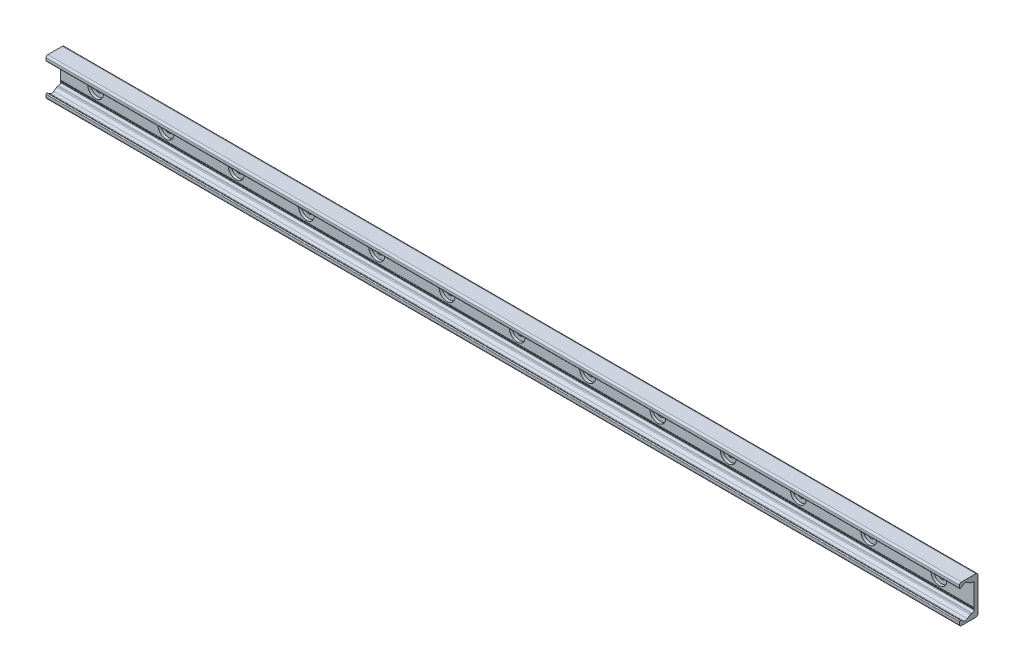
ISO-10303-21;
HEADER;
FILE_DESCRIPTION(('STEP AP214'),'2;1');
FILE_NAME('part.step','',(''),(''),'','','');
FILE_SCHEMA(('AUTOMOTIVE_DESIGN { 1 0 10303 214 1 1 1 1 }'));
ENDSEC;
DATA;
#1=APPLICATION_CONTEXT('core data for automotive mechanical design processes');
#2=APPLICATION_PROTOCOL_DEFINITION('international standard','automotive_design',2000,#1);
#3=PRODUCT_CONTEXT('',#1,'mechanical');
#4=PRODUCT('Part','Part','',(#3));
#5=PRODUCT_RELATED_PRODUCT_CATEGORY('part','',(#4));
#6=PRODUCT_DEFINITION_FORMATION('','',#4);
#7=PRODUCT_DEFINITION_CONTEXT('part definition',#1,'design');
#8=PRODUCT_DEFINITION('design','',#6,#7);
#9=PRODUCT_DEFINITION_SHAPE('','',#8);
#10=(LENGTH_UNIT() NAMED_UNIT(*) SI_UNIT(.MILLI.,.METRE.));
#11=(NAMED_UNIT(*) PLANE_ANGLE_UNIT() SI_UNIT($,.RADIAN.));
#12=(NAMED_UNIT(*) SI_UNIT($,.STERADIAN.) SOLID_ANGLE_UNIT());
#13=UNCERTAINTY_MEASURE_WITH_UNIT(LENGTH_MEASURE(1.E-05),#10,'distance_accuracy_value','');
#14=(GEOMETRIC_REPRESENTATION_CONTEXT(3) GLOBAL_UNCERTAINTY_ASSIGNED_CONTEXT((#13)) GLOBAL_UNIT_ASSIGNED_CONTEXT((#10,
#11,#12)) REPRESENTATION_CONTEXT('',''));
#15=CARTESIAN_POINT('',(0.,0.,0.));
#16=DIRECTION('',(0.,0.,1.));
#17=DIRECTION('',(1.,0.,0.));
#18=AXIS2_PLACEMENT_3D('',#15,#16,#17);
#19=CARTESIAN_POINT('',(-480.,0.,1.39999999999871));
#20=DIRECTION('',(0.,0.,1.));
#21=DIRECTION('',(1.,0.,0.));
#22=AXIS2_PLACEMENT_3D('',#19,#20,#21);
#23=PLANE('',#22);
#24=CARTESIAN_POINT('',(-480.,0.,1.39999999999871));
#25=DIRECTION('',(0.,0.,1.));
#26=DIRECTION('',(1.,0.,0.));
#27=AXIS2_PLACEMENT_3D('',#24,#25,#26);
#28=CIRCLE('',#27,4.50000000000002);
#29=CARTESIAN_POINT('',(-475.5,0.,1.39999999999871));
#30=VERTEX_POINT('',#29);
#31=EDGE_CURVE('E560',#30,#30,#28,.T.);
#32=ORIENTED_EDGE('',*,*,#31,.F.);
#33=EDGE_LOOP('',(#32));
#34=FACE_BOUND('',#33,.T.);
#35=CARTESIAN_POINT('',(-480.,0.,1.39999999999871));
#36=DIRECTION('',(0.,0.,1.));
#37=DIRECTION('',(1.,0.,0.));
#38=AXIS2_PLACEMENT_3D('',#35,#36,#37);
#39=CIRCLE('',#38,8.99999999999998);
#40=CARTESIAN_POINT('',(-471.,0.,1.39999999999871));
#41=VERTEX_POINT('',#40);
#42=EDGE_CURVE('E11',#41,#41,#39,.T.);
#43=ORIENTED_EDGE('',*,*,#42,.T.);
#44=EDGE_LOOP('',(#43));
#45=FACE_BOUND('',#44,.T.);
#46=ADVANCED_FACE('F39',(#34,#45),#23,.T.);
#47=CARTESIAN_POINT('',(-480.,0.,1.39999999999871));
#48=DIRECTION('',(0.,0.,1.));
#49=DIRECTION('',(1.,0.,0.));
#50=AXIS2_PLACEMENT_3D('',#47,#48,#49);
#51=CYLINDRICAL_SURFACE('',#50,8.99999999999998);
#52=CARTESIAN_POINT('',(-480.,0.,4.49999999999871));
#53=DIRECTION('',(0.,0.,1.));
#54=DIRECTION('',(1.,0.,0.));
#55=AXIS2_PLACEMENT_3D('',#52,#53,#54);
#56=CIRCLE('',#55,8.99999999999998);
#57=CARTESIAN_POINT('',(-471.,0.,4.49999999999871));
#58=VERTEX_POINT('',#57);
#59=EDGE_CURVE('E49',#58,#58,#56,.T.);
#60=CARTESIAN_POINT('',(-471.,0.,1.39999999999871));
#61=CARTESIAN_POINT('',(-471.,0.,1.43229166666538));
#62=CARTESIAN_POINT('',(-471.,0.,1.46458333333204));
#63=CARTESIAN_POINT('',(-471.,0.,1.52916666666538));
#64=CARTESIAN_POINT('',(-471.,0.,1.56145833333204));
#65=CARTESIAN_POINT('',(-471.,0.,1.62604166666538));
#66=CARTESIAN_POINT('',(-471.,0.,1.65833333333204));
#67=CARTESIAN_POINT('',(-471.,0.,1.72291666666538));
#68=CARTESIAN_POINT('',(-471.,0.,1.75520833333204));
#69=CARTESIAN_POINT('',(-471.,0.,1.81979166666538));
#70=CARTESIAN_POINT('',(-471.,0.,1.85208333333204));
#71=CARTESIAN_POINT('',(-471.,0.,1.91666666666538));
#72=CARTESIAN_POINT('',(-471.,0.,1.94895833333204));
#73=CARTESIAN_POINT('',(-471.,0.,2.01354166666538));
#74=CARTESIAN_POINT('',(-471.,0.,2.04583333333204));
#75=CARTESIAN_POINT('',(-471.,0.,2.11041666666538));
#76=CARTESIAN_POINT('',(-471.,0.,2.14270833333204));
#77=CARTESIAN_POINT('',(-471.,0.,2.20729166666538));
#78=CARTESIAN_POINT('',(-471.,0.,2.23958333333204));
#79=CARTESIAN_POINT('',(-471.,0.,2.30416666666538));
#80=CARTESIAN_POINT('',(-471.,0.,2.33645833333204));
#81=CARTESIAN_POINT('',(-471.,0.,2.40104166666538));
#82=CARTESIAN_POINT('',(-471.,0.,2.43333333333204));
#83=CARTESIAN_POINT('',(-471.,0.,2.49791666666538));
#84=CARTESIAN_POINT('',(-471.,0.,2.53020833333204));
#85=CARTESIAN_POINT('',(-471.,0.,2.59479166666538));
#86=CARTESIAN_POINT('',(-471.,0.,2.62708333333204));
#87=CARTESIAN_POINT('',(-471.,0.,2.69166666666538));
#88=CARTESIAN_POINT('',(-471.,0.,2.72395833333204));
#89=CARTESIAN_POINT('',(-471.,0.,2.78854166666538));
#90=CARTESIAN_POINT('',(-471.,0.,2.82083333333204));
#91=CARTESIAN_POINT('',(-471.,0.,2.88541666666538));
#92=CARTESIAN_POINT('',(-471.,0.,2.91770833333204));
#93=CARTESIAN_POINT('',(-471.,0.,2.98229166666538));
#94=CARTESIAN_POINT('',(-471.,0.,3.01458333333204));
#95=CARTESIAN_POINT('',(-471.,0.,3.07916666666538));
#96=CARTESIAN_POINT('',(-471.,0.,3.11145833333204));
#97=CARTESIAN_POINT('',(-471.,0.,3.17604166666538));
#98=CARTESIAN_POINT('',(-471.,0.,3.20833333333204));
#99=CARTESIAN_POINT('',(-471.,0.,3.27291666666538));
#100=CARTESIAN_POINT('',(-471.,0.,3.30520833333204));
#101=CARTESIAN_POINT('',(-471.,0.,3.36979166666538));
#102=CARTESIAN_POINT('',(-471.,0.,3.40208333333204));
#103=CARTESIAN_POINT('',(-471.,0.,3.46666666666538));
#104=CARTESIAN_POINT('',(-471.,0.,3.49895833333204));
#105=CARTESIAN_POINT('',(-471.,0.,3.56354166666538));
#106=CARTESIAN_POINT('',(-471.,0.,3.59583333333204));
#107=CARTESIAN_POINT('',(-471.,0.,3.66041666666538));
#108=CARTESIAN_POINT('',(-471.,0.,3.69270833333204));
#109=CARTESIAN_POINT('',(-471.,0.,3.75729166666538));
#110=CARTESIAN_POINT('',(-471.,0.,3.78958333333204));
#111=CARTESIAN_POINT('',(-471.,0.,3.85416666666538));
#112=CARTESIAN_POINT('',(-471.,0.,3.88645833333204));
#113=CARTESIAN_POINT('',(-471.,0.,3.95104166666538));
#114=CARTESIAN_POINT('',(-471.,0.,3.98333333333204));
#115=CARTESIAN_POINT('',(-471.,0.,4.04791666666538));
#116=CARTESIAN_POINT('',(-471.,0.,4.08020833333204));
#117=CARTESIAN_POINT('',(-471.,0.,4.14479166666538));
#118=CARTESIAN_POINT('',(-471.,0.,4.17708333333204));
#119=CARTESIAN_POINT('',(-471.,0.,4.24166666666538));
#120=CARTESIAN_POINT('',(-471.,0.,4.27395833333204));
#121=CARTESIAN_POINT('',(-471.,0.,4.33854166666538));
#122=CARTESIAN_POINT('',(-471.,0.,4.37083333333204));
#123=CARTESIAN_POINT('',(-471.,0.,4.43541666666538));
#124=CARTESIAN_POINT('',(-471.,0.,4.46770833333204));
#125=CARTESIAN_POINT('',(-471.,0.,4.49999999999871));
#126=B_SPLINE_CURVE_WITH_KNOTS('',3,(#60,#61,#62,#63,#64,#65,#66,#67,#68,#69,#70,#71,#72,#73,
#74,#75,#76,#77,#78,#79,#80,#81,#82,#83,#84,#85,#86,#87,#88,#89,#90,#91,#92,#93,#94,#95,#96,#97,
#98,#99,#100,#101,#102,#103,#104,#105,#106,#107,#108,#109,#110,#111,#112,#113,#114,#115,#116,
#117,#118,#119,#120,#121,#122,#123,#124,#125),.UNSPECIFIED.,.F.,.F.,(4,2,2,2,2,2,2,2,2,2,2,2,2,
2,2,2,2,2,2,2,2,2,2,2,2,2,2,2,2,2,2,2,4),(0.,0.0968750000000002,0.19375,0.290625,0.3875,
0.484375,0.58125,0.678125,0.775,0.871875,0.96875,1.065625,1.1625,1.259375,1.35625,1.453125,1.55,
1.646875,1.74375,1.840625,1.9375,2.034375,2.13125,2.228125,2.325,2.421875,2.51875,2.615625,
2.7125,2.809375,2.90625,3.003125,3.1),.UNSPECIFIED.);
#127=EDGE_CURVE('BSEAM530',#41,#58,#126,.T.);
#128=ORIENTED_EDGE('',*,*,#42,.F.);
#129=ORIENTED_EDGE('',*,*,#59,.T.);
#130=ORIENTED_EDGE('',*,*,#127,.T.);
#131=ORIENTED_EDGE('',*,*,#127,.F.);
#132=EDGE_LOOP('',(#128,#130,#129,#131));
#133=FACE_BOUND('',#132,.T.);
#134=ADVANCED_FACE('F530',(#133),#51,.F.);
#135=CARTESIAN_POINT('',(-400.,0.,1.39999999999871));
#136=DIRECTION('',(0.,0.,1.));
#137=DIRECTION('',(1.,0.,0.));
#138=AXIS2_PLACEMENT_3D('',#135,#136,#137);
#139=PLANE('',#138);
#140=CARTESIAN_POINT('',(-400.,0.,1.39999999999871));
#141=DIRECTION('',(0.,0.,1.));
#142=DIRECTION('',(1.,0.,0.));
#143=AXIS2_PLACEMENT_3D('',#140,#141,#142);
#144=CIRCLE('',#143,4.50000000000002);
#145=CARTESIAN_POINT('',(-395.5,0.,1.39999999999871));
#146=VERTEX_POINT('',#145);
#147=EDGE_CURVE('E564',#146,#146,#144,.T.);
#148=ORIENTED_EDGE('',*,*,#147,.F.);
#149=EDGE_LOOP('',(#148));
#150=FACE_BOUND('',#149,.T.);
#151=CARTESIAN_POINT('',(-400.,0.,1.39999999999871));
#152=DIRECTION('',(0.,0.,1.));
#153=DIRECTION('',(1.,0.,0.));
#154=AXIS2_PLACEMENT_3D('',#151,#152,#153);
#155=CIRCLE('',#154,8.99999999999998);
#156=CARTESIAN_POINT('',(-391.,0.,1.39999999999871));
#157=VERTEX_POINT('',#156);
#158=EDGE_CURVE('E522',#157,#157,#155,.T.);
#159=ORIENTED_EDGE('',*,*,#158,.T.);
#160=EDGE_LOOP('',(#159));
#161=FACE_BOUND('',#160,.T.);
#162=ADVANCED_FACE('F555',(#150,#161),#139,.T.);
#163=CARTESIAN_POINT('',(-400.,0.,1.39999999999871));
#164=DIRECTION('',(0.,0.,1.));
#165=DIRECTION('',(1.,0.,0.));
#166=AXIS2_PLACEMENT_3D('',#163,#164,#165);
#167=CYLINDRICAL_SURFACE('',#166,8.99999999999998);
#168=CARTESIAN_POINT('',(-400.,0.,4.49999999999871));
#169=DIRECTION('',(0.,0.,1.));
#170=DIRECTION('',(1.,0.,0.));
#171=AXIS2_PLACEMENT_3D('',#168,#169,#170);
#172=CIRCLE('',#171,8.99999999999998);
#173=CARTESIAN_POINT('',(-391.,0.,4.49999999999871));
#174=VERTEX_POINT('',#173);
#175=EDGE_CURVE('E518',#174,#174,#172,.T.);
#176=CARTESIAN_POINT('',(-391.,0.,1.39999999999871));
#177=CARTESIAN_POINT('',(-391.,0.,1.43229166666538));
#178=CARTESIAN_POINT('',(-391.,0.,1.46458333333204));
#179=CARTESIAN_POINT('',(-391.,0.,1.52916666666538));
#180=CARTESIAN_POINT('',(-391.,0.,1.56145833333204));
#181=CARTESIAN_POINT('',(-391.,0.,1.62604166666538));
#182=CARTESIAN_POINT('',(-391.,0.,1.65833333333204));
#183=CARTESIAN_POINT('',(-391.,0.,1.72291666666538));
#184=CARTESIAN_POINT('',(-391.,0.,1.75520833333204));
#185=CARTESIAN_POINT('',(-391.,0.,1.81979166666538));
#186=CARTESIAN_POINT('',(-391.,0.,1.85208333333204));
#187=CARTESIAN_POINT('',(-391.,0.,1.91666666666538));
#188=CARTESIAN_POINT('',(-391.,0.,1.94895833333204));
#189=CARTESIAN_POINT('',(-391.,0.,2.01354166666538));
#190=CARTESIAN_POINT('',(-391.,0.,2.04583333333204));
#191=CARTESIAN_POINT('',(-391.,0.,2.11041666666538));
#192=CARTESIAN_POINT('',(-391.,0.,2.14270833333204));
#193=CARTESIAN_POINT('',(-391.,0.,2.20729166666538));
#194=CARTESIAN_POINT('',(-391.,0.,2.23958333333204));
#195=CARTESIAN_POINT('',(-391.,0.,2.30416666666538));
#196=CARTESIAN_POINT('',(-391.,0.,2.33645833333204));
#197=CARTESIAN_POINT('',(-391.,0.,2.40104166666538));
#198=CARTESIAN_POINT('',(-391.,0.,2.43333333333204));
#199=CARTESIAN_POINT('',(-391.,0.,2.49791666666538));
#200=CARTESIAN_POINT('',(-391.,0.,2.53020833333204));
#201=CARTESIAN_POINT('',(-391.,0.,2.59479166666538));
#202=CARTESIAN_POINT('',(-391.,0.,2.62708333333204));
#203=CARTESIAN_POINT('',(-391.,0.,2.69166666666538));
#204=CARTESIAN_POINT('',(-391.,0.,2.72395833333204));
#205=CARTESIAN_POINT('',(-391.,0.,2.78854166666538));
#206=CARTESIAN_POINT('',(-391.,0.,2.82083333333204));
#207=CARTESIAN_POINT('',(-391.,0.,2.88541666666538));
#208=CARTESIAN_POINT('',(-391.,0.,2.91770833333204));
#209=CARTESIAN_POINT('',(-391.,0.,2.98229166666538));
#210=CARTESIAN_POINT('',(-391.,0.,3.01458333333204));
#211=CARTESIAN_POINT('',(-391.,0.,3.07916666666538));
#212=CARTESIAN_POINT('',(-391.,0.,3.11145833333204));
#213=CARTESIAN_POINT('',(-391.,0.,3.17604166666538));
#214=CARTESIAN_POINT('',(-391.,0.,3.20833333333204));
#215=CARTESIAN_POINT('',(-391.,0.,3.27291666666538));
#216=CARTESIAN_POINT('',(-391.,0.,3.30520833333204));
#217=CARTESIAN_POINT('',(-391.,0.,3.36979166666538));
#218=CARTESIAN_POINT('',(-391.,0.,3.40208333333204));
#219=CARTESIAN_POINT('',(-391.,0.,3.46666666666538));
#220=CARTESIAN_POINT('',(-391.,0.,3.49895833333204));
#221=CARTESIAN_POINT('',(-391.,0.,3.56354166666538));
#222=CARTESIAN_POINT('',(-391.,0.,3.59583333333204));
#223=CARTESIAN_POINT('',(-391.,0.,3.66041666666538));
#224=CARTESIAN_POINT('',(-391.,0.,3.69270833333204));
#225=CARTESIAN_POINT('',(-391.,0.,3.75729166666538));
#226=CARTESIAN_POINT('',(-391.,0.,3.78958333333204));
#227=CARTESIAN_POINT('',(-391.,0.,3.85416666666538));
#228=CARTESIAN_POINT('',(-391.,0.,3.88645833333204));
#229=CARTESIAN_POINT('',(-391.,0.,3.95104166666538));
#230=CARTESIAN_POINT('',(-391.,0.,3.98333333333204));
#231=CARTESIAN_POINT('',(-391.,0.,4.04791666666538));
#232=CARTESIAN_POINT('',(-391.,0.,4.08020833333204));
#233=CARTESIAN_POINT('',(-391.,0.,4.14479166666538));
#234=CARTESIAN_POINT('',(-391.,0.,4.17708333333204));
#235=CARTESIAN_POINT('',(-391.,0.,4.24166666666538));
#236=CARTESIAN_POINT('',(-391.,0.,4.27395833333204));
#237=CARTESIAN_POINT('',(-391.,0.,4.33854166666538));
#238=CARTESIAN_POINT('',(-391.,0.,4.37083333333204));
#239=CARTESIAN_POINT('',(-391.,0.,4.43541666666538));
#240=CARTESIAN_POINT('',(-391.,0.,4.46770833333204));
#241=CARTESIAN_POINT('',(-391.,0.,4.49999999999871));
#242=B_SPLINE_CURVE_WITH_KNOTS('',3,(#176,#177,#178,#179,#180,#181,#182,#183,#184,#185,#186,
#187,#188,#189,#190,#191,#192,#193,#194,#195,#196,#197,#198,#199,#200,#201,#202,#203,#204,#205,
#206,#207,#208,#209,#210,#211,#212,#213,#214,#215,#216,#217,#218,#219,#220,#221,#222,#223,#224,
#225,#226,#227,#228,#229,#230,#231,#232,#233,#234,#235,#236,#237,#238,#239,#240,#241),
.UNSPECIFIED.,.F.,.F.,(4,2,2,2,2,2,2,2,2,2,2,2,2,2,2,2,2,2,2,2,2,2,2,2,2,2,2,2,2,2,2,2,4),(0.,
0.0968750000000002,0.19375,0.290625,0.3875,0.484375,0.58125,0.678125,0.775,0.871875,0.96875,
1.065625,1.1625,1.259375,1.35625,1.453125,1.55,1.646875,1.74375,1.840625,1.9375,2.034375,
2.13125,2.228125,2.325,2.421875,2.51875,2.615625,2.7125,2.809375,2.90625,3.003125,3.1),.UNSPECIFIED.);
#243=EDGE_CURVE('BSEAM1035',#157,#174,#242,.T.);
#244=ORIENTED_EDGE('',*,*,#158,.F.);
#245=ORIENTED_EDGE('',*,*,#175,.T.);
#246=ORIENTED_EDGE('',*,*,#243,.T.);
#247=ORIENTED_EDGE('',*,*,#243,.F.);
#248=EDGE_LOOP('',(#244,#246,#245,#247));
#249=FACE_BOUND('',#248,.T.);
#250=ADVANCED_FACE('F1035',(#249),#167,.F.);
#251=CARTESIAN_POINT('',(-320.,0.,1.39999999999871));
#252=DIRECTION('',(0.,0.,1.));
#253=DIRECTION('',(1.,0.,0.));
#254=AXIS2_PLACEMENT_3D('',#251,#252,#253);
#255=PLANE('',#254);
#256=CARTESIAN_POINT('',(-320.,0.,1.39999999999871));
#257=DIRECTION('',(0.,0.,1.));
#258=DIRECTION('',(1.,0.,0.));
#259=AXIS2_PLACEMENT_3D('',#256,#257,#258);
#260=CIRCLE('',#259,4.50000000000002);
#261=CARTESIAN_POINT('',(-315.5,0.,1.39999999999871));
#262=VERTEX_POINT('',#261);
#263=EDGE_CURVE('E569',#262,#262,#260,.T.);
#264=ORIENTED_EDGE('',*,*,#263,.F.);
#265=EDGE_LOOP('',(#264));
#266=FACE_BOUND('',#265,.T.);
#267=CARTESIAN_POINT('',(-320.,0.,1.39999999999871));
#268=DIRECTION('',(0.,0.,1.));
#269=DIRECTION('',(1.,0.,0.));
#270=AXIS2_PLACEMENT_3D('',#267,#268,#269);
#271=CIRCLE('',#270,8.99999999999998);
#272=CARTESIAN_POINT('',(-311.,0.,1.39999999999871));
#273=VERTEX_POINT('',#272);
#274=EDGE_CURVE('E514',#273,#273,#271,.T.);
#275=ORIENTED_EDGE('',*,*,#274,.T.);
#276=EDGE_LOOP('',(#275));
#277=FACE_BOUND('',#276,.T.);
#278=ADVANCED_FACE('F1031',(#266,#277),#255,.T.);
#279=CARTESIAN_POINT('',(-320.,0.,1.39999999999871));
#280=DIRECTION('',(0.,0.,1.));
#281=DIRECTION('',(1.,0.,0.));
#282=AXIS2_PLACEMENT_3D('',#279,#280,#281);
#283=CYLINDRICAL_SURFACE('',#282,8.99999999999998);
#284=CARTESIAN_POINT('',(-320.,0.,4.49999999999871));
#285=DIRECTION('',(0.,0.,1.));
#286=DIRECTION('',(1.,0.,0.));
#287=AXIS2_PLACEMENT_3D('',#284,#285,#286);
#288=CIRCLE('',#287,8.99999999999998);
#289=CARTESIAN_POINT('',(-311.,0.,4.49999999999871));
#290=VERTEX_POINT('',#289);
#291=EDGE_CURVE('E510',#290,#290,#288,.T.);
#292=CARTESIAN_POINT('',(-311.,0.,1.39999999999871));
#293=CARTESIAN_POINT('',(-311.,0.,1.43229166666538));
#294=CARTESIAN_POINT('',(-311.,0.,1.46458333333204));
#295=CARTESIAN_POINT('',(-311.,0.,1.52916666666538));
#296=CARTESIAN_POINT('',(-311.,0.,1.56145833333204));
#297=CARTESIAN_POINT('',(-311.,0.,1.62604166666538));
#298=CARTESIAN_POINT('',(-311.,0.,1.65833333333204));
#299=CARTESIAN_POINT('',(-311.,0.,1.72291666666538));
#300=CARTESIAN_POINT('',(-311.,0.,1.75520833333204));
#301=CARTESIAN_POINT('',(-311.,0.,1.81979166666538));
#302=CARTESIAN_POINT('',(-311.,0.,1.85208333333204));
#303=CARTESIAN_POINT('',(-311.,0.,1.91666666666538));
#304=CARTESIAN_POINT('',(-311.,0.,1.94895833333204));
#305=CARTESIAN_POINT('',(-311.,0.,2.01354166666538));
#306=CARTESIAN_POINT('',(-311.,0.,2.04583333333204));
#307=CARTESIAN_POINT('',(-311.,0.,2.11041666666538));
#308=CARTESIAN_POINT('',(-311.,0.,2.14270833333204));
#309=CARTESIAN_POINT('',(-311.,0.,2.20729166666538));
#310=CARTESIAN_POINT('',(-311.,0.,2.23958333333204));
#311=CARTESIAN_POINT('',(-311.,0.,2.30416666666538));
#312=CARTESIAN_POINT('',(-311.,0.,2.33645833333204));
#313=CARTESIAN_POINT('',(-311.,0.,2.40104166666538));
#314=CARTESIAN_POINT('',(-311.,0.,2.43333333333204));
#315=CARTESIAN_POINT('',(-311.,0.,2.49791666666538));
#316=CARTESIAN_POINT('',(-311.,0.,2.53020833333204));
#317=CARTESIAN_POINT('',(-311.,0.,2.59479166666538));
#318=CARTESIAN_POINT('',(-311.,0.,2.62708333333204));
#319=CARTESIAN_POINT('',(-311.,0.,2.69166666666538));
#320=CARTESIAN_POINT('',(-311.,0.,2.72395833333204));
#321=CARTESIAN_POINT('',(-311.,0.,2.78854166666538));
#322=CARTESIAN_POINT('',(-311.,0.,2.82083333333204));
#323=CARTESIAN_POINT('',(-311.,0.,2.88541666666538));
#324=CARTESIAN_POINT('',(-311.,0.,2.91770833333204));
#325=CARTESIAN_POINT('',(-311.,0.,2.98229166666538));
#326=CARTESIAN_POINT('',(-311.,0.,3.01458333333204));
#327=CARTESIAN_POINT('',(-311.,0.,3.07916666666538));
#328=CARTESIAN_POINT('',(-311.,0.,3.11145833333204));
#329=CARTESIAN_POINT('',(-311.,0.,3.17604166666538));
#330=CARTESIAN_POINT('',(-311.,0.,3.20833333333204));
#331=CARTESIAN_POINT('',(-311.,0.,3.27291666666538));
#332=CARTESIAN_POINT('',(-311.,0.,3.30520833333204));
#333=CARTESIAN_POINT('',(-311.,0.,3.36979166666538));
#334=CARTESIAN_POINT('',(-311.,0.,3.40208333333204));
#335=CARTESIAN_POINT('',(-311.,0.,3.46666666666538));
#336=CARTESIAN_POINT('',(-311.,0.,3.49895833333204));
#337=CARTESIAN_POINT('',(-311.,0.,3.56354166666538));
#338=CARTESIAN_POINT('',(-311.,0.,3.59583333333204));
#339=CARTESIAN_POINT('',(-311.,0.,3.66041666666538));
#340=CARTESIAN_POINT('',(-311.,0.,3.69270833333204));
#341=CARTESIAN_POINT('',(-311.,0.,3.75729166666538));
#342=CARTESIAN_POINT('',(-311.,0.,3.78958333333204));
#343=CARTESIAN_POINT('',(-311.,0.,3.85416666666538));
#344=CARTESIAN_POINT('',(-311.,0.,3.88645833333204));
#345=CARTESIAN_POINT('',(-311.,0.,3.95104166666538));
#346=CARTESIAN_POINT('',(-311.,0.,3.98333333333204));
#347=CARTESIAN_POINT('',(-311.,0.,4.04791666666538));
#348=CARTESIAN_POINT('',(-311.,0.,4.08020833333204));
#349=CARTESIAN_POINT('',(-311.,0.,4.14479166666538));
#350=CARTESIAN_POINT('',(-311.,0.,4.17708333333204));
#351=CARTESIAN_POINT('',(-311.,0.,4.24166666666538));
#352=CARTESIAN_POINT('',(-311.,0.,4.27395833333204));
#353=CARTESIAN_POINT('',(-311.,0.,4.33854166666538));
#354=CARTESIAN_POINT('',(-311.,0.,4.37083333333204));
#355=CARTESIAN_POINT('',(-311.,0.,4.43541666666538));
#356=CARTESIAN_POINT('',(-311.,0.,4.46770833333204));
#357=CARTESIAN_POINT('',(-311.,0.,4.49999999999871));
#358=B_SPLINE_CURVE_WITH_KNOTS('',3,(#292,#293,#294,#295,#296,#297,#298,#299,#300,#301,#302,
#303,#304,#305,#306,#307,#308,#309,#310,#311,#312,#313,#314,#315,#316,#317,#318,#319,#320,#321,
#322,#323,#324,#325,#326,#327,#328,#329,#330,#331,#332,#333,#334,#335,#336,#337,#338,#339,#340,
#341,#342,#343,#344,#345,#346,#347,#348,#349,#350,#351,#352,#353,#354,#355,#356,#357),
.UNSPECIFIED.,.F.,.F.,(4,2,2,2,2,2,2,2,2,2,2,2,2,2,2,2,2,2,2,2,2,2,2,2,2,2,2,2,2,2,2,2,4),(0.,
0.0968750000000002,0.19375,0.290625,0.3875,0.484375,0.58125,0.678125,0.775,0.871875,0.96875,
1.065625,1.1625,1.259375,1.35625,1.453125,1.55,1.646875,1.74375,1.840625,1.9375,2.034375,
2.13125,2.228125,2.325,2.421875,2.51875,2.615625,2.7125,2.809375,2.90625,3.003125,3.1),.UNSPECIFIED.);
#359=EDGE_CURVE('BSEAM1027',#273,#290,#358,.T.);
#360=ORIENTED_EDGE('',*,*,#274,.F.);
#361=ORIENTED_EDGE('',*,*,#291,.T.);
#362=ORIENTED_EDGE('',*,*,#359,.T.);
#363=ORIENTED_EDGE('',*,*,#359,.F.);
#364=EDGE_LOOP('',(#360,#362,#361,#363));
#365=FACE_BOUND('',#364,.T.);
#366=ADVANCED_FACE('F1027',(#365),#283,.F.);
#367=CARTESIAN_POINT('',(-240.,0.,1.39999999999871));
#368=DIRECTION('',(0.,0.,1.));
#369=DIRECTION('',(1.,0.,0.));
#370=AXIS2_PLACEMENT_3D('',#367,#368,#369);
#371=PLANE('',#370);
#372=CARTESIAN_POINT('',(-240.,0.,1.39999999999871));
#373=DIRECTION('',(0.,0.,1.));
#374=DIRECTION('',(1.,0.,0.));
#375=AXIS2_PLACEMENT_3D('',#372,#373,#374);
#376=CIRCLE('',#375,4.50000000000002);
#377=CARTESIAN_POINT('',(-235.5,0.,1.39999999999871));
#378=VERTEX_POINT('',#377);
#379=EDGE_CURVE('E581',#378,#378,#376,.T.);
#380=ORIENTED_EDGE('',*,*,#379,.F.);
#381=EDGE_LOOP('',(#380));
#382=FACE_BOUND('',#381,.T.);
#383=CARTESIAN_POINT('',(-240.,0.,1.39999999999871));
#384=DIRECTION('',(0.,0.,1.));
#385=DIRECTION('',(1.,0.,0.));
#386=AXIS2_PLACEMENT_3D('',#383,#384,#385);
#387=CIRCLE('',#386,8.99999999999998);
#388=CARTESIAN_POINT('',(-231.,0.,1.39999999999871));
#389=VERTEX_POINT('',#388);
#390=EDGE_CURVE('E507',#389,#389,#387,.T.);
#391=ORIENTED_EDGE('',*,*,#390,.T.);
#392=EDGE_LOOP('',(#391));
#393=FACE_BOUND('',#392,.T.);
#394=ADVANCED_FACE('F1023',(#382,#393),#371,.T.);
#395=CARTESIAN_POINT('',(-240.,0.,1.39999999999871));
#396=DIRECTION('',(0.,0.,1.));
#397=DIRECTION('',(1.,0.,0.));
#398=AXIS2_PLACEMENT_3D('',#395,#396,#397);
#399=CYLINDRICAL_SURFACE('',#398,8.99999999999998);
#400=CARTESIAN_POINT('',(-240.,0.,4.49999999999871));
#401=DIRECTION('',(0.,0.,1.));
#402=DIRECTION('',(1.,0.,0.));
#403=AXIS2_PLACEMENT_3D('',#400,#401,#402);
#404=CIRCLE('',#403,8.99999999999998);
#405=CARTESIAN_POINT('',(-231.,0.,4.49999999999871));
#406=VERTEX_POINT('',#405);
#407=EDGE_CURVE('E503',#406,#406,#404,.T.);
#408=CARTESIAN_POINT('',(-231.,0.,1.39999999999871));
#409=CARTESIAN_POINT('',(-231.,0.,1.43229166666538));
#410=CARTESIAN_POINT('',(-231.,0.,1.46458333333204));
#411=CARTESIAN_POINT('',(-231.,0.,1.52916666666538));
#412=CARTESIAN_POINT('',(-231.,0.,1.56145833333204));
#413=CARTESIAN_POINT('',(-231.,0.,1.62604166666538));
#414=CARTESIAN_POINT('',(-231.,0.,1.65833333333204));
#415=CARTESIAN_POINT('',(-231.,0.,1.72291666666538));
#416=CARTESIAN_POINT('',(-231.,0.,1.75520833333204));
#417=CARTESIAN_POINT('',(-231.,0.,1.81979166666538));
#418=CARTESIAN_POINT('',(-231.,0.,1.85208333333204));
#419=CARTESIAN_POINT('',(-231.,0.,1.91666666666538));
#420=CARTESIAN_POINT('',(-231.,0.,1.94895833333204));
#421=CARTESIAN_POINT('',(-231.,0.,2.01354166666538));
#422=CARTESIAN_POINT('',(-231.,0.,2.04583333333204));
#423=CARTESIAN_POINT('',(-231.,0.,2.11041666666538));
#424=CARTESIAN_POINT('',(-231.,0.,2.14270833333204));
#425=CARTESIAN_POINT('',(-231.,0.,2.20729166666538));
#426=CARTESIAN_POINT('',(-231.,0.,2.23958333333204));
#427=CARTESIAN_POINT('',(-231.,0.,2.30416666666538));
#428=CARTESIAN_POINT('',(-231.,0.,2.33645833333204));
#429=CARTESIAN_POINT('',(-231.,0.,2.40104166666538));
#430=CARTESIAN_POINT('',(-231.,0.,2.43333333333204));
#431=CARTESIAN_POINT('',(-231.,0.,2.49791666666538));
#432=CARTESIAN_POINT('',(-231.,0.,2.53020833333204));
#433=CARTESIAN_POINT('',(-231.,0.,2.59479166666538));
#434=CARTESIAN_POINT('',(-231.,0.,2.62708333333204));
#435=CARTESIAN_POINT('',(-231.,0.,2.69166666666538));
#436=CARTESIAN_POINT('',(-231.,0.,2.72395833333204));
#437=CARTESIAN_POINT('',(-231.,0.,2.78854166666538));
#438=CARTESIAN_POINT('',(-231.,0.,2.82083333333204));
#439=CARTESIAN_POINT('',(-231.,0.,2.88541666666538));
#440=CARTESIAN_POINT('',(-231.,0.,2.91770833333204));
#441=CARTESIAN_POINT('',(-231.,0.,2.98229166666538));
#442=CARTESIAN_POINT('',(-231.,0.,3.01458333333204));
#443=CARTESIAN_POINT('',(-231.,0.,3.07916666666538));
#444=CARTESIAN_POINT('',(-231.,0.,3.11145833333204));
#445=CARTESIAN_POINT('',(-231.,0.,3.17604166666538));
#446=CARTESIAN_POINT('',(-231.,0.,3.20833333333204));
#447=CARTESIAN_POINT('',(-231.,0.,3.27291666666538));
#448=CARTESIAN_POINT('',(-231.,0.,3.30520833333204));
#449=CARTESIAN_POINT('',(-231.,0.,3.36979166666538));
#450=CARTESIAN_POINT('',(-231.,0.,3.40208333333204));
#451=CARTESIAN_POINT('',(-231.,0.,3.46666666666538));
#452=CARTESIAN_POINT('',(-231.,0.,3.49895833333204));
#453=CARTESIAN_POINT('',(-231.,0.,3.56354166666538));
#454=CARTESIAN_POINT('',(-231.,0.,3.59583333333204));
#455=CARTESIAN_POINT('',(-231.,0.,3.66041666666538));
#456=CARTESIAN_POINT('',(-231.,0.,3.69270833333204));
#457=CARTESIAN_POINT('',(-231.,0.,3.75729166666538));
#458=CARTESIAN_POINT('',(-231.,0.,3.78958333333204));
#459=CARTESIAN_POINT('',(-231.,0.,3.85416666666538));
#460=CARTESIAN_POINT('',(-231.,0.,3.88645833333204));
#461=CARTESIAN_POINT('',(-231.,0.,3.95104166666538));
#462=CARTESIAN_POINT('',(-231.,0.,3.98333333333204));
#463=CARTESIAN_POINT('',(-231.,0.,4.04791666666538));
#464=CARTESIAN_POINT('',(-231.,0.,4.08020833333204));
#465=CARTESIAN_POINT('',(-231.,0.,4.14479166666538));
#466=CARTESIAN_POINT('',(-231.,0.,4.17708333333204));
#467=CARTESIAN_POINT('',(-231.,0.,4.24166666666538));
#468=CARTESIAN_POINT('',(-231.,0.,4.27395833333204));
#469=CARTESIAN_POINT('',(-231.,0.,4.33854166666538));
#470=CARTESIAN_POINT('',(-231.,0.,4.37083333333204));
#471=CARTESIAN_POINT('',(-231.,0.,4.43541666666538));
#472=CARTESIAN_POINT('',(-231.,0.,4.46770833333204));
#473=CARTESIAN_POINT('',(-231.,0.,4.49999999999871));
#474=B_SPLINE_CURVE_WITH_KNOTS('',3,(#408,#409,#410,#411,#412,#413,#414,#415,#416,#417,#418,
#419,#420,#421,#422,#423,#424,#425,#426,#427,#428,#429,#430,#431,#432,#433,#434,#435,#436,#437,
#438,#439,#440,#441,#442,#443,#444,#445,#446,#447,#448,#449,#450,#451,#452,#453,#454,#455,#456,
#457,#458,#459,#460,#461,#462,#463,#464,#465,#466,#467,#468,#469,#470,#471,#472,#473),
.UNSPECIFIED.,.F.,.F.,(4,2,2,2,2,2,2,2,2,2,2,2,2,2,2,2,2,2,2,2,2,2,2,2,2,2,2,2,2,2,2,2,4),(0.,
0.0968750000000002,0.19375,0.290625,0.3875,0.484375,0.58125,0.678125,0.775,0.871875,0.96875,
1.065625,1.1625,1.259375,1.35625,1.453125,1.55,1.646875,1.74375,1.840625,1.9375,2.034375,
2.13125,2.228125,2.325,2.421875,2.51875,2.615625,2.7125,2.809375,2.90625,3.003125,3.1),.UNSPECIFIED.);
#475=EDGE_CURVE('BSEAM1019',#389,#406,#474,.T.);
#476=ORIENTED_EDGE('',*,*,#390,.F.);
#477=ORIENTED_EDGE('',*,*,#407,.T.);
#478=ORIENTED_EDGE('',*,*,#475,.T.);
#479=ORIENTED_EDGE('',*,*,#475,.F.);
#480=EDGE_LOOP('',(#476,#478,#477,#479));
#481=FACE_BOUND('',#480,.T.);
#482=ADVANCED_FACE('F1019',(#481),#399,.F.);
#483=CARTESIAN_POINT('',(-160.,0.,1.39999999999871));
#484=DIRECTION('',(0.,0.,1.));
#485=DIRECTION('',(1.,0.,0.));
#486=AXIS2_PLACEMENT_3D('',#483,#484,#485);
#487=PLANE('',#486);
#488=CARTESIAN_POINT('',(-160.,0.,1.39999999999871));
#489=DIRECTION('',(0.,0.,1.));
#490=DIRECTION('',(1.,0.,0.));
#491=AXIS2_PLACEMENT_3D('',#488,#489,#490);
#492=CIRCLE('',#491,4.50000000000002);
#493=CARTESIAN_POINT('',(-155.5,0.,1.39999999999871));
#494=VERTEX_POINT('',#493);
#495=EDGE_CURVE('E585',#494,#494,#492,.T.);
#496=ORIENTED_EDGE('',*,*,#495,.F.);
#497=EDGE_LOOP('',(#496));
#498=FACE_BOUND('',#497,.T.);
#499=CARTESIAN_POINT('',(-160.,0.,1.39999999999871));
#500=DIRECTION('',(0.,0.,1.));
#501=DIRECTION('',(1.,0.,0.));
#502=AXIS2_PLACEMENT_3D('',#499,#500,#501);
#503=CIRCLE('',#502,8.99999999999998);
#504=CARTESIAN_POINT('',(-151.,0.,1.39999999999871));
#505=VERTEX_POINT('',#504);
#506=EDGE_CURVE('E499',#505,#505,#503,.T.);
#507=ORIENTED_EDGE('',*,*,#506,.T.);
#508=EDGE_LOOP('',(#507));
#509=FACE_BOUND('',#508,.T.);
#510=ADVANCED_FACE('F1015',(#498,#509),#487,.T.);
#511=CARTESIAN_POINT('',(-160.,0.,1.39999999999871));
#512=DIRECTION('',(0.,0.,1.));
#513=DIRECTION('',(1.,0.,0.));
#514=AXIS2_PLACEMENT_3D('',#511,#512,#513);
#515=CYLINDRICAL_SURFACE('',#514,8.99999999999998);
#516=CARTESIAN_POINT('',(-160.,0.,4.49999999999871));
#517=DIRECTION('',(0.,0.,1.));
#518=DIRECTION('',(1.,0.,0.));
#519=AXIS2_PLACEMENT_3D('',#516,#517,#518);
#520=CIRCLE('',#519,8.99999999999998);
#521=CARTESIAN_POINT('',(-151.,0.,4.49999999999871));
#522=VERTEX_POINT('',#521);
#523=EDGE_CURVE('E495',#522,#522,#520,.T.);
#524=CARTESIAN_POINT('',(-151.,0.,1.39999999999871));
#525=CARTESIAN_POINT('',(-151.,0.,1.43229166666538));
#526=CARTESIAN_POINT('',(-151.,0.,1.46458333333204));
#527=CARTESIAN_POINT('',(-151.,0.,1.52916666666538));
#528=CARTESIAN_POINT('',(-151.,0.,1.56145833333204));
#529=CARTESIAN_POINT('',(-151.,0.,1.62604166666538));
#530=CARTESIAN_POINT('',(-151.,0.,1.65833333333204));
#531=CARTESIAN_POINT('',(-151.,0.,1.72291666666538));
#532=CARTESIAN_POINT('',(-151.,0.,1.75520833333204));
#533=CARTESIAN_POINT('',(-151.,0.,1.81979166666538));
#534=CARTESIAN_POINT('',(-151.,0.,1.85208333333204));
#535=CARTESIAN_POINT('',(-151.,0.,1.91666666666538));
#536=CARTESIAN_POINT('',(-151.,0.,1.94895833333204));
#537=CARTESIAN_POINT('',(-151.,0.,2.01354166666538));
#538=CARTESIAN_POINT('',(-151.,0.,2.04583333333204));
#539=CARTESIAN_POINT('',(-151.,0.,2.11041666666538));
#540=CARTESIAN_POINT('',(-151.,0.,2.14270833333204));
#541=CARTESIAN_POINT('',(-151.,0.,2.20729166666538));
#542=CARTESIAN_POINT('',(-151.,0.,2.23958333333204));
#543=CARTESIAN_POINT('',(-151.,0.,2.30416666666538));
#544=CARTESIAN_POINT('',(-151.,0.,2.33645833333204));
#545=CARTESIAN_POINT('',(-151.,0.,2.40104166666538));
#546=CARTESIAN_POINT('',(-151.,0.,2.43333333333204));
#547=CARTESIAN_POINT('',(-151.,0.,2.49791666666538));
#548=CARTESIAN_POINT('',(-151.,0.,2.53020833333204));
#549=CARTESIAN_POINT('',(-151.,0.,2.59479166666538));
#550=CARTESIAN_POINT('',(-151.,0.,2.62708333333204));
#551=CARTESIAN_POINT('',(-151.,0.,2.69166666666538));
#552=CARTESIAN_POINT('',(-151.,0.,2.72395833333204));
#553=CARTESIAN_POINT('',(-151.,0.,2.78854166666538));
#554=CARTESIAN_POINT('',(-151.,0.,2.82083333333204));
#555=CARTESIAN_POINT('',(-151.,0.,2.88541666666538));
#556=CARTESIAN_POINT('',(-151.,0.,2.91770833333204));
#557=CARTESIAN_POINT('',(-151.,0.,2.98229166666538));
#558=CARTESIAN_POINT('',(-151.,0.,3.01458333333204));
#559=CARTESIAN_POINT('',(-151.,0.,3.07916666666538));
#560=CARTESIAN_POINT('',(-151.,0.,3.11145833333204));
#561=CARTESIAN_POINT('',(-151.,0.,3.17604166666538));
#562=CARTESIAN_POINT('',(-151.,0.,3.20833333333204));
#563=CARTESIAN_POINT('',(-151.,0.,3.27291666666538));
#564=CARTESIAN_POINT('',(-151.,0.,3.30520833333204));
#565=CARTESIAN_POINT('',(-151.,0.,3.36979166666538));
#566=CARTESIAN_POINT('',(-151.,0.,3.40208333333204));
#567=CARTESIAN_POINT('',(-151.,0.,3.46666666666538));
#568=CARTESIAN_POINT('',(-151.,0.,3.49895833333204));
#569=CARTESIAN_POINT('',(-151.,0.,3.56354166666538));
#570=CARTESIAN_POINT('',(-151.,0.,3.59583333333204));
#571=CARTESIAN_POINT('',(-151.,0.,3.66041666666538));
#572=CARTESIAN_POINT('',(-151.,0.,3.69270833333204));
#573=CARTESIAN_POINT('',(-151.,0.,3.75729166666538));
#574=CARTESIAN_POINT('',(-151.,0.,3.78958333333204));
#575=CARTESIAN_POINT('',(-151.,0.,3.85416666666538));
#576=CARTESIAN_POINT('',(-151.,0.,3.88645833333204));
#577=CARTESIAN_POINT('',(-151.,0.,3.95104166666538));
#578=CARTESIAN_POINT('',(-151.,0.,3.98333333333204));
#579=CARTESIAN_POINT('',(-151.,0.,4.04791666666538));
#580=CARTESIAN_POINT('',(-151.,0.,4.08020833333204));
#581=CARTESIAN_POINT('',(-151.,0.,4.14479166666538));
#582=CARTESIAN_POINT('',(-151.,0.,4.17708333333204));
#583=CARTESIAN_POINT('',(-151.,0.,4.24166666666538));
#584=CARTESIAN_POINT('',(-151.,0.,4.27395833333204));
#585=CARTESIAN_POINT('',(-151.,0.,4.33854166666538));
#586=CARTESIAN_POINT('',(-151.,0.,4.37083333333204));
#587=CARTESIAN_POINT('',(-151.,0.,4.43541666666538));
#588=CARTESIAN_POINT('',(-151.,0.,4.46770833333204));
#589=CARTESIAN_POINT('',(-151.,0.,4.49999999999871));
#590=B_SPLINE_CURVE_WITH_KNOTS('',3,(#524,#525,#526,#527,#528,#529,#530,#531,#532,#533,#534,
#535,#536,#537,#538,#539,#540,#541,#542,#543,#544,#545,#546,#547,#548,#549,#550,#551,#552,#553,
#554,#555,#556,#557,#558,#559,#560,#561,#562,#563,#564,#565,#566,#567,#568,#569,#570,#571,#572,
#573,#574,#575,#576,#577,#578,#579,#580,#581,#582,#583,#584,#585,#586,#587,#588,#589),
.UNSPECIFIED.,.F.,.F.,(4,2,2,2,2,2,2,2,2,2,2,2,2,2,2,2,2,2,2,2,2,2,2,2,2,2,2,2,2,2,2,2,4),(0.,
0.0968750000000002,0.19375,0.290625,0.3875,0.484375,0.58125,0.678125,0.775,0.871875,0.96875,
1.065625,1.1625,1.259375,1.35625,1.453125,1.55,1.646875,1.74375,1.840625,1.9375,2.034375,
2.13125,2.228125,2.325,2.421875,2.51875,2.615625,2.7125,2.809375,2.90625,3.003125,3.1),.UNSPECIFIED.);
#591=EDGE_CURVE('BSEAM1011',#505,#522,#590,.T.);
#592=ORIENTED_EDGE('',*,*,#506,.F.);
#593=ORIENTED_EDGE('',*,*,#523,.T.);
#594=ORIENTED_EDGE('',*,*,#591,.T.);
#595=ORIENTED_EDGE('',*,*,#591,.F.);
#596=EDGE_LOOP('',(#592,#594,#593,#595));
#597=FACE_BOUND('',#596,.T.);
#598=ADVANCED_FACE('F1011',(#597),#515,.F.);
#599=CARTESIAN_POINT('',(-80.,0.,1.39999999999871));
#600=DIRECTION('',(0.,0.,1.));
#601=DIRECTION('',(1.,0.,0.));
#602=AXIS2_PLACEMENT_3D('',#599,#600,#601);
#603=PLANE('',#602);
#604=CARTESIAN_POINT('',(-80.,0.,1.39999999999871));
#605=DIRECTION('',(0.,0.,1.));
#606=DIRECTION('',(1.,0.,0.));
#607=AXIS2_PLACEMENT_3D('',#604,#605,#606);
#608=CIRCLE('',#607,4.50000000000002);
#609=CARTESIAN_POINT('',(-75.5,0.,1.39999999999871));
#610=VERTEX_POINT('',#609);
#611=EDGE_CURVE('E589',#610,#610,#608,.T.);
#612=ORIENTED_EDGE('',*,*,#611,.F.);
#613=EDGE_LOOP('',(#612));
#614=FACE_BOUND('',#613,.T.);
#615=CARTESIAN_POINT('',(-80.,0.,1.39999999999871));
#616=DIRECTION('',(0.,0.,1.));
#617=DIRECTION('',(1.,0.,0.));
#618=AXIS2_PLACEMENT_3D('',#615,#616,#617);
#619=CIRCLE('',#618,8.99999999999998);
#620=CARTESIAN_POINT('',(-71.,0.,1.39999999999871));
#621=VERTEX_POINT('',#620);
#622=EDGE_CURVE('E491',#621,#621,#619,.T.);
#623=ORIENTED_EDGE('',*,*,#622,.T.);
#624=EDGE_LOOP('',(#623));
#625=FACE_BOUND('',#624,.T.);
#626=ADVANCED_FACE('F1007',(#614,#625),#603,.T.);
#627=CARTESIAN_POINT('',(-80.,0.,1.39999999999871));
#628=DIRECTION('',(0.,0.,1.));
#629=DIRECTION('',(1.,0.,0.));
#630=AXIS2_PLACEMENT_3D('',#627,#628,#629);
#631=CYLINDRICAL_SURFACE('',#630,8.99999999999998);
#632=CARTESIAN_POINT('',(-80.,0.,4.49999999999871));
#633=DIRECTION('',(0.,0.,1.));
#634=DIRECTION('',(1.,0.,0.));
#635=AXIS2_PLACEMENT_3D('',#632,#633,#634);
#636=CIRCLE('',#635,8.99999999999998);
#637=CARTESIAN_POINT('',(-71.,0.,4.49999999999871));
#638=VERTEX_POINT('',#637);
#639=EDGE_CURVE('E487',#638,#638,#636,.T.);
#640=CARTESIAN_POINT('',(-71.,0.,1.39999999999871));
#641=CARTESIAN_POINT('',(-71.,0.,1.43229166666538));
#642=CARTESIAN_POINT('',(-71.,0.,1.46458333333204));
#643=CARTESIAN_POINT('',(-71.,0.,1.52916666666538));
#644=CARTESIAN_POINT('',(-71.,0.,1.56145833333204));
#645=CARTESIAN_POINT('',(-71.,0.,1.62604166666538));
#646=CARTESIAN_POINT('',(-71.,0.,1.65833333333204));
#647=CARTESIAN_POINT('',(-71.,0.,1.72291666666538));
#648=CARTESIAN_POINT('',(-71.,0.,1.75520833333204));
#649=CARTESIAN_POINT('',(-71.,0.,1.81979166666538));
#650=CARTESIAN_POINT('',(-71.,0.,1.85208333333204));
#651=CARTESIAN_POINT('',(-71.,0.,1.91666666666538));
#652=CARTESIAN_POINT('',(-71.,0.,1.94895833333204));
#653=CARTESIAN_POINT('',(-71.,0.,2.01354166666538));
#654=CARTESIAN_POINT('',(-71.,0.,2.04583333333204));
#655=CARTESIAN_POINT('',(-71.,0.,2.11041666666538));
#656=CARTESIAN_POINT('',(-71.,0.,2.14270833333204));
#657=CARTESIAN_POINT('',(-71.,0.,2.20729166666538));
#658=CARTESIAN_POINT('',(-71.,0.,2.23958333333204));
#659=CARTESIAN_POINT('',(-71.,0.,2.30416666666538));
#660=CARTESIAN_POINT('',(-71.,0.,2.33645833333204));
#661=CARTESIAN_POINT('',(-71.,0.,2.40104166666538));
#662=CARTESIAN_POINT('',(-71.,0.,2.43333333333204));
#663=CARTESIAN_POINT('',(-71.,0.,2.49791666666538));
#664=CARTESIAN_POINT('',(-71.,0.,2.53020833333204));
#665=CARTESIAN_POINT('',(-71.,0.,2.59479166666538));
#666=CARTESIAN_POINT('',(-71.,0.,2.62708333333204));
#667=CARTESIAN_POINT('',(-71.,0.,2.69166666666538));
#668=CARTESIAN_POINT('',(-71.,0.,2.72395833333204));
#669=CARTESIAN_POINT('',(-71.,0.,2.78854166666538));
#670=CARTESIAN_POINT('',(-71.,0.,2.82083333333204));
#671=CARTESIAN_POINT('',(-71.,0.,2.88541666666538));
#672=CARTESIAN_POINT('',(-71.,0.,2.91770833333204));
#673=CARTESIAN_POINT('',(-71.,0.,2.98229166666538));
#674=CARTESIAN_POINT('',(-71.,0.,3.01458333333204));
#675=CARTESIAN_POINT('',(-71.,0.,3.07916666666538));
#676=CARTESIAN_POINT('',(-71.,0.,3.11145833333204));
#677=CARTESIAN_POINT('',(-71.,0.,3.17604166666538));
#678=CARTESIAN_POINT('',(-71.,0.,3.20833333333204));
#679=CARTESIAN_POINT('',(-71.,0.,3.27291666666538));
#680=CARTESIAN_POINT('',(-71.,0.,3.30520833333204));
#681=CARTESIAN_POINT('',(-71.,0.,3.36979166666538));
#682=CARTESIAN_POINT('',(-71.,0.,3.40208333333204));
#683=CARTESIAN_POINT('',(-71.,0.,3.46666666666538));
#684=CARTESIAN_POINT('',(-71.,0.,3.49895833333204));
#685=CARTESIAN_POINT('',(-71.,0.,3.56354166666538));
#686=CARTESIAN_POINT('',(-71.,0.,3.59583333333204));
#687=CARTESIAN_POINT('',(-71.,0.,3.66041666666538));
#688=CARTESIAN_POINT('',(-71.,0.,3.69270833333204));
#689=CARTESIAN_POINT('',(-71.,0.,3.75729166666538));
#690=CARTESIAN_POINT('',(-71.,0.,3.78958333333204));
#691=CARTESIAN_POINT('',(-71.,0.,3.85416666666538));
#692=CARTESIAN_POINT('',(-71.,0.,3.88645833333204));
#693=CARTESIAN_POINT('',(-71.,0.,3.95104166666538));
#694=CARTESIAN_POINT('',(-71.,0.,3.98333333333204));
#695=CARTESIAN_POINT('',(-71.,0.,4.04791666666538));
#696=CARTESIAN_POINT('',(-71.,0.,4.08020833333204));
#697=CARTESIAN_POINT('',(-71.,0.,4.14479166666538));
#698=CARTESIAN_POINT('',(-71.,0.,4.17708333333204));
#699=CARTESIAN_POINT('',(-71.,0.,4.24166666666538));
#700=CARTESIAN_POINT('',(-71.,0.,4.27395833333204));
#701=CARTESIAN_POINT('',(-71.,0.,4.33854166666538));
#702=CARTESIAN_POINT('',(-71.,0.,4.37083333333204));
#703=CARTESIAN_POINT('',(-71.,0.,4.43541666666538));
#704=CARTESIAN_POINT('',(-71.,0.,4.46770833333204));
#705=CARTESIAN_POINT('',(-71.,0.,4.49999999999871));
#706=B_SPLINE_CURVE_WITH_KNOTS('',3,(#640,#641,#642,#643,#644,#645,#646,#647,#648,#649,#650,
#651,#652,#653,#654,#655,#656,#657,#658,#659,#660,#661,#662,#663,#664,#665,#666,#667,#668,#669,
#670,#671,#672,#673,#674,#675,#676,#677,#678,#679,#680,#681,#682,#683,#684,#685,#686,#687,#688,
#689,#690,#691,#692,#693,#694,#695,#696,#697,#698,#699,#700,#701,#702,#703,#704,#705),
.UNSPECIFIED.,.F.,.F.,(4,2,2,2,2,2,2,2,2,2,2,2,2,2,2,2,2,2,2,2,2,2,2,2,2,2,2,2,2,2,2,2,4),(0.,
0.0968750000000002,0.19375,0.290625,0.3875,0.484375,0.58125,0.678125,0.775,0.871875,0.96875,
1.065625,1.1625,1.259375,1.35625,1.453125,1.55,1.646875,1.74375,1.840625,1.9375,2.034375,
2.13125,2.228125,2.325,2.421875,2.51875,2.615625,2.7125,2.809375,2.90625,3.003125,3.1),.UNSPECIFIED.);
#707=EDGE_CURVE('BSEAM1003',#621,#638,#706,.T.);
#708=ORIENTED_EDGE('',*,*,#622,.F.);
#709=ORIENTED_EDGE('',*,*,#639,.T.);
#710=ORIENTED_EDGE('',*,*,#707,.T.);
#711=ORIENTED_EDGE('',*,*,#707,.F.);
#712=EDGE_LOOP('',(#708,#710,#709,#711));
#713=FACE_BOUND('',#712,.T.);
#714=ADVANCED_FACE('F1003',(#713),#631,.F.);
#715=CARTESIAN_POINT('',(0.,0.,1.39999999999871));
#716=DIRECTION('',(0.,0.,1.));
#717=DIRECTION('',(1.,0.,0.));
#718=AXIS2_PLACEMENT_3D('',#715,#716,#717);
#719=PLANE('',#718);
#720=CARTESIAN_POINT('',(0.,0.,1.39999999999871));
#721=DIRECTION('',(0.,0.,1.));
#722=DIRECTION('',(1.,0.,0.));
#723=AXIS2_PLACEMENT_3D('',#720,#721,#722);
#724=CIRCLE('',#723,4.50000000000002);
#725=CARTESIAN_POINT('',(4.50000000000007,0.,1.39999999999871));
#726=VERTEX_POINT('',#725);
#727=EDGE_CURVE('E593',#726,#726,#724,.T.);
#728=ORIENTED_EDGE('',*,*,#727,.F.);
#729=EDGE_LOOP('',(#728));
#730=FACE_BOUND('',#729,.T.);
#731=CARTESIAN_POINT('',(0.,0.,1.39999999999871));
#732=DIRECTION('',(0.,0.,1.));
#733=DIRECTION('',(1.,0.,0.));
#734=AXIS2_PLACEMENT_3D('',#731,#732,#733);
#735=CIRCLE('',#734,8.99999999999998);
#736=CARTESIAN_POINT('',(9.00000000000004,0.,1.39999999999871));
#737=VERTEX_POINT('',#736);
#738=EDGE_CURVE('E483',#737,#737,#735,.T.);
#739=ORIENTED_EDGE('',*,*,#738,.T.);
#740=EDGE_LOOP('',(#739));
#741=FACE_BOUND('',#740,.T.);
#742=ADVANCED_FACE('F999',(#730,#741),#719,.T.);
#743=CARTESIAN_POINT('',(0.,0.,1.39999999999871));
#744=DIRECTION('',(0.,0.,1.));
#745=DIRECTION('',(1.,0.,0.));
#746=AXIS2_PLACEMENT_3D('',#743,#744,#745);
#747=CYLINDRICAL_SURFACE('',#746,8.99999999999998);
#748=CARTESIAN_POINT('',(0.,0.,4.49999999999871));
#749=DIRECTION('',(0.,0.,1.));
#750=DIRECTION('',(1.,0.,0.));
#751=AXIS2_PLACEMENT_3D('',#748,#749,#750);
#752=CIRCLE('',#751,8.99999999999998);
#753=CARTESIAN_POINT('',(9.00000000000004,0.,4.49999999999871));
#754=VERTEX_POINT('',#753);
#755=EDGE_CURVE('E479',#754,#754,#752,.T.);
#756=CARTESIAN_POINT('',(9.00000000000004,0.,1.39999999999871));
#757=CARTESIAN_POINT('',(9.00000000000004,0.,1.43229166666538));
#758=CARTESIAN_POINT('',(9.00000000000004,0.,1.46458333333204));
#759=CARTESIAN_POINT('',(9.00000000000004,0.,1.52916666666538));
#760=CARTESIAN_POINT('',(9.00000000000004,0.,1.56145833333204));
#761=CARTESIAN_POINT('',(9.00000000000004,0.,1.62604166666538));
#762=CARTESIAN_POINT('',(9.00000000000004,0.,1.65833333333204));
#763=CARTESIAN_POINT('',(9.00000000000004,0.,1.72291666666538));
#764=CARTESIAN_POINT('',(9.00000000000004,0.,1.75520833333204));
#765=CARTESIAN_POINT('',(9.00000000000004,0.,1.81979166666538));
#766=CARTESIAN_POINT('',(9.00000000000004,0.,1.85208333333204));
#767=CARTESIAN_POINT('',(9.00000000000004,0.,1.91666666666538));
#768=CARTESIAN_POINT('',(9.00000000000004,0.,1.94895833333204));
#769=CARTESIAN_POINT('',(9.00000000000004,0.,2.01354166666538));
#770=CARTESIAN_POINT('',(9.00000000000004,0.,2.04583333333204));
#771=CARTESIAN_POINT('',(9.00000000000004,0.,2.11041666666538));
#772=CARTESIAN_POINT('',(9.00000000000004,0.,2.14270833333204));
#773=CARTESIAN_POINT('',(9.00000000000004,0.,2.20729166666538));
#774=CARTESIAN_POINT('',(9.00000000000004,0.,2.23958333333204));
#775=CARTESIAN_POINT('',(9.00000000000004,0.,2.30416666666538));
#776=CARTESIAN_POINT('',(9.00000000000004,0.,2.33645833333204));
#777=CARTESIAN_POINT('',(9.00000000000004,0.,2.40104166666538));
#778=CARTESIAN_POINT('',(9.00000000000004,0.,2.43333333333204));
#779=CARTESIAN_POINT('',(9.00000000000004,0.,2.49791666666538));
#780=CARTESIAN_POINT('',(9.00000000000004,0.,2.53020833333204));
#781=CARTESIAN_POINT('',(9.00000000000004,0.,2.59479166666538));
#782=CARTESIAN_POINT('',(9.00000000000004,0.,2.62708333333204));
#783=CARTESIAN_POINT('',(9.00000000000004,0.,2.69166666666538));
#784=CARTESIAN_POINT('',(9.00000000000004,0.,2.72395833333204));
#785=CARTESIAN_POINT('',(9.00000000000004,0.,2.78854166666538));
#786=CARTESIAN_POINT('',(9.00000000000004,0.,2.82083333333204));
#787=CARTESIAN_POINT('',(9.00000000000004,0.,2.88541666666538));
#788=CARTESIAN_POINT('',(9.00000000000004,0.,2.91770833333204));
#789=CARTESIAN_POINT('',(9.00000000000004,0.,2.98229166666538));
#790=CARTESIAN_POINT('',(9.00000000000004,0.,3.01458333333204));
#791=CARTESIAN_POINT('',(9.00000000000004,0.,3.07916666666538));
#792=CARTESIAN_POINT('',(9.00000000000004,0.,3.11145833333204));
#793=CARTESIAN_POINT('',(9.00000000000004,0.,3.17604166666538));
#794=CARTESIAN_POINT('',(9.00000000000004,0.,3.20833333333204));
#795=CARTESIAN_POINT('',(9.00000000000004,0.,3.27291666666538));
#796=CARTESIAN_POINT('',(9.00000000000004,0.,3.30520833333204));
#797=CARTESIAN_POINT('',(9.00000000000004,0.,3.36979166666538));
#798=CARTESIAN_POINT('',(9.00000000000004,0.,3.40208333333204));
#799=CARTESIAN_POINT('',(9.00000000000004,0.,3.46666666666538));
#800=CARTESIAN_POINT('',(9.00000000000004,0.,3.49895833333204));
#801=CARTESIAN_POINT('',(9.00000000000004,0.,3.56354166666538));
#802=CARTESIAN_POINT('',(9.00000000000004,0.,3.59583333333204));
#803=CARTESIAN_POINT('',(9.00000000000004,0.,3.66041666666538));
#804=CARTESIAN_POINT('',(9.00000000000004,0.,3.69270833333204));
#805=CARTESIAN_POINT('',(9.00000000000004,0.,3.75729166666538));
#806=CARTESIAN_POINT('',(9.00000000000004,0.,3.78958333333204));
#807=CARTESIAN_POINT('',(9.00000000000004,0.,3.85416666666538));
#808=CARTESIAN_POINT('',(9.00000000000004,0.,3.88645833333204));
#809=CARTESIAN_POINT('',(9.00000000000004,0.,3.95104166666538));
#810=CARTESIAN_POINT('',(9.00000000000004,0.,3.98333333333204));
#811=CARTESIAN_POINT('',(9.00000000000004,0.,4.04791666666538));
#812=CARTESIAN_POINT('',(9.00000000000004,0.,4.08020833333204));
#813=CARTESIAN_POINT('',(9.00000000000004,0.,4.14479166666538));
#814=CARTESIAN_POINT('',(9.00000000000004,0.,4.17708333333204));
#815=CARTESIAN_POINT('',(9.00000000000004,0.,4.24166666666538));
#816=CARTESIAN_POINT('',(9.00000000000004,0.,4.27395833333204));
#817=CARTESIAN_POINT('',(9.00000000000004,0.,4.33854166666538));
#818=CARTESIAN_POINT('',(9.00000000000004,0.,4.37083333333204));
#819=CARTESIAN_POINT('',(9.00000000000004,0.,4.43541666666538));
#820=CARTESIAN_POINT('',(9.00000000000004,0.,4.46770833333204));
#821=CARTESIAN_POINT('',(9.00000000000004,0.,4.49999999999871));
#822=B_SPLINE_CURVE_WITH_KNOTS('',3,(#756,#757,#758,#759,#760,#761,#762,#763,#764,#765,#766,
#767,#768,#769,#770,#771,#772,#773,#774,#775,#776,#777,#778,#779,#780,#781,#782,#783,#784,#785,
#786,#787,#788,#789,#790,#791,#792,#793,#794,#795,#796,#797,#798,#799,#800,#801,#802,#803,#804,
#805,#806,#807,#808,#809,#810,#811,#812,#813,#814,#815,#816,#817,#818,#819,#820,#821),
.UNSPECIFIED.,.F.,.F.,(4,2,2,2,2,2,2,2,2,2,2,2,2,2,2,2,2,2,2,2,2,2,2,2,2,2,2,2,2,2,2,2,4),(0.,
0.0968750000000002,0.19375,0.290625,0.3875,0.484375,0.58125,0.678125,0.775,0.871875,0.96875,
1.065625,1.1625,1.259375,1.35625,1.453125,1.55,1.646875,1.74375,1.840625,1.9375,2.034375,
2.13125,2.228125,2.325,2.421875,2.51875,2.615625,2.7125,2.809375,2.90625,3.003125,3.1),.UNSPECIFIED.);
#823=EDGE_CURVE('BSEAM995',#737,#754,#822,.T.);
#824=ORIENTED_EDGE('',*,*,#738,.F.);
#825=ORIENTED_EDGE('',*,*,#755,.T.);
#826=ORIENTED_EDGE('',*,*,#823,.T.);
#827=ORIENTED_EDGE('',*,*,#823,.F.);
#828=EDGE_LOOP('',(#824,#826,#825,#827));
#829=FACE_BOUND('',#828,.T.);
#830=ADVANCED_FACE('F995',(#829),#747,.F.);
#831=CARTESIAN_POINT('',(80.,0.,1.39999999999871));
#832=DIRECTION('',(0.,0.,1.));
#833=DIRECTION('',(1.,0.,0.));
#834=AXIS2_PLACEMENT_3D('',#831,#832,#833);
#835=PLANE('',#834);
#836=CARTESIAN_POINT('',(80.,0.,1.39999999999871));
#837=DIRECTION('',(0.,0.,1.));
#838=DIRECTION('',(1.,0.,0.));
#839=AXIS2_PLACEMENT_3D('',#836,#837,#838);
#840=CIRCLE('',#839,4.50000000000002);
#841=CARTESIAN_POINT('',(84.5,0.,1.39999999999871));
#842=VERTEX_POINT('',#841);
#843=EDGE_CURVE('E597',#842,#842,#840,.T.);
#844=ORIENTED_EDGE('',*,*,#843,.F.);
#845=EDGE_LOOP('',(#844));
#846=FACE_BOUND('',#845,.T.);
#847=CARTESIAN_POINT('',(80.,0.,1.39999999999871));
#848=DIRECTION('',(0.,0.,1.));
#849=DIRECTION('',(1.,0.,0.));
#850=AXIS2_PLACEMENT_3D('',#847,#848,#849);
#851=CIRCLE('',#850,8.99999999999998);
#852=CARTESIAN_POINT('',(89.,0.,1.39999999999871));
#853=VERTEX_POINT('',#852);
#854=EDGE_CURVE('E475',#853,#853,#851,.T.);
#855=ORIENTED_EDGE('',*,*,#854,.T.);
#856=EDGE_LOOP('',(#855));
#857=FACE_BOUND('',#856,.T.);
#858=ADVANCED_FACE('F991',(#846,#857),#835,.T.);
#859=CARTESIAN_POINT('',(80.,0.,1.39999999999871));
#860=DIRECTION('',(0.,0.,1.));
#861=DIRECTION('',(1.,0.,0.));
#862=AXIS2_PLACEMENT_3D('',#859,#860,#861);
#863=CYLINDRICAL_SURFACE('',#862,8.99999999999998);
#864=CARTESIAN_POINT('',(80.,0.,4.49999999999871));
#865=DIRECTION('',(0.,0.,1.));
#866=DIRECTION('',(1.,0.,0.));
#867=AXIS2_PLACEMENT_3D('',#864,#865,#866);
#868=CIRCLE('',#867,8.99999999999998);
#869=CARTESIAN_POINT('',(89.,0.,4.49999999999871));
#870=VERTEX_POINT('',#869);
#871=EDGE_CURVE('E471',#870,#870,#868,.T.);
#872=CARTESIAN_POINT('',(89.,0.,1.39999999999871));
#873=CARTESIAN_POINT('',(89.,0.,1.43229166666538));
#874=CARTESIAN_POINT('',(89.,0.,1.46458333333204));
#875=CARTESIAN_POINT('',(89.,0.,1.52916666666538));
#876=CARTESIAN_POINT('',(89.,0.,1.56145833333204));
#877=CARTESIAN_POINT('',(89.,0.,1.62604166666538));
#878=CARTESIAN_POINT('',(89.,0.,1.65833333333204));
#879=CARTESIAN_POINT('',(89.,0.,1.72291666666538));
#880=CARTESIAN_POINT('',(89.,0.,1.75520833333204));
#881=CARTESIAN_POINT('',(89.,0.,1.81979166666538));
#882=CARTESIAN_POINT('',(89.,0.,1.85208333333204));
#883=CARTESIAN_POINT('',(89.,0.,1.91666666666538));
#884=CARTESIAN_POINT('',(89.,0.,1.94895833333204));
#885=CARTESIAN_POINT('',(89.,0.,2.01354166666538));
#886=CARTESIAN_POINT('',(89.,0.,2.04583333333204));
#887=CARTESIAN_POINT('',(89.,0.,2.11041666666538));
#888=CARTESIAN_POINT('',(89.,0.,2.14270833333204));
#889=CARTESIAN_POINT('',(89.,0.,2.20729166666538));
#890=CARTESIAN_POINT('',(89.,0.,2.23958333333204));
#891=CARTESIAN_POINT('',(89.,0.,2.30416666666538));
#892=CARTESIAN_POINT('',(89.,0.,2.33645833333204));
#893=CARTESIAN_POINT('',(89.,0.,2.40104166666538));
#894=CARTESIAN_POINT('',(89.,0.,2.43333333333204));
#895=CARTESIAN_POINT('',(89.,0.,2.49791666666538));
#896=CARTESIAN_POINT('',(89.,0.,2.53020833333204));
#897=CARTESIAN_POINT('',(89.,0.,2.59479166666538));
#898=CARTESIAN_POINT('',(89.,0.,2.62708333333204));
#899=CARTESIAN_POINT('',(89.,0.,2.69166666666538));
#900=CARTESIAN_POINT('',(89.,0.,2.72395833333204));
#901=CARTESIAN_POINT('',(89.,0.,2.78854166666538));
#902=CARTESIAN_POINT('',(89.,0.,2.82083333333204));
#903=CARTESIAN_POINT('',(89.,0.,2.88541666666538));
#904=CARTESIAN_POINT('',(89.,0.,2.91770833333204));
#905=CARTESIAN_POINT('',(89.,0.,2.98229166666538));
#906=CARTESIAN_POINT('',(89.,0.,3.01458333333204));
#907=CARTESIAN_POINT('',(89.,0.,3.07916666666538));
#908=CARTESIAN_POINT('',(89.,0.,3.11145833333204));
#909=CARTESIAN_POINT('',(89.,0.,3.17604166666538));
#910=CARTESIAN_POINT('',(89.,0.,3.20833333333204));
#911=CARTESIAN_POINT('',(89.,0.,3.27291666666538));
#912=CARTESIAN_POINT('',(89.,0.,3.30520833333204));
#913=CARTESIAN_POINT('',(89.,0.,3.36979166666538));
#914=CARTESIAN_POINT('',(89.,0.,3.40208333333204));
#915=CARTESIAN_POINT('',(89.,0.,3.46666666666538));
#916=CARTESIAN_POINT('',(89.,0.,3.49895833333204));
#917=CARTESIAN_POINT('',(89.,0.,3.56354166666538));
#918=CARTESIAN_POINT('',(89.,0.,3.59583333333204));
#919=CARTESIAN_POINT('',(89.,0.,3.66041666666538));
#920=CARTESIAN_POINT('',(89.,0.,3.69270833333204));
#921=CARTESIAN_POINT('',(89.,0.,3.75729166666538));
#922=CARTESIAN_POINT('',(89.,0.,3.78958333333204));
#923=CARTESIAN_POINT('',(89.,0.,3.85416666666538));
#924=CARTESIAN_POINT('',(89.,0.,3.88645833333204));
#925=CARTESIAN_POINT('',(89.,0.,3.95104166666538));
#926=CARTESIAN_POINT('',(89.,0.,3.98333333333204));
#927=CARTESIAN_POINT('',(89.,0.,4.04791666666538));
#928=CARTESIAN_POINT('',(89.,0.,4.08020833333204));
#929=CARTESIAN_POINT('',(89.,0.,4.14479166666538));
#930=CARTESIAN_POINT('',(89.,0.,4.17708333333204));
#931=CARTESIAN_POINT('',(89.,0.,4.24166666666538));
#932=CARTESIAN_POINT('',(89.,0.,4.27395833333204));
#933=CARTESIAN_POINT('',(89.,0.,4.33854166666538));
#934=CARTESIAN_POINT('',(89.,0.,4.37083333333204));
#935=CARTESIAN_POINT('',(89.,0.,4.43541666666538));
#936=CARTESIAN_POINT('',(89.,0.,4.46770833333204));
#937=CARTESIAN_POINT('',(89.,0.,4.49999999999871));
#938=B_SPLINE_CURVE_WITH_KNOTS('',3,(#872,#873,#874,#875,#876,#877,#878,#879,#880,#881,#882,
#883,#884,#885,#886,#887,#888,#889,#890,#891,#892,#893,#894,#895,#896,#897,#898,#899,#900,#901,
#902,#903,#904,#905,#906,#907,#908,#909,#910,#911,#912,#913,#914,#915,#916,#917,#918,#919,#920,
#921,#922,#923,#924,#925,#926,#927,#928,#929,#930,#931,#932,#933,#934,#935,#936,#937),
.UNSPECIFIED.,.F.,.F.,(4,2,2,2,2,2,2,2,2,2,2,2,2,2,2,2,2,2,2,2,2,2,2,2,2,2,2,2,2,2,2,2,4),(0.,
0.0968750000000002,0.19375,0.290625,0.3875,0.484375,0.58125,0.678125,0.775,0.871875,0.96875,
1.065625,1.1625,1.259375,1.35625,1.453125,1.55,1.646875,1.74375,1.840625,1.9375,2.034375,
2.13125,2.228125,2.325,2.421875,2.51875,2.615625,2.7125,2.809375,2.90625,3.003125,3.1),.UNSPECIFIED.);
#939=EDGE_CURVE('BSEAM987',#853,#870,#938,.T.);
#940=ORIENTED_EDGE('',*,*,#854,.F.);
#941=ORIENTED_EDGE('',*,*,#871,.T.);
#942=ORIENTED_EDGE('',*,*,#939,.T.);
#943=ORIENTED_EDGE('',*,*,#939,.F.);
#944=EDGE_LOOP('',(#940,#942,#941,#943));
#945=FACE_BOUND('',#944,.T.);
#946=ADVANCED_FACE('F987',(#945),#863,.F.);
#947=CARTESIAN_POINT('',(160.,0.,1.39999999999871));
#948=DIRECTION('',(0.,0.,1.));
#949=DIRECTION('',(1.,0.,0.));
#950=AXIS2_PLACEMENT_3D('',#947,#948,#949);
#951=PLANE('',#950);
#952=CARTESIAN_POINT('',(160.,0.,1.39999999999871));
#953=DIRECTION('',(0.,0.,1.));
#954=DIRECTION('',(1.,0.,0.));
#955=AXIS2_PLACEMENT_3D('',#952,#953,#954);
#956=CIRCLE('',#955,4.50000000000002);
#957=CARTESIAN_POINT('',(164.5,0.,1.39999999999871));
#958=VERTEX_POINT('',#957);
#959=EDGE_CURVE('E601',#958,#958,#956,.T.);
#960=ORIENTED_EDGE('',*,*,#959,.F.);
#961=EDGE_LOOP('',(#960));
#962=FACE_BOUND('',#961,.T.);
#963=CARTESIAN_POINT('',(160.,0.,1.39999999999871));
#964=DIRECTION('',(0.,0.,1.));
#965=DIRECTION('',(1.,0.,0.));
#966=AXIS2_PLACEMENT_3D('',#963,#964,#965);
#967=CIRCLE('',#966,8.99999999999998);
#968=CARTESIAN_POINT('',(169.,0.,1.39999999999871));
#969=VERTEX_POINT('',#968);
#970=EDGE_CURVE('E467',#969,#969,#967,.T.);
#971=ORIENTED_EDGE('',*,*,#970,.T.);
#972=EDGE_LOOP('',(#971));
#973=FACE_BOUND('',#972,.T.);
#974=ADVANCED_FACE('F983',(#962,#973),#951,.T.);
#975=CARTESIAN_POINT('',(160.,0.,1.39999999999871));
#976=DIRECTION('',(0.,0.,1.));
#977=DIRECTION('',(1.,0.,0.));
#978=AXIS2_PLACEMENT_3D('',#975,#976,#977);
#979=CYLINDRICAL_SURFACE('',#978,8.99999999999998);
#980=CARTESIAN_POINT('',(160.,0.,4.49999999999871));
#981=DIRECTION('',(0.,0.,1.));
#982=DIRECTION('',(1.,0.,0.));
#983=AXIS2_PLACEMENT_3D('',#980,#981,#982);
#984=CIRCLE('',#983,8.99999999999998);
#985=CARTESIAN_POINT('',(169.,0.,4.49999999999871));
#986=VERTEX_POINT('',#985);
#987=EDGE_CURVE('E463',#986,#986,#984,.T.);
#988=CARTESIAN_POINT('',(169.,0.,1.39999999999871));
#989=CARTESIAN_POINT('',(169.,0.,1.43229166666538));
#990=CARTESIAN_POINT('',(169.,0.,1.46458333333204));
#991=CARTESIAN_POINT('',(169.,0.,1.52916666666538));
#992=CARTESIAN_POINT('',(169.,0.,1.56145833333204));
#993=CARTESIAN_POINT('',(169.,0.,1.62604166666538));
#994=CARTESIAN_POINT('',(169.,0.,1.65833333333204));
#995=CARTESIAN_POINT('',(169.,0.,1.72291666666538));
#996=CARTESIAN_POINT('',(169.,0.,1.75520833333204));
#997=CARTESIAN_POINT('',(169.,0.,1.81979166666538));
#998=CARTESIAN_POINT('',(169.,0.,1.85208333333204));
#999=CARTESIAN_POINT('',(169.,0.,1.91666666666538));
#1000=CARTESIAN_POINT('',(169.,0.,1.94895833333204));
#1001=CARTESIAN_POINT('',(169.,0.,2.01354166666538));
#1002=CARTESIAN_POINT('',(169.,0.,2.04583333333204));
#1003=CARTESIAN_POINT('',(169.,0.,2.11041666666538));
#1004=CARTESIAN_POINT('',(169.,0.,2.14270833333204));
#1005=CARTESIAN_POINT('',(169.,0.,2.20729166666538));
#1006=CARTESIAN_POINT('',(169.,0.,2.23958333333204));
#1007=CARTESIAN_POINT('',(169.,0.,2.30416666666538));
#1008=CARTESIAN_POINT('',(169.,0.,2.33645833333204));
#1009=CARTESIAN_POINT('',(169.,0.,2.40104166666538));
#1010=CARTESIAN_POINT('',(169.,0.,2.43333333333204));
#1011=CARTESIAN_POINT('',(169.,0.,2.49791666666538));
#1012=CARTESIAN_POINT('',(169.,0.,2.53020833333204));
#1013=CARTESIAN_POINT('',(169.,0.,2.59479166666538));
#1014=CARTESIAN_POINT('',(169.,0.,2.62708333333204));
#1015=CARTESIAN_POINT('',(169.,0.,2.69166666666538));
#1016=CARTESIAN_POINT('',(169.,0.,2.72395833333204));
#1017=CARTESIAN_POINT('',(169.,0.,2.78854166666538));
#1018=CARTESIAN_POINT('',(169.,0.,2.82083333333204));
#1019=CARTESIAN_POINT('',(169.,0.,2.88541666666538));
#1020=CARTESIAN_POINT('',(169.,0.,2.91770833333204));
#1021=CARTESIAN_POINT('',(169.,0.,2.98229166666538));
#1022=CARTESIAN_POINT('',(169.,0.,3.01458333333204));
#1023=CARTESIAN_POINT('',(169.,0.,3.07916666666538));
#1024=CARTESIAN_POINT('',(169.,0.,3.11145833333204));
#1025=CARTESIAN_POINT('',(169.,0.,3.17604166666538));
#1026=CARTESIAN_POINT('',(169.,0.,3.20833333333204));
#1027=CARTESIAN_POINT('',(169.,0.,3.27291666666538));
#1028=CARTESIAN_POINT('',(169.,0.,3.30520833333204));
#1029=CARTESIAN_POINT('',(169.,0.,3.36979166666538));
#1030=CARTESIAN_POINT('',(169.,0.,3.40208333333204));
#1031=CARTESIAN_POINT('',(169.,0.,3.46666666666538));
#1032=CARTESIAN_POINT('',(169.,0.,3.49895833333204));
#1033=CARTESIAN_POINT('',(169.,0.,3.56354166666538));
#1034=CARTESIAN_POINT('',(169.,0.,3.59583333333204));
#1035=CARTESIAN_POINT('',(169.,0.,3.66041666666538));
#1036=CARTESIAN_POINT('',(169.,0.,3.69270833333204));
#1037=CARTESIAN_POINT('',(169.,0.,3.75729166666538));
#1038=CARTESIAN_POINT('',(169.,0.,3.78958333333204));
#1039=CARTESIAN_POINT('',(169.,0.,3.85416666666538));
#1040=CARTESIAN_POINT('',(169.,0.,3.88645833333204));
#1041=CARTESIAN_POINT('',(169.,0.,3.95104166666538));
#1042=CARTESIAN_POINT('',(169.,0.,3.98333333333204));
#1043=CARTESIAN_POINT('',(169.,0.,4.04791666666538));
#1044=CARTESIAN_POINT('',(169.,0.,4.08020833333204));
#1045=CARTESIAN_POINT('',(169.,0.,4.14479166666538));
#1046=CARTESIAN_POINT('',(169.,0.,4.17708333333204));
#1047=CARTESIAN_POINT('',(169.,0.,4.24166666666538));
#1048=CARTESIAN_POINT('',(169.,0.,4.27395833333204));
#1049=CARTESIAN_POINT('',(169.,0.,4.33854166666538));
#1050=CARTESIAN_POINT('',(169.,0.,4.37083333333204));
#1051=CARTESIAN_POINT('',(169.,0.,4.43541666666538));
#1052=CARTESIAN_POINT('',(169.,0.,4.46770833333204));
#1053=CARTESIAN_POINT('',(169.,0.,4.49999999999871));
#1054=B_SPLINE_CURVE_WITH_KNOTS('',3,(#988,#989,#990,#991,#992,#993,#994,#995,#996,#997,#998,
#999,#1000,#1001,#1002,#1003,#1004,#1005,#1006,#1007,#1008,#1009,#1010,#1011,#1012,#1013,#1014,
#1015,#1016,#1017,#1018,#1019,#1020,#1021,#1022,#1023,#1024,#1025,#1026,#1027,#1028,#1029,#1030,
#1031,#1032,#1033,#1034,#1035,#1036,#1037,#1038,#1039,#1040,#1041,#1042,#1043,#1044,#1045,#1046,
#1047,#1048,#1049,#1050,#1051,#1052,#1053),.UNSPECIFIED.,.F.,.F.,(4,2,2,2,2,2,2,2,2,2,2,2,2,2,2,
2,2,2,2,2,2,2,2,2,2,2,2,2,2,2,2,2,4),(0.,0.0968750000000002,0.19375,0.290625,0.3875,0.484375,
0.58125,0.678125,0.775,0.871875,0.96875,1.065625,1.1625,1.259375,1.35625,1.453125,1.55,1.646875,
1.74375,1.840625,1.9375,2.034375,2.13125,2.228125,2.325,2.421875,2.51875,2.615625,2.7125,
2.809375,2.90625,3.003125,3.1),.UNSPECIFIED.);
#1055=EDGE_CURVE('BSEAM979',#969,#986,#1054,.T.);
#1056=ORIENTED_EDGE('',*,*,#970,.F.);
#1057=ORIENTED_EDGE('',*,*,#987,.T.);
#1058=ORIENTED_EDGE('',*,*,#1055,.T.);
#1059=ORIENTED_EDGE('',*,*,#1055,.F.);
#1060=EDGE_LOOP('',(#1056,#1058,#1057,#1059));
#1061=FACE_BOUND('',#1060,.T.);
#1062=ADVANCED_FACE('F979',(#1061),#979,.F.);
#1063=CARTESIAN_POINT('',(240.,0.,1.39999999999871));
#1064=DIRECTION('',(0.,0.,1.));
#1065=DIRECTION('',(1.,0.,0.));
#1066=AXIS2_PLACEMENT_3D('',#1063,#1064,#1065);
#1067=PLANE('',#1066);
#1068=CARTESIAN_POINT('',(240.,0.,1.39999999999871));
#1069=DIRECTION('',(0.,0.,1.));
#1070=DIRECTION('',(1.,0.,0.));
#1071=AXIS2_PLACEMENT_3D('',#1068,#1069,#1070);
#1072=CIRCLE('',#1071,4.50000000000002);
#1073=CARTESIAN_POINT('',(244.5,0.,1.39999999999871));
#1074=VERTEX_POINT('',#1073);
#1075=EDGE_CURVE('E605',#1074,#1074,#1072,.T.);
#1076=ORIENTED_EDGE('',*,*,#1075,.F.);
#1077=EDGE_LOOP('',(#1076));
#1078=FACE_BOUND('',#1077,.T.);
#1079=CARTESIAN_POINT('',(240.,0.,1.39999999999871));
#1080=DIRECTION('',(0.,0.,1.));
#1081=DIRECTION('',(1.,0.,0.));
#1082=AXIS2_PLACEMENT_3D('',#1079,#1080,#1081);
#1083=CIRCLE('',#1082,8.99999999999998);
#1084=CARTESIAN_POINT('',(249.,0.,1.39999999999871));
#1085=VERTEX_POINT('',#1084);
#1086=EDGE_CURVE('E459',#1085,#1085,#1083,.T.);
#1087=ORIENTED_EDGE('',*,*,#1086,.T.);
#1088=EDGE_LOOP('',(#1087));
#1089=FACE_BOUND('',#1088,.T.);
#1090=ADVANCED_FACE('F975',(#1078,#1089),#1067,.T.);
#1091=CARTESIAN_POINT('',(240.,0.,1.39999999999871));
#1092=DIRECTION('',(0.,0.,1.));
#1093=DIRECTION('',(1.,0.,0.));
#1094=AXIS2_PLACEMENT_3D('',#1091,#1092,#1093);
#1095=CYLINDRICAL_SURFACE('',#1094,8.99999999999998);
#1096=CARTESIAN_POINT('',(240.,0.,4.49999999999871));
#1097=DIRECTION('',(0.,0.,1.));
#1098=DIRECTION('',(1.,0.,0.));
#1099=AXIS2_PLACEMENT_3D('',#1096,#1097,#1098);
#1100=CIRCLE('',#1099,8.99999999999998);
#1101=CARTESIAN_POINT('',(249.,0.,4.49999999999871));
#1102=VERTEX_POINT('',#1101);
#1103=EDGE_CURVE('E455',#1102,#1102,#1100,.T.);
#1104=CARTESIAN_POINT('',(249.,0.,1.39999999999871));
#1105=CARTESIAN_POINT('',(249.,0.,1.43229166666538));
#1106=CARTESIAN_POINT('',(249.,0.,1.46458333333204));
#1107=CARTESIAN_POINT('',(249.,0.,1.52916666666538));
#1108=CARTESIAN_POINT('',(249.,0.,1.56145833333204));
#1109=CARTESIAN_POINT('',(249.,0.,1.62604166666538));
#1110=CARTESIAN_POINT('',(249.,0.,1.65833333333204));
#1111=CARTESIAN_POINT('',(249.,0.,1.72291666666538));
#1112=CARTESIAN_POINT('',(249.,0.,1.75520833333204));
#1113=CARTESIAN_POINT('',(249.,0.,1.81979166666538));
#1114=CARTESIAN_POINT('',(249.,0.,1.85208333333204));
#1115=CARTESIAN_POINT('',(249.,0.,1.91666666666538));
#1116=CARTESIAN_POINT('',(249.,0.,1.94895833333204));
#1117=CARTESIAN_POINT('',(249.,0.,2.01354166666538));
#1118=CARTESIAN_POINT('',(249.,0.,2.04583333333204));
#1119=CARTESIAN_POINT('',(249.,0.,2.11041666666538));
#1120=CARTESIAN_POINT('',(249.,0.,2.14270833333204));
#1121=CARTESIAN_POINT('',(249.,0.,2.20729166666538));
#1122=CARTESIAN_POINT('',(249.,0.,2.23958333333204));
#1123=CARTESIAN_POINT('',(249.,0.,2.30416666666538));
#1124=CARTESIAN_POINT('',(249.,0.,2.33645833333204));
#1125=CARTESIAN_POINT('',(249.,0.,2.40104166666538));
#1126=CARTESIAN_POINT('',(249.,0.,2.43333333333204));
#1127=CARTESIAN_POINT('',(249.,0.,2.49791666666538));
#1128=CARTESIAN_POINT('',(249.,0.,2.53020833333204));
#1129=CARTESIAN_POINT('',(249.,0.,2.59479166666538));
#1130=CARTESIAN_POINT('',(249.,0.,2.62708333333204));
#1131=CARTESIAN_POINT('',(249.,0.,2.69166666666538));
#1132=CARTESIAN_POINT('',(249.,0.,2.72395833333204));
#1133=CARTESIAN_POINT('',(249.,0.,2.78854166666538));
#1134=CARTESIAN_POINT('',(249.,0.,2.82083333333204));
#1135=CARTESIAN_POINT('',(249.,0.,2.88541666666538));
#1136=CARTESIAN_POINT('',(249.,0.,2.91770833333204));
#1137=CARTESIAN_POINT('',(249.,0.,2.98229166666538));
#1138=CARTESIAN_POINT('',(249.,0.,3.01458333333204));
#1139=CARTESIAN_POINT('',(249.,0.,3.07916666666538));
#1140=CARTESIAN_POINT('',(249.,0.,3.11145833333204));
#1141=CARTESIAN_POINT('',(249.,0.,3.17604166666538));
#1142=CARTESIAN_POINT('',(249.,0.,3.20833333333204));
#1143=CARTESIAN_POINT('',(249.,0.,3.27291666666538));
#1144=CARTESIAN_POINT('',(249.,0.,3.30520833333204));
#1145=CARTESIAN_POINT('',(249.,0.,3.36979166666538));
#1146=CARTESIAN_POINT('',(249.,0.,3.40208333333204));
#1147=CARTESIAN_POINT('',(249.,0.,3.46666666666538));
#1148=CARTESIAN_POINT('',(249.,0.,3.49895833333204));
#1149=CARTESIAN_POINT('',(249.,0.,3.56354166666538));
#1150=CARTESIAN_POINT('',(249.,0.,3.59583333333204));
#1151=CARTESIAN_POINT('',(249.,0.,3.66041666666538));
#1152=CARTESIAN_POINT('',(249.,0.,3.69270833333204));
#1153=CARTESIAN_POINT('',(249.,0.,3.75729166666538));
#1154=CARTESIAN_POINT('',(249.,0.,3.78958333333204));
#1155=CARTESIAN_POINT('',(249.,0.,3.85416666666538));
#1156=CARTESIAN_POINT('',(249.,0.,3.88645833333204));
#1157=CARTESIAN_POINT('',(249.,0.,3.95104166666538));
#1158=CARTESIAN_POINT('',(249.,0.,3.98333333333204));
#1159=CARTESIAN_POINT('',(249.,0.,4.04791666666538));
#1160=CARTESIAN_POINT('',(249.,0.,4.08020833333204));
#1161=CARTESIAN_POINT('',(249.,0.,4.14479166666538));
#1162=CARTESIAN_POINT('',(249.,0.,4.17708333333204));
#1163=CARTESIAN_POINT('',(249.,0.,4.24166666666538));
#1164=CARTESIAN_POINT('',(249.,0.,4.27395833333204));
#1165=CARTESIAN_POINT('',(249.,0.,4.33854166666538));
#1166=CARTESIAN_POINT('',(249.,0.,4.37083333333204));
#1167=CARTESIAN_POINT('',(249.,0.,4.43541666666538));
#1168=CARTESIAN_POINT('',(249.,0.,4.46770833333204));
#1169=CARTESIAN_POINT('',(249.,0.,4.49999999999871));
#1170=B_SPLINE_CURVE_WITH_KNOTS('',3,(#1104,#1105,#1106,#1107,#1108,#1109,#1110,#1111,#1112,
#1113,#1114,#1115,#1116,#1117,#1118,#1119,#1120,#1121,#1122,#1123,#1124,#1125,#1126,#1127,#1128,
#1129,#1130,#1131,#1132,#1133,#1134,#1135,#1136,#1137,#1138,#1139,#1140,#1141,#1142,#1143,#1144,
#1145,#1146,#1147,#1148,#1149,#1150,#1151,#1152,#1153,#1154,#1155,#1156,#1157,#1158,#1159,#1160,
#1161,#1162,#1163,#1164,#1165,#1166,#1167,#1168,#1169),.UNSPECIFIED.,.F.,.F.,(4,2,2,2,2,2,2,2,2,
2,2,2,2,2,2,2,2,2,2,2,2,2,2,2,2,2,2,2,2,2,2,2,4),(0.,0.0968750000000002,0.19375,0.290625,0.3875,
0.484375,0.58125,0.678125,0.775,0.871875,0.96875,1.065625,1.1625,1.259375,1.35625,1.453125,1.55,
1.646875,1.74375,1.840625,1.9375,2.034375,2.13125,2.228125,2.325,2.421875,2.51875,2.615625,
2.7125,2.809375,2.90625,3.003125,3.1),.UNSPECIFIED.);
#1171=EDGE_CURVE('BSEAM971',#1085,#1102,#1170,.T.);
#1172=ORIENTED_EDGE('',*,*,#1086,.F.);
#1173=ORIENTED_EDGE('',*,*,#1103,.T.);
#1174=ORIENTED_EDGE('',*,*,#1171,.T.);
#1175=ORIENTED_EDGE('',*,*,#1171,.F.);
#1176=EDGE_LOOP('',(#1172,#1174,#1173,#1175));
#1177=FACE_BOUND('',#1176,.T.);
#1178=ADVANCED_FACE('F971',(#1177),#1095,.F.);
#1179=CARTESIAN_POINT('',(320.,0.,1.39999999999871));
#1180=DIRECTION('',(0.,0.,1.));
#1181=DIRECTION('',(1.,0.,0.));
#1182=AXIS2_PLACEMENT_3D('',#1179,#1180,#1181);
#1183=PLANE('',#1182);
#1184=CARTESIAN_POINT('',(320.,0.,1.39999999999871));
#1185=DIRECTION('',(0.,0.,1.));
#1186=DIRECTION('',(1.,0.,0.));
#1187=AXIS2_PLACEMENT_3D('',#1184,#1185,#1186);
#1188=CIRCLE('',#1187,4.50000000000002);
#1189=CARTESIAN_POINT('',(324.5,0.,1.39999999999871));
#1190=VERTEX_POINT('',#1189);
#1191=EDGE_CURVE('E609',#1190,#1190,#1188,.T.);
#1192=ORIENTED_EDGE('',*,*,#1191,.F.);
#1193=EDGE_LOOP('',(#1192));
#1194=FACE_BOUND('',#1193,.T.);
#1195=CARTESIAN_POINT('',(320.,0.,1.39999999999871));
#1196=DIRECTION('',(0.,0.,1.));
#1197=DIRECTION('',(1.,0.,0.));
#1198=AXIS2_PLACEMENT_3D('',#1195,#1196,#1197);
#1199=CIRCLE('',#1198,8.99999999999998);
#1200=CARTESIAN_POINT('',(329.,0.,1.39999999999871));
#1201=VERTEX_POINT('',#1200);
#1202=EDGE_CURVE('E451',#1201,#1201,#1199,.T.);
#1203=ORIENTED_EDGE('',*,*,#1202,.T.);
#1204=EDGE_LOOP('',(#1203));
#1205=FACE_BOUND('',#1204,.T.);
#1206=ADVANCED_FACE('F963',(#1194,#1205),#1183,.T.);
#1207=CARTESIAN_POINT('',(320.,0.,1.39999999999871));
#1208=DIRECTION('',(0.,0.,1.));
#1209=DIRECTION('',(1.,0.,0.));
#1210=AXIS2_PLACEMENT_3D('',#1207,#1208,#1209);
#1211=CYLINDRICAL_SURFACE('',#1210,8.99999999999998);
#1212=CARTESIAN_POINT('',(320.,0.,4.49999999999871));
#1213=DIRECTION('',(0.,0.,1.));
#1214=DIRECTION('',(1.,0.,0.));
#1215=AXIS2_PLACEMENT_3D('',#1212,#1213,#1214);
#1216=CIRCLE('',#1215,8.99999999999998);
#1217=CARTESIAN_POINT('',(329.,0.,4.49999999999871));
#1218=VERTEX_POINT('',#1217);
#1219=EDGE_CURVE('E447',#1218,#1218,#1216,.T.);
#1220=CARTESIAN_POINT('',(329.,0.,1.39999999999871));
#1221=CARTESIAN_POINT('',(329.,0.,1.43229166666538));
#1222=CARTESIAN_POINT('',(329.,0.,1.46458333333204));
#1223=CARTESIAN_POINT('',(329.,0.,1.52916666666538));
#1224=CARTESIAN_POINT('',(329.,0.,1.56145833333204));
#1225=CARTESIAN_POINT('',(329.,0.,1.62604166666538));
#1226=CARTESIAN_POINT('',(329.,0.,1.65833333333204));
#1227=CARTESIAN_POINT('',(329.,0.,1.72291666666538));
#1228=CARTESIAN_POINT('',(329.,0.,1.75520833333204));
#1229=CARTESIAN_POINT('',(329.,0.,1.81979166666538));
#1230=CARTESIAN_POINT('',(329.,0.,1.85208333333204));
#1231=CARTESIAN_POINT('',(329.,0.,1.91666666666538));
#1232=CARTESIAN_POINT('',(329.,0.,1.94895833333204));
#1233=CARTESIAN_POINT('',(329.,0.,2.01354166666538));
#1234=CARTESIAN_POINT('',(329.,0.,2.04583333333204));
#1235=CARTESIAN_POINT('',(329.,0.,2.11041666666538));
#1236=CARTESIAN_POINT('',(329.,0.,2.14270833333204));
#1237=CARTESIAN_POINT('',(329.,0.,2.20729166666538));
#1238=CARTESIAN_POINT('',(329.,0.,2.23958333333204));
#1239=CARTESIAN_POINT('',(329.,0.,2.30416666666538));
#1240=CARTESIAN_POINT('',(329.,0.,2.33645833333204));
#1241=CARTESIAN_POINT('',(329.,0.,2.40104166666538));
#1242=CARTESIAN_POINT('',(329.,0.,2.43333333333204));
#1243=CARTESIAN_POINT('',(329.,0.,2.49791666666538));
#1244=CARTESIAN_POINT('',(329.,0.,2.53020833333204));
#1245=CARTESIAN_POINT('',(329.,0.,2.59479166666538));
#1246=CARTESIAN_POINT('',(329.,0.,2.62708333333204));
#1247=CARTESIAN_POINT('',(329.,0.,2.69166666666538));
#1248=CARTESIAN_POINT('',(329.,0.,2.72395833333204));
#1249=CARTESIAN_POINT('',(329.,0.,2.78854166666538));
#1250=CARTESIAN_POINT('',(329.,0.,2.82083333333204));
#1251=CARTESIAN_POINT('',(329.,0.,2.88541666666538));
#1252=CARTESIAN_POINT('',(329.,0.,2.91770833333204));
#1253=CARTESIAN_POINT('',(329.,0.,2.98229166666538));
#1254=CARTESIAN_POINT('',(329.,0.,3.01458333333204));
#1255=CARTESIAN_POINT('',(329.,0.,3.07916666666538));
#1256=CARTESIAN_POINT('',(329.,0.,3.11145833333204));
#1257=CARTESIAN_POINT('',(329.,0.,3.17604166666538));
#1258=CARTESIAN_POINT('',(329.,0.,3.20833333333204));
#1259=CARTESIAN_POINT('',(329.,0.,3.27291666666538));
#1260=CARTESIAN_POINT('',(329.,0.,3.30520833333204));
#1261=CARTESIAN_POINT('',(329.,0.,3.36979166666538));
#1262=CARTESIAN_POINT('',(329.,0.,3.40208333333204));
#1263=CARTESIAN_POINT('',(329.,0.,3.46666666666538));
#1264=CARTESIAN_POINT('',(329.,0.,3.49895833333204));
#1265=CARTESIAN_POINT('',(329.,0.,3.56354166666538));
#1266=CARTESIAN_POINT('',(329.,0.,3.59583333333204));
#1267=CARTESIAN_POINT('',(329.,0.,3.66041666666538));
#1268=CARTESIAN_POINT('',(329.,0.,3.69270833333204));
#1269=CARTESIAN_POINT('',(329.,0.,3.75729166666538));
#1270=CARTESIAN_POINT('',(329.,0.,3.78958333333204));
#1271=CARTESIAN_POINT('',(329.,0.,3.85416666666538));
#1272=CARTESIAN_POINT('',(329.,0.,3.88645833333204));
#1273=CARTESIAN_POINT('',(329.,0.,3.95104166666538));
#1274=CARTESIAN_POINT('',(329.,0.,3.98333333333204));
#1275=CARTESIAN_POINT('',(329.,0.,4.04791666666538));
#1276=CARTESIAN_POINT('',(329.,0.,4.08020833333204));
#1277=CARTESIAN_POINT('',(329.,0.,4.14479166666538));
#1278=CARTESIAN_POINT('',(329.,0.,4.17708333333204));
#1279=CARTESIAN_POINT('',(329.,0.,4.24166666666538));
#1280=CARTESIAN_POINT('',(329.,0.,4.27395833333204));
#1281=CARTESIAN_POINT('',(329.,0.,4.33854166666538));
#1282=CARTESIAN_POINT('',(329.,0.,4.37083333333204));
#1283=CARTESIAN_POINT('',(329.,0.,4.43541666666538));
#1284=CARTESIAN_POINT('',(329.,0.,4.46770833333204));
#1285=CARTESIAN_POINT('',(329.,0.,4.49999999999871));
#1286=B_SPLINE_CURVE_WITH_KNOTS('',3,(#1220,#1221,#1222,#1223,#1224,#1225,#1226,#1227,#1228,
#1229,#1230,#1231,#1232,#1233,#1234,#1235,#1236,#1237,#1238,#1239,#1240,#1241,#1242,#1243,#1244,
#1245,#1246,#1247,#1248,#1249,#1250,#1251,#1252,#1253,#1254,#1255,#1256,#1257,#1258,#1259,#1260,
#1261,#1262,#1263,#1264,#1265,#1266,#1267,#1268,#1269,#1270,#1271,#1272,#1273,#1274,#1275,#1276,
#1277,#1278,#1279,#1280,#1281,#1282,#1283,#1284,#1285),.UNSPECIFIED.,.F.,.F.,(4,2,2,2,2,2,2,2,2,
2,2,2,2,2,2,2,2,2,2,2,2,2,2,2,2,2,2,2,2,2,2,2,4),(0.,0.0968750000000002,0.19375,0.290625,0.3875,
0.484375,0.58125,0.678125,0.775,0.871875,0.96875,1.065625,1.1625,1.259375,1.35625,1.453125,1.55,
1.646875,1.74375,1.840625,1.9375,2.034375,2.13125,2.228125,2.325,2.421875,2.51875,2.615625,
2.7125,2.809375,2.90625,3.003125,3.1),.UNSPECIFIED.);
#1287=EDGE_CURVE('BSEAM955',#1201,#1218,#1286,.T.);
#1288=ORIENTED_EDGE('',*,*,#1202,.F.);
#1289=ORIENTED_EDGE('',*,*,#1219,.T.);
#1290=ORIENTED_EDGE('',*,*,#1287,.T.);
#1291=ORIENTED_EDGE('',*,*,#1287,.F.);
#1292=EDGE_LOOP('',(#1288,#1290,#1289,#1291));
#1293=FACE_BOUND('',#1292,.T.);
#1294=ADVANCED_FACE('F955',(#1293),#1211,.F.);
#1295=CARTESIAN_POINT('',(520.,0.,0.));
#1296=DIRECTION('',(0.,0.,1.));
#1297=DIRECTION('',(1.,0.,0.));
#1298=AXIS2_PLACEMENT_3D('',#1295,#1296,#1297);
#1299=PLANE('',#1298);
#1300=CARTESIAN_POINT('',(400.,0.,0.));
#1301=DIRECTION('',(0.,0.,1.));
#1302=DIRECTION('',(1.,0.,0.));
#1303=AXIS2_PLACEMENT_3D('',#1300,#1301,#1302);
#1304=CIRCLE('',#1303,4.50000000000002);
#1305=CARTESIAN_POINT('',(404.5,0.,0.));
#1306=VERTEX_POINT('',#1305);
#1307=EDGE_CURVE('E573',#1306,#1306,#1304,.T.);
#1308=ORIENTED_EDGE('',*,*,#1307,.T.);
#1309=EDGE_LOOP('',(#1308));
#1310=FACE_BOUND('',#1309,.T.);
#1311=CARTESIAN_POINT('',(320.,0.,0.));
#1312=DIRECTION('',(0.,0.,1.));
#1313=DIRECTION('',(1.,0.,0.));
#1314=AXIS2_PLACEMENT_3D('',#1311,#1312,#1313);
#1315=CIRCLE('',#1314,4.50000000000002);
#1316=CARTESIAN_POINT('',(324.5,0.,0.));
#1317=VERTEX_POINT('',#1316);
#1318=EDGE_CURVE('E707',#1317,#1317,#1315,.T.);
#1319=ORIENTED_EDGE('',*,*,#1318,.T.);
#1320=EDGE_LOOP('',(#1319));
#1321=FACE_BOUND('',#1320,.T.);
#1322=CARTESIAN_POINT('',(240.,0.,0.));
#1323=DIRECTION('',(0.,0.,1.));
#1324=DIRECTION('',(1.,0.,0.));
#1325=AXIS2_PLACEMENT_3D('',#1322,#1323,#1324);
#1326=CIRCLE('',#1325,4.50000000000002);
#1327=CARTESIAN_POINT('',(244.5,0.,0.));
#1328=VERTEX_POINT('',#1327);
#1329=EDGE_CURVE('E710',#1328,#1328,#1326,.T.);
#1330=ORIENTED_EDGE('',*,*,#1329,.T.);
#1331=EDGE_LOOP('',(#1330));
#1332=FACE_BOUND('',#1331,.T.);
#1333=CARTESIAN_POINT('',(160.,0.,0.));
#1334=DIRECTION('',(0.,0.,1.));
#1335=DIRECTION('',(1.,0.,0.));
#1336=AXIS2_PLACEMENT_3D('',#1333,#1334,#1335);
#1337=CIRCLE('',#1336,4.50000000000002);
#1338=CARTESIAN_POINT('',(164.5,0.,0.));
#1339=VERTEX_POINT('',#1338);
#1340=EDGE_CURVE('E714',#1339,#1339,#1337,.T.);
#1341=ORIENTED_EDGE('',*,*,#1340,.T.);
#1342=EDGE_LOOP('',(#1341));
#1343=FACE_BOUND('',#1342,.T.);
#1344=CARTESIAN_POINT('',(80.,0.,0.));
#1345=DIRECTION('',(0.,0.,1.));
#1346=DIRECTION('',(1.,0.,0.));
#1347=AXIS2_PLACEMENT_3D('',#1344,#1345,#1346);
#1348=CIRCLE('',#1347,4.50000000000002);
#1349=CARTESIAN_POINT('',(84.5,0.,0.));
#1350=VERTEX_POINT('',#1349);
#1351=EDGE_CURVE('E712',#1350,#1350,#1348,.T.);
#1352=ORIENTED_EDGE('',*,*,#1351,.T.);
#1353=EDGE_LOOP('',(#1352));
#1354=FACE_BOUND('',#1353,.T.);
#1355=CARTESIAN_POINT('',(0.,0.,0.));
#1356=DIRECTION('',(0.,0.,1.));
#1357=DIRECTION('',(1.,0.,0.));
#1358=AXIS2_PLACEMENT_3D('',#1355,#1356,#1357);
#1359=CIRCLE('',#1358,4.50000000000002);
#1360=CARTESIAN_POINT('',(4.50000000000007,0.,0.));
#1361=VERTEX_POINT('',#1360);
#1362=EDGE_CURVE('E715',#1361,#1361,#1359,.T.);
#1363=ORIENTED_EDGE('',*,*,#1362,.T.);
#1364=EDGE_LOOP('',(#1363));
#1365=FACE_BOUND('',#1364,.T.);
#1366=CARTESIAN_POINT('',(-80.,0.,0.));
#1367=DIRECTION('',(0.,0.,1.));
#1368=DIRECTION('',(1.,0.,0.));
#1369=AXIS2_PLACEMENT_3D('',#1366,#1367,#1368);
#1370=CIRCLE('',#1369,4.50000000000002);
#1371=CARTESIAN_POINT('',(-75.5,0.,0.));
#1372=VERTEX_POINT('',#1371);
#1373=EDGE_CURVE('E721',#1372,#1372,#1370,.T.);
#1374=ORIENTED_EDGE('',*,*,#1373,.T.);
#1375=EDGE_LOOP('',(#1374));
#1376=FACE_BOUND('',#1375,.T.);
#1377=CARTESIAN_POINT('',(-160.,0.,0.));
#1378=DIRECTION('',(0.,0.,1.));
#1379=DIRECTION('',(1.,0.,0.));
#1380=AXIS2_PLACEMENT_3D('',#1377,#1378,#1379);
#1381=CIRCLE('',#1380,4.50000000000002);
#1382=CARTESIAN_POINT('',(-155.5,0.,0.));
#1383=VERTEX_POINT('',#1382);
#1384=EDGE_CURVE('E723',#1383,#1383,#1381,.T.);
#1385=ORIENTED_EDGE('',*,*,#1384,.T.);
#1386=EDGE_LOOP('',(#1385));
#1387=FACE_BOUND('',#1386,.T.);
#1388=CARTESIAN_POINT('',(-240.,0.,0.));
#1389=DIRECTION('',(0.,0.,1.));
#1390=DIRECTION('',(1.,0.,0.));
#1391=AXIS2_PLACEMENT_3D('',#1388,#1389,#1390);
#1392=CIRCLE('',#1391,4.50000000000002);
#1393=CARTESIAN_POINT('',(-235.5,0.,0.));
#1394=VERTEX_POINT('',#1393);
#1395=EDGE_CURVE('E735',#1394,#1394,#1392,.T.);
#1396=ORIENTED_EDGE('',*,*,#1395,.T.);
#1397=EDGE_LOOP('',(#1396));
#1398=FACE_BOUND('',#1397,.T.);
#1399=CARTESIAN_POINT('',(-320.,0.,0.));
#1400=DIRECTION('',(0.,0.,1.));
#1401=DIRECTION('',(1.,0.,0.));
#1402=AXIS2_PLACEMENT_3D('',#1399,#1400,#1401);
#1403=CIRCLE('',#1402,4.50000000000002);
#1404=CARTESIAN_POINT('',(-315.5,0.,0.));
#1405=VERTEX_POINT('',#1404);
#1406=EDGE_CURVE('E738',#1405,#1405,#1403,.T.);
#1407=ORIENTED_EDGE('',*,*,#1406,.T.);
#1408=EDGE_LOOP('',(#1407));
#1409=FACE_BOUND('',#1408,.T.);
#1410=CARTESIAN_POINT('',(-400.,0.,0.));
#1411=DIRECTION('',(0.,0.,1.));
#1412=DIRECTION('',(1.,0.,0.));
#1413=AXIS2_PLACEMENT_3D('',#1410,#1411,#1412);
#1414=CIRCLE('',#1413,4.50000000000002);
#1415=CARTESIAN_POINT('',(-395.5,0.,0.));
#1416=VERTEX_POINT('',#1415);
#1417=EDGE_CURVE('E740',#1416,#1416,#1414,.T.);
#1418=ORIENTED_EDGE('',*,*,#1417,.T.);
#1419=EDGE_LOOP('',(#1418));
#1420=FACE_BOUND('',#1419,.T.);
#1421=CARTESIAN_POINT('',(-480.,0.,0.));
#1422=DIRECTION('',(0.,0.,1.));
#1423=DIRECTION('',(1.,0.,0.));
#1424=AXIS2_PLACEMENT_3D('',#1421,#1422,#1423);
#1425=CIRCLE('',#1424,4.50000000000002);
#1426=CARTESIAN_POINT('',(-475.5,0.,0.));
#1427=VERTEX_POINT('',#1426);
#1428=EDGE_CURVE('E575',#1427,#1427,#1425,.T.);
#1429=ORIENTED_EDGE('',*,*,#1428,.T.);
#1430=EDGE_LOOP('',(#1429));
#1431=FACE_BOUND('',#1430,.T.);
#1432=CARTESIAN_POINT('',(480.,0.,0.));
#1433=DIRECTION('',(0.,0.,1.));
#1434=DIRECTION('',(1.,0.,0.));
#1435=AXIS2_PLACEMENT_3D('',#1432,#1433,#1434);
#1436=CIRCLE('',#1435,4.50000000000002);
#1437=CARTESIAN_POINT('',(484.5,0.,0.));
#1438=VERTEX_POINT('',#1437);
#1439=EDGE_CURVE('E620',#1438,#1438,#1436,.T.);
#1440=ORIENTED_EDGE('',*,*,#1439,.T.);
#1441=EDGE_LOOP('',(#1440));
#1442=FACE_BOUND('',#1441,.T.);
#1443=DIRECTION('',(0.,1.,0.));
#1444=VECTOR('',#1443,1.);
#1445=CARTESIAN_POINT('',(-520.,0.,0.));
#1446=LINE('',#1445,#1444);
#1447=CARTESIAN_POINT('',(-520.,-19.,0.));
#1448=VERTEX_POINT('',#1447);
#1449=CARTESIAN_POINT('',(-520.,19.,0.));
#1450=VERTEX_POINT('',#1449);
#1451=EDGE_CURVE('E153',#1448,#1450,#1446,.T.);
#1452=ORIENTED_EDGE('',*,*,#1451,.T.);
#1453=DIRECTION('',(-1.,0.,0.));
#1454=VECTOR('',#1453,1.);
#1455=CARTESIAN_POINT('',(520.,19.,0.));
#1456=LINE('',#1455,#1454);
#1457=CARTESIAN_POINT('',(520.,19.,0.));
#1458=VERTEX_POINT('',#1457);
#1459=EDGE_CURVE('E443',#1458,#1450,#1456,.T.);
#1460=ORIENTED_EDGE('',*,*,#1459,.F.);
#1461=DIRECTION('',(0.,1.,0.));
#1462=VECTOR('',#1461,1.);
#1463=CARTESIAN_POINT('',(520.,0.,0.));
#1464=LINE('',#1463,#1462);
#1465=CARTESIAN_POINT('',(520.,-19.,0.));
#1466=VERTEX_POINT('',#1465);
#1467=EDGE_CURVE('E159',#1466,#1458,#1464,.T.);
#1468=ORIENTED_EDGE('',*,*,#1467,.F.);
#1469=DIRECTION('',(-1.,0.,0.));
#1470=VECTOR('',#1469,1.);
#1471=CARTESIAN_POINT('',(520.,-19.,0.));
#1472=LINE('',#1471,#1470);
#1473=EDGE_CURVE('E259',#1466,#1448,#1472,.T.);
#1474=ORIENTED_EDGE('',*,*,#1473,.T.);
#1475=EDGE_LOOP('',(#1452,#1460,#1468,#1474));
#1476=FACE_BOUND('',#1475,.T.);
#1477=ADVANCED_FACE('F754',(#1310,#1321,#1332,#1343,#1354,#1365,#1376,#1387,#1398,#1409,#1420,
#1431,#1442,#1476),#1299,.F.);
#1478=CARTESIAN_POINT('',(520.,19.,2.5));
#1479=DIRECTION('',(-1.,0.,0.));
#1480=DIRECTION('',(0.,0.,1.));
#1481=AXIS2_PLACEMENT_3D('',#1478,#1479,#1480);
#1482=CYLINDRICAL_SURFACE('',#1481,2.5);
#1483=CARTESIAN_POINT('',(-520.,19.,2.5));
#1484=DIRECTION('',(1.,0.,0.));
#1485=DIRECTION('',(0.,0.,-1.));
#1486=AXIS2_PLACEMENT_3D('',#1483,#1484,#1485);
#1487=CIRCLE('',#1486,2.5);
#1488=CARTESIAN_POINT('',(-520.,21.5,2.5));
#1489=VERTEX_POINT('',#1488);
#1490=EDGE_CURVE('E265',#1450,#1489,#1487,.T.);
#1491=ORIENTED_EDGE('',*,*,#1490,.T.);
#1492=DIRECTION('',(-1.,0.,0.));
#1493=VECTOR('',#1492,1.);
#1494=CARTESIAN_POINT('',(520.,21.5,2.5));
#1495=LINE('',#1494,#1493);
#1496=CARTESIAN_POINT('',(520.,21.5,2.5));
#1497=VERTEX_POINT('',#1496);
#1498=EDGE_CURVE('E439',#1497,#1489,#1495,.T.);
#1499=ORIENTED_EDGE('',*,*,#1498,.F.);
#1500=CARTESIAN_POINT('',(520.,19.,2.5));
#1501=DIRECTION('',(1.,0.,0.));
#1502=DIRECTION('',(0.,0.,-1.));
#1503=AXIS2_PLACEMENT_3D('',#1500,#1501,#1502);
#1504=CIRCLE('',#1503,2.5);
#1505=EDGE_CURVE('E637',#1458,#1497,#1504,.T.);
#1506=ORIENTED_EDGE('',*,*,#1505,.F.);
#1507=ORIENTED_EDGE('',*,*,#1459,.T.);
#1508=EDGE_LOOP('',(#1491,#1499,#1506,#1507));
#1509=FACE_BOUND('',#1508,.T.);
#1510=ADVANCED_FACE('F936',(#1509),#1482,.T.);
#1511=CARTESIAN_POINT('',(520.,21.5,2.5));
#1512=DIRECTION('',(0.,-1.,0.));
#1513=DIRECTION('',(0.,0.,-1.));
#1514=AXIS2_PLACEMENT_3D('',#1511,#1512,#1513);
#1515=PLANE('',#1514);
#1516=DIRECTION('',(0.,0.,1.));
#1517=VECTOR('',#1516,1.);
#1518=CARTESIAN_POINT('',(-520.,21.5,2.5));
#1519=LINE('',#1518,#1517);
#1520=CARTESIAN_POINT('',(-520.,21.5,19.000000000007));
#1521=VERTEX_POINT('',#1520);
#1522=EDGE_CURVE('E269',#1489,#1521,#1519,.T.);
#1523=ORIENTED_EDGE('',*,*,#1522,.T.);
#1524=DIRECTION('',(-1.,0.,0.));
#1525=VECTOR('',#1524,1.);
#1526=CARTESIAN_POINT('',(520.,21.5,19.000000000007));
#1527=LINE('',#1526,#1525);
#1528=CARTESIAN_POINT('',(520.,21.5,19.000000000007));
#1529=VERTEX_POINT('',#1528);
#1530=EDGE_CURVE('E435',#1529,#1521,#1527,.T.);
#1531=ORIENTED_EDGE('',*,*,#1530,.F.);
#1532=DIRECTION('',(0.,0.,1.));
#1533=VECTOR('',#1532,1.);
#1534=CARTESIAN_POINT('',(520.,21.5,2.5));
#1535=LINE('',#1534,#1533);
#1536=EDGE_CURVE('E640',#1497,#1529,#1535,.T.);
#1537=ORIENTED_EDGE('',*,*,#1536,.F.);
#1538=ORIENTED_EDGE('',*,*,#1498,.T.);
#1539=EDGE_LOOP('',(#1523,#1531,#1537,#1538));
#1540=FACE_BOUND('',#1539,.T.);
#1541=ADVANCED_FACE('F932',(#1540),#1515,.F.);
#1542=CARTESIAN_POINT('',(520.,19.4999999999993,19.000000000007));
#1543=DIRECTION('',(-1.,0.,0.));
#1544=DIRECTION('',(0.,0.,1.));
#1545=AXIS2_PLACEMENT_3D('',#1542,#1543,#1544);
#1546=CYLINDRICAL_SURFACE('',#1545,2.00000000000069);
#1547=CARTESIAN_POINT('',(-520.,19.4999999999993,19.000000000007));
#1548=DIRECTION('',(1.,0.,0.));
#1549=DIRECTION('',(0.,0.,-1.));
#1550=AXIS2_PLACEMENT_3D('',#1547,#1548,#1549);
#1551=CIRCLE('',#1550,2.00000000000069);
#1552=CARTESIAN_POINT('',(-520.,19.4999999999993,21.0000000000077));
#1553=VERTEX_POINT('',#1552);
#1554=EDGE_CURVE('E272',#1521,#1553,#1551,.T.);
#1555=ORIENTED_EDGE('',*,*,#1554,.T.);
#1556=DIRECTION('',(-1.,0.,0.));
#1557=VECTOR('',#1556,1.);
#1558=CARTESIAN_POINT('',(520.,19.4999999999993,21.0000000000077));
#1559=LINE('',#1558,#1557);
#1560=CARTESIAN_POINT('',(520.,19.4999999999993,21.0000000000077));
#1561=VERTEX_POINT('',#1560);
#1562=EDGE_CURVE('E431',#1561,#1553,#1559,.T.);
#1563=ORIENTED_EDGE('',*,*,#1562,.F.);
#1564=CARTESIAN_POINT('',(520.,19.4999999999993,19.000000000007));
#1565=DIRECTION('',(1.,0.,0.));
#1566=DIRECTION('',(0.,0.,-1.));
#1567=AXIS2_PLACEMENT_3D('',#1564,#1565,#1566);
#1568=CIRCLE('',#1567,2.00000000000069);
#1569=EDGE_CURVE('E643',#1529,#1561,#1568,.T.);
#1570=ORIENTED_EDGE('',*,*,#1569,.F.);
#1571=ORIENTED_EDGE('',*,*,#1530,.T.);
#1572=EDGE_LOOP('',(#1555,#1563,#1570,#1571));
#1573=FACE_BOUND('',#1572,.T.);
#1574=ADVANCED_FACE('F927',(#1573),#1546,.T.);
#1575=CARTESIAN_POINT('',(520.,19.4999999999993,21.0000000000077));
#1576=DIRECTION('',(0.,0.,-1.));
#1577=DIRECTION('',(-1.,0.,0.));
#1578=AXIS2_PLACEMENT_3D('',#1575,#1576,#1577);
#1579=PLANE('',#1578);
#1580=DIRECTION('',(0.,-1.,0.));
#1581=VECTOR('',#1580,1.);
#1582=CARTESIAN_POINT('',(-520.,19.4999999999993,21.0000000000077));
#1583=LINE('',#1582,#1581);
#1584=CARTESIAN_POINT('',(-520.,16.6250570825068,21.0000000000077));
#1585=VERTEX_POINT('',#1584);
#1586=EDGE_CURVE('E275',#1553,#1585,#1583,.T.);
#1587=ORIENTED_EDGE('',*,*,#1586,.T.);
#1588=DIRECTION('',(-1.,0.,0.));
#1589=VECTOR('',#1588,1.);
#1590=CARTESIAN_POINT('',(520.,16.6250570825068,21.0000000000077));
#1591=LINE('',#1590,#1589);
#1592=CARTESIAN_POINT('',(520.,16.6250570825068,21.0000000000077));
#1593=VERTEX_POINT('',#1592);
#1594=EDGE_CURVE('E427',#1593,#1585,#1591,.T.);
#1595=ORIENTED_EDGE('',*,*,#1594,.F.);
#1596=DIRECTION('',(0.,-1.,0.));
#1597=VECTOR('',#1596,1.);
#1598=CARTESIAN_POINT('',(520.,19.4999999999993,21.0000000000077));
#1599=LINE('',#1598,#1597);
#1600=EDGE_CURVE('E646',#1561,#1593,#1599,.T.);
#1601=ORIENTED_EDGE('',*,*,#1600,.F.);
#1602=ORIENTED_EDGE('',*,*,#1562,.T.);
#1603=EDGE_LOOP('',(#1587,#1595,#1601,#1602));
#1604=FACE_BOUND('',#1603,.T.);
#1605=ADVANCED_FACE('F922',(#1604),#1579,.F.);
#1606=CARTESIAN_POINT('',(520.,16.6250570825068,20.1700000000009));
#1607=DIRECTION('',(-1.,0.,0.));
#1608=DIRECTION('',(0.,0.,1.));
#1609=AXIS2_PLACEMENT_3D('',#1606,#1607,#1608);
#1610=CYLINDRICAL_SURFACE('',#1609,0.83000000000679);
#1611=CARTESIAN_POINT('',(-520.,16.6250570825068,20.1700000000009));
#1612=DIRECTION('',(1.,0.,0.));
#1613=DIRECTION('',(0.,0.,-1.));
#1614=AXIS2_PLACEMENT_3D('',#1611,#1612,#1613);
#1615=CIRCLE('',#1614,0.83000000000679);
#1616=CARTESIAN_POINT('',(-520.,15.9451608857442,19.6939315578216));
#1617=VERTEX_POINT('',#1616);
#1618=EDGE_CURVE('E278',#1585,#1617,#1615,.T.);
#1619=ORIENTED_EDGE('',*,*,#1618,.T.);
#1620=DIRECTION('',(-1.,0.,0.));
#1621=VECTOR('',#1620,1.);
#1622=CARTESIAN_POINT('',(520.,15.9451608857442,19.6939315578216));
#1623=LINE('',#1622,#1621);
#1624=CARTESIAN_POINT('',(520.,15.9451608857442,19.6939315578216));
#1625=VERTEX_POINT('',#1624);
#1626=EDGE_CURVE('E423',#1625,#1617,#1623,.T.);
#1627=ORIENTED_EDGE('',*,*,#1626,.F.);
#1628=CARTESIAN_POINT('',(520.,16.6250570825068,20.1700000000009));
#1629=DIRECTION('',(1.,0.,0.));
#1630=DIRECTION('',(0.,0.,-1.));
#1631=AXIS2_PLACEMENT_3D('',#1628,#1629,#1630);
#1632=CIRCLE('',#1631,0.83000000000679);
#1633=EDGE_CURVE('E649',#1593,#1625,#1632,.T.);
#1634=ORIENTED_EDGE('',*,*,#1633,.F.);
#1635=ORIENTED_EDGE('',*,*,#1594,.T.);
#1636=EDGE_LOOP('',(#1619,#1627,#1634,#1635));
#1637=FACE_BOUND('',#1636,.T.);
#1638=ADVANCED_FACE('F918',(#1637),#1610,.T.);
#1639=CARTESIAN_POINT('',(520.,15.9451608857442,19.6939315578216));
#1640=DIRECTION('',(0.,0.81915204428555,0.573576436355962));
#1641=DIRECTION('',(0.,-0.573576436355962,0.81915204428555));
#1642=AXIS2_PLACEMENT_3D('',#1639,#1640,#1641);
#1643=PLANE('',#1642);
#1644=DIRECTION('',(0.,0.573576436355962,-0.81915204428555));
#1645=VECTOR('',#1644,1.);
#1646=CARTESIAN_POINT('',(-520.,15.9451608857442,19.6939315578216));
#1647=LINE('',#1646,#1645);
#1648=CARTESIAN_POINT('',(-520.,17.975500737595,16.7943057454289));
#1649=VERTEX_POINT('',#1648);
#1650=EDGE_CURVE('E281',#1617,#1649,#1647,.T.);
#1651=ORIENTED_EDGE('',*,*,#1650,.T.);
#1652=DIRECTION('',(-1.,0.,0.));
#1653=VECTOR('',#1652,1.);
#1654=CARTESIAN_POINT('',(520.,17.975500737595,16.7943057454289));
#1655=LINE('',#1654,#1653);
#1656=CARTESIAN_POINT('',(520.,17.975500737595,16.7943057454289));
#1657=VERTEX_POINT('',#1656);
#1658=EDGE_CURVE('E419',#1657,#1649,#1655,.T.);
#1659=ORIENTED_EDGE('',*,*,#1658,.F.);
#1660=DIRECTION('',(0.,0.573576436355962,-0.81915204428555));
#1661=VECTOR('',#1660,1.);
#1662=CARTESIAN_POINT('',(520.,15.9451608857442,19.6939315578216));
#1663=LINE('',#1662,#1661);
#1664=EDGE_CURVE('E652',#1625,#1657,#1663,.T.);
#1665=ORIENTED_EDGE('',*,*,#1664,.F.);
#1666=ORIENTED_EDGE('',*,*,#1626,.T.);
#1667=EDGE_LOOP('',(#1651,#1659,#1665,#1666));
#1668=FACE_BOUND('',#1667,.T.);
#1669=ADVANCED_FACE('F913',(#1668),#1643,.F.);
#1670=CARTESIAN_POINT('',(520.,14.6988925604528,14.5000000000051));
#1671=DIRECTION('',(-1.,0.,0.));
#1672=DIRECTION('',(0.,0.,1.));
#1673=AXIS2_PLACEMENT_3D('',#1670,#1671,#1672);
#1674=CYLINDRICAL_SURFACE('',#1673,3.99999999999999);
#1675=CARTESIAN_POINT('',(-520.,14.6988925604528,14.5000000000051));
#1676=DIRECTION('',(-1.,0.,0.));
#1677=DIRECTION('',(0.,0.,1.));
#1678=AXIS2_PLACEMENT_3D('',#1675,#1676,#1677);
#1679=CIRCLE('',#1678,3.99999999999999);
#1680=CARTESIAN_POINT('',(-520.,17.975500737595,12.2056942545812));
#1681=VERTEX_POINT('',#1680);
#1682=EDGE_CURVE('E284',#1649,#1681,#1679,.T.);
#1683=ORIENTED_EDGE('',*,*,#1682,.T.);
#1684=DIRECTION('',(-1.,0.,0.));
#1685=VECTOR('',#1684,1.);
#1686=CARTESIAN_POINT('',(520.,17.975500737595,12.2056942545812));
#1687=LINE('',#1686,#1685);
#1688=CARTESIAN_POINT('',(520.,17.975500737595,12.2056942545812));
#1689=VERTEX_POINT('',#1688);
#1690=EDGE_CURVE('E415',#1689,#1681,#1687,.T.);
#1691=ORIENTED_EDGE('',*,*,#1690,.F.);
#1692=CARTESIAN_POINT('',(520.,14.6988925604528,14.5000000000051));
#1693=DIRECTION('',(-1.,0.,0.));
#1694=DIRECTION('',(0.,0.,1.));
#1695=AXIS2_PLACEMENT_3D('',#1692,#1693,#1694);
#1696=CIRCLE('',#1695,3.99999999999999);
#1697=EDGE_CURVE('E655',#1657,#1689,#1696,.T.);
#1698=ORIENTED_EDGE('',*,*,#1697,.F.);
#1699=ORIENTED_EDGE('',*,*,#1658,.T.);
#1700=EDGE_LOOP('',(#1683,#1691,#1698,#1699));
#1701=FACE_BOUND('',#1700,.T.);
#1702=ADVANCED_FACE('F907',(#1701),#1674,.F.);
#1703=CARTESIAN_POINT('',(520.,17.975500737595,12.2056942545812));
#1704=DIRECTION('',(0.,0.81915204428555,-0.573576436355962));
#1705=DIRECTION('',(0.,0.573576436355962,0.81915204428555));
#1706=AXIS2_PLACEMENT_3D('',#1703,#1704,#1705);
#1707=PLANE('',#1706);
#1708=DIRECTION('',(0.,-0.573576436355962,-0.81915204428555));
#1709=VECTOR('',#1708,1.);
#1710=CARTESIAN_POINT('',(-520.,17.975500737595,12.2056942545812));
#1711=LINE('',#1710,#1709);
#1712=CARTESIAN_POINT('',(-520.,15.6116959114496,8.82983110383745));
#1713=VERTEX_POINT('',#1712);
#1714=EDGE_CURVE('E287',#1681,#1713,#1711,.T.);
#1715=ORIENTED_EDGE('',*,*,#1714,.T.);
#1716=DIRECTION('',(-1.,0.,0.));
#1717=VECTOR('',#1716,1.);
#1718=CARTESIAN_POINT('',(520.,15.6116959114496,8.82983110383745));
#1719=LINE('',#1718,#1717);
#1720=CARTESIAN_POINT('',(520.,15.6116959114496,8.82983110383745));
#1721=VERTEX_POINT('',#1720);
#1722=EDGE_CURVE('E411',#1721,#1713,#1719,.T.);
#1723=ORIENTED_EDGE('',*,*,#1722,.F.);
#1724=DIRECTION('',(0.,-0.573576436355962,-0.81915204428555));
#1725=VECTOR('',#1724,1.);
#1726=CARTESIAN_POINT('',(520.,17.975500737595,12.2056942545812));
#1727=LINE('',#1726,#1725);
#1728=EDGE_CURVE('E658',#1689,#1721,#1727,.T.);
#1729=ORIENTED_EDGE('',*,*,#1728,.F.);
#1730=ORIENTED_EDGE('',*,*,#1690,.T.);
#1731=EDGE_LOOP('',(#1715,#1723,#1729,#1730));
#1732=FACE_BOUND('',#1731,.T.);
#1733=ADVANCED_FACE('F903',(#1732),#1707,.F.);
#1734=CARTESIAN_POINT('',(520.,17.2500000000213,7.68267823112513));
#1735=DIRECTION('',(-1.,0.,0.));
#1736=DIRECTION('',(0.,0.,1.));
#1737=AXIS2_PLACEMENT_3D('',#1734,#1735,#1736);
#1738=CYLINDRICAL_SURFACE('',#1737,2.00000000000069);
#1739=CARTESIAN_POINT('',(-520.,17.2500000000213,7.68267823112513));
#1740=DIRECTION('',(1.,0.,0.));
#1741=DIRECTION('',(0.,0.,-1.));
#1742=AXIS2_PLACEMENT_3D('',#1739,#1740,#1741);
#1743=CIRCLE('',#1742,2.00000000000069);
#1744=CARTESIAN_POINT('',(-520.,15.2500000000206,7.68267823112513));
#1745=VERTEX_POINT('',#1744);
#1746=EDGE_CURVE('E290',#1713,#1745,#1743,.T.);
#1747=ORIENTED_EDGE('',*,*,#1746,.T.);
#1748=DIRECTION('',(-1.,0.,0.));
#1749=VECTOR('',#1748,1.);
#1750=CARTESIAN_POINT('',(520.,15.2500000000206,7.68267823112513));
#1751=LINE('',#1750,#1749);
#1752=CARTESIAN_POINT('',(520.,15.2500000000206,7.68267823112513));
#1753=VERTEX_POINT('',#1752);
#1754=EDGE_CURVE('E407',#1753,#1745,#1751,.T.);
#1755=ORIENTED_EDGE('',*,*,#1754,.F.);
#1756=CARTESIAN_POINT('',(520.,17.2500000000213,7.68267823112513));
#1757=DIRECTION('',(1.,0.,0.));
#1758=DIRECTION('',(0.,0.,-1.));
#1759=AXIS2_PLACEMENT_3D('',#1756,#1757,#1758);
#1760=CIRCLE('',#1759,2.00000000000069);
#1761=EDGE_CURVE('E661',#1721,#1753,#1760,.T.);
#1762=ORIENTED_EDGE('',*,*,#1761,.F.);
#1763=ORIENTED_EDGE('',*,*,#1722,.T.);
#1764=EDGE_LOOP('',(#1747,#1755,#1762,#1763));
#1765=FACE_BOUND('',#1764,.T.);
#1766=ADVANCED_FACE('F898',(#1765),#1738,.T.);
#1767=CARTESIAN_POINT('',(520.,15.2500000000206,7.68267823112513));
#1768=DIRECTION('',(0.,1.,0.));
#1769=DIRECTION('',(0.,0.,1.));
#1770=AXIS2_PLACEMENT_3D('',#1767,#1768,#1769);
#1771=PLANE('',#1770);
#1772=DIRECTION('',(0.,0.,-1.));
#1773=VECTOR('',#1772,1.);
#1774=CARTESIAN_POINT('',(-520.,15.2500000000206,7.68267823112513));
#1775=LINE('',#1774,#1773);
#1776=CARTESIAN_POINT('',(-520.,15.2500000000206,6.4999999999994));
#1777=VERTEX_POINT('',#1776);
#1778=EDGE_CURVE('E293',#1745,#1777,#1775,.T.);
#1779=ORIENTED_EDGE('',*,*,#1778,.T.);
#1780=DIRECTION('',(-1.,0.,0.));
#1781=VECTOR('',#1780,1.);
#1782=CARTESIAN_POINT('',(520.,15.2500000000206,6.4999999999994));
#1783=LINE('',#1782,#1781);
#1784=CARTESIAN_POINT('',(520.,15.2500000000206,6.4999999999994));
#1785=VERTEX_POINT('',#1784);
#1786=EDGE_CURVE('E403',#1785,#1777,#1783,.T.);
#1787=ORIENTED_EDGE('',*,*,#1786,.F.);
#1788=DIRECTION('',(0.,0.,-1.));
#1789=VECTOR('',#1788,1.);
#1790=CARTESIAN_POINT('',(520.,15.2500000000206,7.68267823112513));
#1791=LINE('',#1790,#1789);
#1792=EDGE_CURVE('E664',#1753,#1785,#1791,.T.);
#1793=ORIENTED_EDGE('',*,*,#1792,.F.);
#1794=ORIENTED_EDGE('',*,*,#1754,.T.);
#1795=EDGE_LOOP('',(#1779,#1787,#1793,#1794));
#1796=FACE_BOUND('',#1795,.T.);
#1797=ADVANCED_FACE('F545',(#1796),#1771,.F.);
#1798=CARTESIAN_POINT('',(520.,13.2500000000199,6.4999999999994));
#1799=DIRECTION('',(-1.,0.,0.));
#1800=DIRECTION('',(0.,0.,1.));
#1801=AXIS2_PLACEMENT_3D('',#1798,#1799,#1800);
#1802=CYLINDRICAL_SURFACE('',#1801,2.00000000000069);
#1803=CARTESIAN_POINT('',(-520.,13.2500000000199,6.4999999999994));
#1804=DIRECTION('',(-1.,0.,0.));
#1805=DIRECTION('',(0.,0.,1.));
#1806=AXIS2_PLACEMENT_3D('',#1803,#1804,#1805);
#1807=CIRCLE('',#1806,2.00000000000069);
#1808=CARTESIAN_POINT('',(-520.,13.2500000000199,4.49999999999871));
#1809=VERTEX_POINT('',#1808);
#1810=EDGE_CURVE('E296',#1777,#1809,#1807,.T.);
#1811=ORIENTED_EDGE('',*,*,#1810,.T.);
#1812=DIRECTION('',(-1.,0.,0.));
#1813=VECTOR('',#1812,1.);
#1814=CARTESIAN_POINT('',(520.,13.2500000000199,4.49999999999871));
#1815=LINE('',#1814,#1813);
#1816=CARTESIAN_POINT('',(520.,13.2500000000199,4.49999999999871));
#1817=VERTEX_POINT('',#1816);
#1818=EDGE_CURVE('E399',#1817,#1809,#1815,.T.);
#1819=ORIENTED_EDGE('',*,*,#1818,.F.);
#1820=CARTESIAN_POINT('',(520.,13.2500000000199,6.4999999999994));
#1821=DIRECTION('',(-1.,0.,0.));
#1822=DIRECTION('',(0.,0.,1.));
#1823=AXIS2_PLACEMENT_3D('',#1820,#1821,#1822);
#1824=CIRCLE('',#1823,2.00000000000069);
#1825=EDGE_CURVE('E667',#1785,#1817,#1824,.T.);
#1826=ORIENTED_EDGE('',*,*,#1825,.F.);
#1827=ORIENTED_EDGE('',*,*,#1786,.T.);
#1828=EDGE_LOOP('',(#1811,#1819,#1826,#1827));
#1829=FACE_BOUND('',#1828,.T.);
#1830=ADVANCED_FACE('F535',(#1829),#1802,.F.);
#1831=CARTESIAN_POINT('',(520.,13.2500000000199,4.49999999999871));
#1832=DIRECTION('',(0.,0.,-1.));
#1833=DIRECTION('',(0.,1.,0.));
#1834=AXIS2_PLACEMENT_3D('',#1831,#1832,#1833);
#1835=PLANE('',#1834);
#1836=CARTESIAN_POINT('',(400.,0.,4.49999999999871));
#1837=DIRECTION('',(0.,0.,1.));
#1838=DIRECTION('',(1.,0.,0.));
#1839=AXIS2_PLACEMENT_3D('',#1836,#1837,#1838);
#1840=CIRCLE('',#1839,8.99999999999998);
#1841=CARTESIAN_POINT('',(409.,0.,4.49999999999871));
#1842=VERTEX_POINT('',#1841);
#1843=EDGE_CURVE('E613',#1842,#1842,#1840,.T.);
#1844=ORIENTED_EDGE('',*,*,#1843,.F.);
#1845=EDGE_LOOP('',(#1844));
#1846=FACE_BOUND('',#1845,.T.);
#1847=CARTESIAN_POINT('',(480.,0.,4.49999999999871));
#1848=DIRECTION('',(0.,0.,1.));
#1849=DIRECTION('',(1.,0.,0.));
#1850=AXIS2_PLACEMENT_3D('',#1847,#1848,#1849);
#1851=CIRCLE('',#1850,8.99999999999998);
#1852=CARTESIAN_POINT('',(489.,0.,4.49999999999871));
#1853=VERTEX_POINT('',#1852);
#1854=EDGE_CURVE('E628',#1853,#1853,#1851,.T.);
#1855=ORIENTED_EDGE('',*,*,#1854,.F.);
#1856=EDGE_LOOP('',(#1855));
#1857=FACE_BOUND('',#1856,.T.);
#1858=DIRECTION('',(0.,-1.,0.));
#1859=VECTOR('',#1858,1.);
#1860=CARTESIAN_POINT('',(-520.,13.2500000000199,4.49999999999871));
#1861=LINE('',#1860,#1859);
#1862=CARTESIAN_POINT('',(-520.,-10.75,4.49999999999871));
#1863=VERTEX_POINT('',#1862);
#1864=EDGE_CURVE('E299',#1809,#1863,#1861,.T.);
#1865=ORIENTED_EDGE('',*,*,#1864,.T.);
#1866=DIRECTION('',(-1.,0.,0.));
#1867=VECTOR('',#1866,1.);
#1868=CARTESIAN_POINT('',(520.,-10.75,4.49999999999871));
#1869=LINE('',#1868,#1867);
#1870=CARTESIAN_POINT('',(520.,-10.75,4.49999999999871));
#1871=VERTEX_POINT('',#1870);
#1872=EDGE_CURVE('E396',#1871,#1863,#1869,.T.);
#1873=ORIENTED_EDGE('',*,*,#1872,.F.);
#1874=DIRECTION('',(0.,-1.,0.));
#1875=VECTOR('',#1874,1.);
#1876=CARTESIAN_POINT('',(520.,13.2500000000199,4.49999999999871));
#1877=LINE('',#1876,#1875);
#1878=EDGE_CURVE('E670',#1817,#1871,#1877,.T.);
#1879=ORIENTED_EDGE('',*,*,#1878,.F.);
#1880=ORIENTED_EDGE('',*,*,#1818,.T.);
#1881=EDGE_LOOP('',(#1865,#1873,#1879,#1880));
#1882=FACE_BOUND('',#1881,.T.);
#1883=ORIENTED_EDGE('',*,*,#1219,.F.);
#1884=EDGE_LOOP('',(#1883));
#1885=FACE_BOUND('',#1884,.T.);
#1886=ORIENTED_EDGE('',*,*,#1103,.F.);
#1887=EDGE_LOOP('',(#1886));
#1888=FACE_BOUND('',#1887,.T.);
#1889=ORIENTED_EDGE('',*,*,#987,.F.);
#1890=EDGE_LOOP('',(#1889));
#1891=FACE_BOUND('',#1890,.T.);
#1892=ORIENTED_EDGE('',*,*,#871,.F.);
#1893=EDGE_LOOP('',(#1892));
#1894=FACE_BOUND('',#1893,.T.);
#1895=ORIENTED_EDGE('',*,*,#755,.F.);
#1896=EDGE_LOOP('',(#1895));
#1897=FACE_BOUND('',#1896,.T.);
#1898=ORIENTED_EDGE('',*,*,#639,.F.);
#1899=EDGE_LOOP('',(#1898));
#1900=FACE_BOUND('',#1899,.T.);
#1901=ORIENTED_EDGE('',*,*,#523,.F.);
#1902=EDGE_LOOP('',(#1901));
#1903=FACE_BOUND('',#1902,.T.);
#1904=ORIENTED_EDGE('',*,*,#407,.F.);
#1905=EDGE_LOOP('',(#1904));
#1906=FACE_BOUND('',#1905,.T.);
#1907=ORIENTED_EDGE('',*,*,#291,.F.);
#1908=EDGE_LOOP('',(#1907));
#1909=FACE_BOUND('',#1908,.T.);
#1910=ORIENTED_EDGE('',*,*,#175,.F.);
#1911=EDGE_LOOP('',(#1910));
#1912=FACE_BOUND('',#1911,.T.);
#1913=ORIENTED_EDGE('',*,*,#59,.F.);
#1914=EDGE_LOOP('',(#1913));
#1915=FACE_BOUND('',#1914,.T.);
#1916=ADVANCED_FACE('F532',(#1846,#1857,#1882,#1885,#1888,#1891,#1894,#1897,#1900,#1903,#1906,
#1909,#1912,#1915),#1835,.F.);
#1917=CARTESIAN_POINT('',(520.,-11.,4.49999999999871));
#1918=DIRECTION('',(-1.,0.,0.));
#1919=DIRECTION('',(0.,0.,1.));
#1920=AXIS2_PLACEMENT_3D('',#1917,#1918,#1919);
#1921=CYLINDRICAL_SURFACE('',#1920,0.25);
#1922=CARTESIAN_POINT('',(-520.,-11.,4.49999999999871));
#1923=DIRECTION('',(-1.,0.,0.));
#1924=DIRECTION('',(0.,0.,-1.));
#1925=AXIS2_PLACEMENT_3D('',#1922,#1923,#1924);
#1926=CIRCLE('',#1925,0.25);
#1927=CARTESIAN_POINT('',(-520.,-11.25,4.49999999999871));
#1928=VERTEX_POINT('',#1927);
#1929=EDGE_CURVE('E302',#1863,#1928,#1926,.T.);
#1930=ORIENTED_EDGE('',*,*,#1929,.T.);
#1931=DIRECTION('',(-1.,0.,0.));
#1932=VECTOR('',#1931,1.);
#1933=CARTESIAN_POINT('',(520.,-11.25,4.49999999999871));
#1934=LINE('',#1933,#1932);
#1935=CARTESIAN_POINT('',(520.,-11.25,4.49999999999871));
#1936=VERTEX_POINT('',#1935);
#1937=EDGE_CURVE('E392',#1936,#1928,#1934,.T.);
#1938=ORIENTED_EDGE('',*,*,#1937,.F.);
#1939=CARTESIAN_POINT('',(520.,-11.,4.49999999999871));
#1940=DIRECTION('',(-1.,0.,0.));
#1941=DIRECTION('',(0.,0.,-1.));
#1942=AXIS2_PLACEMENT_3D('',#1939,#1940,#1941);
#1943=CIRCLE('',#1942,0.25);
#1944=EDGE_CURVE('E673',#1871,#1936,#1943,.T.);
#1945=ORIENTED_EDGE('',*,*,#1944,.F.);
#1946=ORIENTED_EDGE('',*,*,#1872,.T.);
#1947=EDGE_LOOP('',(#1930,#1938,#1945,#1946));
#1948=FACE_BOUND('',#1947,.T.);
#1949=ADVANCED_FACE('F534',(#1948),#1921,.F.);
#1950=CARTESIAN_POINT('',(520.,-12.25,4.49999999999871));
#1951=DIRECTION('',(0.,0.,-1.));
#1952=DIRECTION('',(-1.,0.,0.));
#1953=AXIS2_PLACEMENT_3D('',#1950,#1951,#1952);
#1954=PLANE('',#1953);
#1955=DIRECTION('',(0.,-1.,0.));
#1956=VECTOR('',#1955,1.);
#1957=CARTESIAN_POINT('',(-520.,-12.25,4.49999999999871));
#1958=LINE('',#1957,#1956);
#1959=CARTESIAN_POINT('',(-520.,-12.25,4.49999999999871));
#1960=VERTEX_POINT('',#1959);
#1961=EDGE_CURVE('E305',#1928,#1960,#1958,.T.);
#1962=ORIENTED_EDGE('',*,*,#1961,.T.);
#1963=DIRECTION('',(-1.,0.,0.));
#1964=VECTOR('',#1963,1.);
#1965=CARTESIAN_POINT('',(520.,-12.25,4.49999999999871));
#1966=LINE('',#1965,#1964);
#1967=CARTESIAN_POINT('',(520.,-12.25,4.49999999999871));
#1968=VERTEX_POINT('',#1967);
#1969=EDGE_CURVE('E388',#1968,#1960,#1966,.T.);
#1970=ORIENTED_EDGE('',*,*,#1969,.F.);
#1971=DIRECTION('',(0.,-1.,0.));
#1972=VECTOR('',#1971,1.);
#1973=CARTESIAN_POINT('',(520.,-12.25,4.49999999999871));
#1974=LINE('',#1973,#1972);
#1975=EDGE_CURVE('E676',#1936,#1968,#1974,.T.);
#1976=ORIENTED_EDGE('',*,*,#1975,.F.);
#1977=ORIENTED_EDGE('',*,*,#1937,.T.);
#1978=EDGE_LOOP('',(#1962,#1970,#1976,#1977));
#1979=FACE_BOUND('',#1978,.T.);
#1980=ADVANCED_FACE('F542',(#1979),#1954,.F.);
#1981=CARTESIAN_POINT('',(520.,-12.5,4.49999999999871));
#1982=DIRECTION('',(-1.,0.,0.));
#1983=DIRECTION('',(0.,0.,1.));
#1984=AXIS2_PLACEMENT_3D('',#1981,#1982,#1983);
#1985=CYLINDRICAL_SURFACE('',#1984,0.25);
#1986=CARTESIAN_POINT('',(-520.,-12.5,4.49999999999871));
#1987=DIRECTION('',(-1.,0.,0.));
#1988=DIRECTION('',(0.,0.,-1.));
#1989=AXIS2_PLACEMENT_3D('',#1986,#1987,#1988);
#1990=CIRCLE('',#1989,0.25);
#1991=CARTESIAN_POINT('',(-520.,-12.75,4.49999999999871));
#1992=VERTEX_POINT('',#1991);
#1993=EDGE_CURVE('E308',#1960,#1992,#1990,.T.);
#1994=ORIENTED_EDGE('',*,*,#1993,.T.);
#1995=DIRECTION('',(-1.,0.,0.));
#1996=VECTOR('',#1995,1.);
#1997=CARTESIAN_POINT('',(520.,-12.75,4.49999999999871));
#1998=LINE('',#1997,#1996);
#1999=CARTESIAN_POINT('',(520.,-12.75,4.49999999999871));
#2000=VERTEX_POINT('',#1999);
#2001=EDGE_CURVE('E384',#2000,#1992,#1998,.T.);
#2002=ORIENTED_EDGE('',*,*,#2001,.F.);
#2003=CARTESIAN_POINT('',(520.,-12.5,4.49999999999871));
#2004=DIRECTION('',(-1.,0.,0.));
#2005=DIRECTION('',(0.,0.,-1.));
#2006=AXIS2_PLACEMENT_3D('',#2003,#2004,#2005);
#2007=CIRCLE('',#2006,0.25);
#2008=EDGE_CURVE('E679',#1968,#2000,#2007,.T.);
#2009=ORIENTED_EDGE('',*,*,#2008,.F.);
#2010=ORIENTED_EDGE('',*,*,#1969,.T.);
#2011=EDGE_LOOP('',(#1994,#2002,#2009,#2010));
#2012=FACE_BOUND('',#2011,.T.);
#2013=ADVANCED_FACE('F854',(#2012),#1985,.F.);
#2014=CARTESIAN_POINT('',(520.,-13.2500000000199,4.49999999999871));
#2015=DIRECTION('',(0.,0.,-1.));
#2016=DIRECTION('',(-1.,0.,0.));
#2017=AXIS2_PLACEMENT_3D('',#2014,#2015,#2016);
#2018=PLANE('',#2017);
#2019=DIRECTION('',(0.,-1.,0.));
#2020=VECTOR('',#2019,1.);
#2021=CARTESIAN_POINT('',(-520.,-13.2500000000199,4.49999999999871));
#2022=LINE('',#2021,#2020);
#2023=CARTESIAN_POINT('',(-520.,-13.2500000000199,4.49999999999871));
#2024=VERTEX_POINT('',#2023);
#2025=EDGE_CURVE('E311',#1992,#2024,#2022,.T.);
#2026=ORIENTED_EDGE('',*,*,#2025,.T.);
#2027=DIRECTION('',(-1.,0.,0.));
#2028=VECTOR('',#2027,1.);
#2029=CARTESIAN_POINT('',(520.,-13.2500000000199,4.49999999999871));
#2030=LINE('',#2029,#2028);
#2031=CARTESIAN_POINT('',(520.,-13.2500000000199,4.49999999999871));
#2032=VERTEX_POINT('',#2031);
#2033=EDGE_CURVE('E380',#2032,#2024,#2030,.T.);
#2034=ORIENTED_EDGE('',*,*,#2033,.F.);
#2035=DIRECTION('',(0.,-1.,0.));
#2036=VECTOR('',#2035,1.);
#2037=CARTESIAN_POINT('',(520.,-13.2500000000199,4.49999999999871));
#2038=LINE('',#2037,#2036);
#2039=EDGE_CURVE('E682',#2000,#2032,#2038,.T.);
#2040=ORIENTED_EDGE('',*,*,#2039,.F.);
#2041=ORIENTED_EDGE('',*,*,#2001,.T.);
#2042=EDGE_LOOP('',(#2026,#2034,#2040,#2041));
#2043=FACE_BOUND('',#2042,.T.);
#2044=ADVANCED_FACE('F850',(#2043),#2018,.F.);
#2045=CARTESIAN_POINT('',(520.,-13.2500000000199,6.4999999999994));
#2046=DIRECTION('',(-1.,0.,0.));
#2047=DIRECTION('',(0.,0.,1.));
#2048=AXIS2_PLACEMENT_3D('',#2045,#2046,#2047);
#2049=CYLINDRICAL_SURFACE('',#2048,2.0000000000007);
#2050=CARTESIAN_POINT('',(-520.,-13.2500000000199,6.4999999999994));
#2051=DIRECTION('',(-1.,0.,0.));
#2052=DIRECTION('',(0.,0.,-1.));
#2053=AXIS2_PLACEMENT_3D('',#2050,#2051,#2052);
#2054=CIRCLE('',#2053,2.0000000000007);
#2055=CARTESIAN_POINT('',(-520.,-15.2500000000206,6.4999999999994));
#2056=VERTEX_POINT('',#2055);
#2057=EDGE_CURVE('E314',#2024,#2056,#2054,.T.);
#2058=ORIENTED_EDGE('',*,*,#2057,.T.);
#2059=DIRECTION('',(-1.,0.,0.));
#2060=VECTOR('',#2059,1.);
#2061=CARTESIAN_POINT('',(520.,-15.2500000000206,6.4999999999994));
#2062=LINE('',#2061,#2060);
#2063=CARTESIAN_POINT('',(520.,-15.2500000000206,6.4999999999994));
#2064=VERTEX_POINT('',#2063);
#2065=EDGE_CURVE('E376',#2064,#2056,#2062,.T.);
#2066=ORIENTED_EDGE('',*,*,#2065,.F.);
#2067=CARTESIAN_POINT('',(520.,-13.2500000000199,6.4999999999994));
#2068=DIRECTION('',(-1.,0.,0.));
#2069=DIRECTION('',(0.,0.,-1.));
#2070=AXIS2_PLACEMENT_3D('',#2067,#2068,#2069);
#2071=CIRCLE('',#2070,2.0000000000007);
#2072=EDGE_CURVE('E685',#2032,#2064,#2071,.T.);
#2073=ORIENTED_EDGE('',*,*,#2072,.F.);
#2074=ORIENTED_EDGE('',*,*,#2033,.T.);
#2075=EDGE_LOOP('',(#2058,#2066,#2073,#2074));
#2076=FACE_BOUND('',#2075,.T.);
#2077=ADVANCED_FACE('F846',(#2076),#2049,.F.);
#2078=CARTESIAN_POINT('',(520.,-15.2500000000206,7.68267823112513));
#2079=DIRECTION('',(0.,-1.,0.));
#2080=DIRECTION('',(0.,0.,-1.));
#2081=AXIS2_PLACEMENT_3D('',#2078,#2079,#2080);
#2082=PLANE('',#2081);
#2083=DIRECTION('',(0.,0.,1.));
#2084=VECTOR('',#2083,1.);
#2085=CARTESIAN_POINT('',(-520.,-15.2500000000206,7.68267823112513));
#2086=LINE('',#2085,#2084);
#2087=CARTESIAN_POINT('',(-520.,-15.2500000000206,7.68267823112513));
#2088=VERTEX_POINT('',#2087);
#2089=EDGE_CURVE('E317',#2056,#2088,#2086,.T.);
#2090=ORIENTED_EDGE('',*,*,#2089,.T.);
#2091=DIRECTION('',(-1.,0.,0.));
#2092=VECTOR('',#2091,1.);
#2093=CARTESIAN_POINT('',(520.,-15.2500000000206,7.68267823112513));
#2094=LINE('',#2093,#2092);
#2095=CARTESIAN_POINT('',(520.,-15.2500000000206,7.68267823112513));
#2096=VERTEX_POINT('',#2095);
#2097=EDGE_CURVE('E372',#2096,#2088,#2094,.T.);
#2098=ORIENTED_EDGE('',*,*,#2097,.F.);
#2099=DIRECTION('',(0.,0.,1.));
#2100=VECTOR('',#2099,1.);
#2101=CARTESIAN_POINT('',(520.,-15.2500000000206,7.68267823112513));
#2102=LINE('',#2101,#2100);
#2103=EDGE_CURVE('E688',#2064,#2096,#2102,.T.);
#2104=ORIENTED_EDGE('',*,*,#2103,.F.);
#2105=ORIENTED_EDGE('',*,*,#2065,.T.);
#2106=EDGE_LOOP('',(#2090,#2098,#2104,#2105));
#2107=FACE_BOUND('',#2106,.T.);
#2108=ADVANCED_FACE('F842',(#2107),#2082,.F.);
#2109=CARTESIAN_POINT('',(520.,-17.2500000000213,7.68267823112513));
#2110=DIRECTION('',(-1.,0.,0.));
#2111=DIRECTION('',(0.,0.,1.));
#2112=AXIS2_PLACEMENT_3D('',#2109,#2110,#2111);
#2113=CYLINDRICAL_SURFACE('',#2112,2.00000000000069);
#2114=CARTESIAN_POINT('',(-520.,-17.2500000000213,7.68267823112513));
#2115=DIRECTION('',(1.,0.,0.));
#2116=DIRECTION('',(0.,0.,1.));
#2117=AXIS2_PLACEMENT_3D('',#2114,#2115,#2116);
#2118=CIRCLE('',#2117,2.00000000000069);
#2119=CARTESIAN_POINT('',(-520.,-15.6116959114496,8.82983110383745));
#2120=VERTEX_POINT('',#2119);
#2121=EDGE_CURVE('E320',#2088,#2120,#2118,.T.);
#2122=ORIENTED_EDGE('',*,*,#2121,.T.);
#2123=DIRECTION('',(-1.,0.,0.));
#2124=VECTOR('',#2123,1.);
#2125=CARTESIAN_POINT('',(520.,-15.6116959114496,8.82983110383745));
#2126=LINE('',#2125,#2124);
#2127=CARTESIAN_POINT('',(520.,-15.6116959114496,8.82983110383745));
#2128=VERTEX_POINT('',#2127);
#2129=EDGE_CURVE('E368',#2128,#2120,#2126,.T.);
#2130=ORIENTED_EDGE('',*,*,#2129,.F.);
#2131=CARTESIAN_POINT('',(520.,-17.2500000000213,7.68267823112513));
#2132=DIRECTION('',(1.,0.,0.));
#2133=DIRECTION('',(0.,0.,1.));
#2134=AXIS2_PLACEMENT_3D('',#2131,#2132,#2133);
#2135=CIRCLE('',#2134,2.00000000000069);
#2136=EDGE_CURVE('E691',#2096,#2128,#2135,.T.);
#2137=ORIENTED_EDGE('',*,*,#2136,.F.);
#2138=ORIENTED_EDGE('',*,*,#2097,.T.);
#2139=EDGE_LOOP('',(#2122,#2130,#2137,#2138));
#2140=FACE_BOUND('',#2139,.T.);
#2141=ADVANCED_FACE('F838',(#2140),#2113,.T.);
#2142=CARTESIAN_POINT('',(520.,-17.975500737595,12.2056942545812));
#2143=DIRECTION('',(0.,-0.81915204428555,-0.573576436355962));
#2144=DIRECTION('',(0.,0.573576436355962,-0.81915204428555));
#2145=AXIS2_PLACEMENT_3D('',#2142,#2143,#2144);
#2146=PLANE('',#2145);
#2147=DIRECTION('',(0.,-0.573576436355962,0.81915204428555));
#2148=VECTOR('',#2147,1.);
#2149=CARTESIAN_POINT('',(-520.,-17.975500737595,12.2056942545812));
#2150=LINE('',#2149,#2148);
#2151=CARTESIAN_POINT('',(-520.,-17.975500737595,12.2056942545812));
#2152=VERTEX_POINT('',#2151);
#2153=EDGE_CURVE('E323',#2120,#2152,#2150,.T.);
#2154=ORIENTED_EDGE('',*,*,#2153,.T.);
#2155=DIRECTION('',(-1.,0.,0.));
#2156=VECTOR('',#2155,1.);
#2157=CARTESIAN_POINT('',(520.,-17.975500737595,12.2056942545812));
#2158=LINE('',#2157,#2156);
#2159=CARTESIAN_POINT('',(520.,-17.975500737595,12.2056942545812));
#2160=VERTEX_POINT('',#2159);
#2161=EDGE_CURVE('E364',#2160,#2152,#2158,.T.);
#2162=ORIENTED_EDGE('',*,*,#2161,.F.);
#2163=DIRECTION('',(0.,-0.573576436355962,0.81915204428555));
#2164=VECTOR('',#2163,1.);
#2165=CARTESIAN_POINT('',(520.,-17.975500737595,12.2056942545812));
#2166=LINE('',#2165,#2164);
#2167=EDGE_CURVE('E694',#2128,#2160,#2166,.T.);
#2168=ORIENTED_EDGE('',*,*,#2167,.F.);
#2169=ORIENTED_EDGE('',*,*,#2129,.T.);
#2170=EDGE_LOOP('',(#2154,#2162,#2168,#2169));
#2171=FACE_BOUND('',#2170,.T.);
#2172=ADVANCED_FACE('F834',(#2171),#2146,.F.);
#2173=CARTESIAN_POINT('',(520.,-14.6988925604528,14.5000000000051));
#2174=DIRECTION('',(-1.,0.,0.));
#2175=DIRECTION('',(0.,0.,1.));
#2176=AXIS2_PLACEMENT_3D('',#2173,#2174,#2175);
#2177=CYLINDRICAL_SURFACE('',#2176,3.99999999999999);
#2178=CARTESIAN_POINT('',(-520.,-14.6988925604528,14.5000000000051));
#2179=DIRECTION('',(-1.,0.,0.));
#2180=DIRECTION('',(0.,0.,-1.));
#2181=AXIS2_PLACEMENT_3D('',#2178,#2179,#2180);
#2182=CIRCLE('',#2181,3.99999999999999);
#2183=CARTESIAN_POINT('',(-520.,-17.975500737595,16.7943057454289));
#2184=VERTEX_POINT('',#2183);
#2185=EDGE_CURVE('E326',#2152,#2184,#2182,.T.);
#2186=ORIENTED_EDGE('',*,*,#2185,.T.);
#2187=DIRECTION('',(-1.,0.,0.));
#2188=VECTOR('',#2187,1.);
#2189=CARTESIAN_POINT('',(520.,-17.975500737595,16.7943057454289));
#2190=LINE('',#2189,#2188);
#2191=CARTESIAN_POINT('',(520.,-17.975500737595,16.7943057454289));
#2192=VERTEX_POINT('',#2191);
#2193=EDGE_CURVE('E360',#2192,#2184,#2190,.T.);
#2194=ORIENTED_EDGE('',*,*,#2193,.F.);
#2195=CARTESIAN_POINT('',(520.,-14.6988925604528,14.5000000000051));
#2196=DIRECTION('',(-1.,0.,0.));
#2197=DIRECTION('',(0.,0.,-1.));
#2198=AXIS2_PLACEMENT_3D('',#2195,#2196,#2197);
#2199=CIRCLE('',#2198,3.99999999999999);
#2200=EDGE_CURVE('E697',#2160,#2192,#2199,.T.);
#2201=ORIENTED_EDGE('',*,*,#2200,.F.);
#2202=ORIENTED_EDGE('',*,*,#2161,.T.);
#2203=EDGE_LOOP('',(#2186,#2194,#2201,#2202));
#2204=FACE_BOUND('',#2203,.T.);
#2205=ADVANCED_FACE('F830',(#2204),#2177,.F.);
#2206=CARTESIAN_POINT('',(520.,-15.9451608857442,19.6939315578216));
#2207=DIRECTION('',(0.,-0.81915204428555,0.573576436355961));
#2208=DIRECTION('',(0.,-0.573576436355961,-0.81915204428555));
#2209=AXIS2_PLACEMENT_3D('',#2206,#2207,#2208);
#2210=PLANE('',#2209);
#2211=DIRECTION('',(0.,0.573576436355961,0.81915204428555));
#2212=VECTOR('',#2211,1.);
#2213=CARTESIAN_POINT('',(-520.,-15.9451608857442,19.6939315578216));
#2214=LINE('',#2213,#2212);
#2215=CARTESIAN_POINT('',(-520.,-15.9451608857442,19.6939315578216));
#2216=VERTEX_POINT('',#2215);
#2217=EDGE_CURVE('E329',#2184,#2216,#2214,.T.);
#2218=ORIENTED_EDGE('',*,*,#2217,.T.);
#2219=DIRECTION('',(-1.,0.,0.));
#2220=VECTOR('',#2219,1.);
#2221=CARTESIAN_POINT('',(520.,-15.9451608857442,19.6939315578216));
#2222=LINE('',#2221,#2220);
#2223=CARTESIAN_POINT('',(520.,-15.9451608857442,19.6939315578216));
#2224=VERTEX_POINT('',#2223);
#2225=EDGE_CURVE('E356',#2224,#2216,#2222,.T.);
#2226=ORIENTED_EDGE('',*,*,#2225,.F.);
#2227=DIRECTION('',(0.,0.573576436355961,0.81915204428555));
#2228=VECTOR('',#2227,1.);
#2229=CARTESIAN_POINT('',(520.,-15.9451608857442,19.6939315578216));
#2230=LINE('',#2229,#2228);
#2231=EDGE_CURVE('E700',#2192,#2224,#2230,.T.);
#2232=ORIENTED_EDGE('',*,*,#2231,.F.);
#2233=ORIENTED_EDGE('',*,*,#2193,.T.);
#2234=EDGE_LOOP('',(#2218,#2226,#2232,#2233));
#2235=FACE_BOUND('',#2234,.T.);
#2236=ADVANCED_FACE('F826',(#2235),#2210,.F.);
#2237=CARTESIAN_POINT('',(520.,-16.6250570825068,20.1700000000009));
#2238=DIRECTION('',(-1.,0.,0.));
#2239=DIRECTION('',(0.,0.,1.));
#2240=AXIS2_PLACEMENT_3D('',#2237,#2238,#2239);
#2241=CYLINDRICAL_SURFACE('',#2240,0.83000000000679);
#2242=CARTESIAN_POINT('',(-520.,-16.6250570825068,20.1700000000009));
#2243=DIRECTION('',(1.,0.,0.));
#2244=DIRECTION('',(0.,0.,1.));
#2245=AXIS2_PLACEMENT_3D('',#2242,#2243,#2244);
#2246=CIRCLE('',#2245,0.83000000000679);
#2247=CARTESIAN_POINT('',(-520.,-16.6250570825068,21.0000000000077));
#2248=VERTEX_POINT('',#2247);
#2249=EDGE_CURVE('E332',#2216,#2248,#2246,.T.);
#2250=ORIENTED_EDGE('',*,*,#2249,.T.);
#2251=DIRECTION('',(-1.,0.,0.));
#2252=VECTOR('',#2251,1.);
#2253=CARTESIAN_POINT('',(520.,-16.6250570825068,21.0000000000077));
#2254=LINE('',#2253,#2252);
#2255=CARTESIAN_POINT('',(520.,-16.6250570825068,21.0000000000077));
#2256=VERTEX_POINT('',#2255);
#2257=EDGE_CURVE('E352',#2256,#2248,#2254,.T.);
#2258=ORIENTED_EDGE('',*,*,#2257,.F.);
#2259=CARTESIAN_POINT('',(520.,-16.6250570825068,20.1700000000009));
#2260=DIRECTION('',(1.,0.,0.));
#2261=DIRECTION('',(0.,0.,1.));
#2262=AXIS2_PLACEMENT_3D('',#2259,#2260,#2261);
#2263=CIRCLE('',#2262,0.83000000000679);
#2264=EDGE_CURVE('E703',#2224,#2256,#2263,.T.);
#2265=ORIENTED_EDGE('',*,*,#2264,.F.);
#2266=ORIENTED_EDGE('',*,*,#2225,.T.);
#2267=EDGE_LOOP('',(#2250,#2258,#2265,#2266));
#2268=FACE_BOUND('',#2267,.T.);
#2269=ADVANCED_FACE('F822',(#2268),#2241,.T.);
#2270=CARTESIAN_POINT('',(520.,-19.4999999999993,21.0000000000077));
#2271=DIRECTION('',(0.,0.,-1.));
#2272=DIRECTION('',(-1.,0.,0.));
#2273=AXIS2_PLACEMENT_3D('',#2270,#2271,#2272);
#2274=PLANE('',#2273);
#2275=DIRECTION('',(0.,-1.,0.));
#2276=VECTOR('',#2275,1.);
#2277=CARTESIAN_POINT('',(-520.,-19.4999999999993,21.0000000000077));
#2278=LINE('',#2277,#2276);
#2279=CARTESIAN_POINT('',(-520.,-19.4999999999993,21.0000000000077));
#2280=VERTEX_POINT('',#2279);
#2281=EDGE_CURVE('E335',#2248,#2280,#2278,.T.);
#2282=ORIENTED_EDGE('',*,*,#2281,.T.);
#2283=DIRECTION('',(-1.,0.,0.));
#2284=VECTOR('',#2283,1.);
#2285=CARTESIAN_POINT('',(520.,-19.4999999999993,21.0000000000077));
#2286=LINE('',#2285,#2284);
#2287=CARTESIAN_POINT('',(520.,-19.4999999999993,21.0000000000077));
#2288=VERTEX_POINT('',#2287);
#2289=EDGE_CURVE('E250',#2288,#2280,#2286,.T.);
#2290=ORIENTED_EDGE('',*,*,#2289,.F.);
#2291=DIRECTION('',(0.,-1.,0.));
#2292=VECTOR('',#2291,1.);
#2293=CARTESIAN_POINT('',(520.,-19.4999999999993,21.0000000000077));
#2294=LINE('',#2293,#2292);
#2295=EDGE_CURVE('E239',#2256,#2288,#2294,.T.);
#2296=ORIENTED_EDGE('',*,*,#2295,.F.);
#2297=ORIENTED_EDGE('',*,*,#2257,.T.);
#2298=EDGE_LOOP('',(#2282,#2290,#2296,#2297));
#2299=FACE_BOUND('',#2298,.T.);
#2300=ADVANCED_FACE('F819',(#2299),#2274,.F.);
#2301=CARTESIAN_POINT('',(520.,-19.4999999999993,19.000000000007));
#2302=DIRECTION('',(-1.,0.,0.));
#2303=DIRECTION('',(0.,0.,1.));
#2304=AXIS2_PLACEMENT_3D('',#2301,#2302,#2303);
#2305=CYLINDRICAL_SURFACE('',#2304,2.00000000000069);
#2306=CARTESIAN_POINT('',(-520.,-19.4999999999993,19.000000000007));
#2307=DIRECTION('',(1.,0.,0.));
#2308=DIRECTION('',(0.,0.,1.));
#2309=AXIS2_PLACEMENT_3D('',#2306,#2307,#2308);
#2310=CIRCLE('',#2309,2.00000000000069);
#2311=CARTESIAN_POINT('',(-520.,-21.5,19.000000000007));
#2312=VERTEX_POINT('',#2311);
#2313=EDGE_CURVE('E248',#2280,#2312,#2310,.T.);
#2314=ORIENTED_EDGE('',*,*,#2313,.T.);
#2315=DIRECTION('',(-1.,0.,0.));
#2316=VECTOR('',#2315,1.);
#2317=CARTESIAN_POINT('',(520.,-21.5,19.000000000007));
#2318=LINE('',#2317,#2316);
#2319=CARTESIAN_POINT('',(520.,-21.5,19.000000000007));
#2320=VERTEX_POINT('',#2319);
#2321=EDGE_CURVE('E245',#2320,#2312,#2318,.T.);
#2322=ORIENTED_EDGE('',*,*,#2321,.F.);
#2323=CARTESIAN_POINT('',(520.,-19.4999999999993,19.000000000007));
#2324=DIRECTION('',(1.,0.,0.));
#2325=DIRECTION('',(0.,0.,1.));
#2326=AXIS2_PLACEMENT_3D('',#2323,#2324,#2325);
#2327=CIRCLE('',#2326,2.00000000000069);
#2328=EDGE_CURVE('E233',#2288,#2320,#2327,.T.);
#2329=ORIENTED_EDGE('',*,*,#2328,.F.);
#2330=ORIENTED_EDGE('',*,*,#2289,.T.);
#2331=EDGE_LOOP('',(#2314,#2322,#2329,#2330));
#2332=FACE_BOUND('',#2331,.T.);
#2333=ADVANCED_FACE('F246',(#2332),#2305,.T.);
#2334=CARTESIAN_POINT('',(520.,-21.5,2.5));
#2335=DIRECTION('',(0.,1.,0.));
#2336=DIRECTION('',(0.,0.,1.));
#2337=AXIS2_PLACEMENT_3D('',#2334,#2335,#2336);
#2338=PLANE('',#2337);
#2339=DIRECTION('',(0.,0.,-1.));
#2340=VECTOR('',#2339,1.);
#2341=CARTESIAN_POINT('',(-520.,-21.5,2.5));
#2342=LINE('',#2341,#2340);
#2343=CARTESIAN_POINT('',(-520.,-21.5,2.5));
#2344=VERTEX_POINT('',#2343);
#2345=EDGE_CURVE('E146',#2312,#2344,#2342,.T.);
#2346=ORIENTED_EDGE('',*,*,#2345,.T.);
#2347=DIRECTION('',(-1.,0.,0.));
#2348=VECTOR('',#2347,1.);
#2349=CARTESIAN_POINT('',(520.,-21.5,2.5));
#2350=LINE('',#2349,#2348);
#2351=CARTESIAN_POINT('',(520.,-21.5,2.5));
#2352=VERTEX_POINT('',#2351);
#2353=EDGE_CURVE('E251',#2352,#2344,#2350,.T.);
#2354=ORIENTED_EDGE('',*,*,#2353,.F.);
#2355=DIRECTION('',(0.,0.,-1.));
#2356=VECTOR('',#2355,1.);
#2357=CARTESIAN_POINT('',(520.,-21.5,2.5));
#2358=LINE('',#2357,#2356);
#2359=EDGE_CURVE('E237',#2320,#2352,#2358,.T.);
#2360=ORIENTED_EDGE('',*,*,#2359,.F.);
#2361=ORIENTED_EDGE('',*,*,#2321,.T.);
#2362=EDGE_LOOP('',(#2346,#2354,#2360,#2361));
#2363=FACE_BOUND('',#2362,.T.);
#2364=ADVANCED_FACE('F253',(#2363),#2338,.F.);
#2365=CARTESIAN_POINT('',(520.,-19.,2.5));
#2366=DIRECTION('',(-1.,0.,0.));
#2367=DIRECTION('',(0.,0.,1.));
#2368=AXIS2_PLACEMENT_3D('',#2365,#2366,#2367);
#2369=CYLINDRICAL_SURFACE('',#2368,2.5);
#2370=CARTESIAN_POINT('',(-520.,-19.,2.5));
#2371=DIRECTION('',(1.,0.,0.));
#2372=DIRECTION('',(0.,0.,1.));
#2373=AXIS2_PLACEMENT_3D('',#2370,#2371,#2372);
#2374=CIRCLE('',#2373,2.5);
#2375=EDGE_CURVE('E342',#2344,#1448,#2374,.T.);
#2376=ORIENTED_EDGE('',*,*,#2375,.T.);
#2377=ORIENTED_EDGE('',*,*,#1473,.F.);
#2378=CARTESIAN_POINT('',(520.,-19.,2.5));
#2379=DIRECTION('',(1.,0.,0.));
#2380=DIRECTION('',(0.,0.,1.));
#2381=AXIS2_PLACEMENT_3D('',#2378,#2379,#2380);
#2382=CIRCLE('',#2381,2.5);
#2383=EDGE_CURVE('E57',#2352,#1466,#2382,.T.);
#2384=ORIENTED_EDGE('',*,*,#2383,.F.);
#2385=ORIENTED_EDGE('',*,*,#2353,.T.);
#2386=EDGE_LOOP('',(#2376,#2377,#2384,#2385));
#2387=FACE_BOUND('',#2386,.T.);
#2388=ADVANCED_FACE('F809',(#2387),#2369,.T.);
#2389=CARTESIAN_POINT('',(520.,-19.,2.5));
#2390=DIRECTION('',(-1.,0.,0.));
#2391=DIRECTION('',(0.,0.,1.));
#2392=AXIS2_PLACEMENT_3D('',#2389,#2390,#2391);
#2393=PLANE('',#2392);
#2394=ORIENTED_EDGE('',*,*,#1467,.T.);
#2395=ORIENTED_EDGE('',*,*,#1505,.T.);
#2396=ORIENTED_EDGE('',*,*,#1536,.T.);
#2397=ORIENTED_EDGE('',*,*,#1569,.T.);
#2398=ORIENTED_EDGE('',*,*,#1600,.T.);
#2399=ORIENTED_EDGE('',*,*,#1633,.T.);
#2400=ORIENTED_EDGE('',*,*,#1664,.T.);
#2401=ORIENTED_EDGE('',*,*,#1697,.T.);
#2402=ORIENTED_EDGE('',*,*,#1728,.T.);
#2403=ORIENTED_EDGE('',*,*,#1761,.T.);
#2404=ORIENTED_EDGE('',*,*,#1792,.T.);
#2405=ORIENTED_EDGE('',*,*,#1825,.T.);
#2406=ORIENTED_EDGE('',*,*,#1878,.T.);
#2407=ORIENTED_EDGE('',*,*,#1944,.T.);
#2408=ORIENTED_EDGE('',*,*,#1975,.T.);
#2409=ORIENTED_EDGE('',*,*,#2008,.T.);
#2410=ORIENTED_EDGE('',*,*,#2039,.T.);
#2411=ORIENTED_EDGE('',*,*,#2072,.T.);
#2412=ORIENTED_EDGE('',*,*,#2103,.T.);
#2413=ORIENTED_EDGE('',*,*,#2136,.T.);
#2414=ORIENTED_EDGE('',*,*,#2167,.T.);
#2415=ORIENTED_EDGE('',*,*,#2200,.T.);
#2416=ORIENTED_EDGE('',*,*,#2231,.T.);
#2417=ORIENTED_EDGE('',*,*,#2264,.T.);
#2418=ORIENTED_EDGE('',*,*,#2295,.T.);
#2419=ORIENTED_EDGE('',*,*,#2328,.T.);
#2420=ORIENTED_EDGE('',*,*,#2359,.T.);
#2421=ORIENTED_EDGE('',*,*,#2383,.T.);
#2422=EDGE_LOOP('',(#2394,#2395,#2396,#2397,#2398,#2399,#2400,#2401,#2402,#2403,#2404,#2405,
#2406,#2407,#2408,#2409,#2410,#2411,#2412,#2413,#2414,#2415,#2416,#2417,#2418,#2419,#2420,#2421));
#2423=FACE_BOUND('',#2422,.T.);
#2424=ADVANCED_FACE('F235',(#2423),#2393,.F.);
#2425=CARTESIAN_POINT('',(-520.,-19.,2.5));
#2426=DIRECTION('',(-1.,0.,0.));
#2427=DIRECTION('',(0.,0.,1.));
#2428=AXIS2_PLACEMENT_3D('',#2425,#2426,#2427);
#2429=PLANE('',#2428);
#2430=ORIENTED_EDGE('',*,*,#1451,.F.);
#2431=ORIENTED_EDGE('',*,*,#2375,.F.);
#2432=ORIENTED_EDGE('',*,*,#2345,.F.);
#2433=ORIENTED_EDGE('',*,*,#2313,.F.);
#2434=ORIENTED_EDGE('',*,*,#2281,.F.);
#2435=ORIENTED_EDGE('',*,*,#2249,.F.);
#2436=ORIENTED_EDGE('',*,*,#2217,.F.);
#2437=ORIENTED_EDGE('',*,*,#2185,.F.);
#2438=ORIENTED_EDGE('',*,*,#2153,.F.);
#2439=ORIENTED_EDGE('',*,*,#2121,.F.);
#2440=ORIENTED_EDGE('',*,*,#2089,.F.);
#2441=ORIENTED_EDGE('',*,*,#2057,.F.);
#2442=ORIENTED_EDGE('',*,*,#2025,.F.);
#2443=ORIENTED_EDGE('',*,*,#1993,.F.);
#2444=ORIENTED_EDGE('',*,*,#1961,.F.);
#2445=ORIENTED_EDGE('',*,*,#1929,.F.);
#2446=ORIENTED_EDGE('',*,*,#1864,.F.);
#2447=ORIENTED_EDGE('',*,*,#1810,.F.);
#2448=ORIENTED_EDGE('',*,*,#1778,.F.);
#2449=ORIENTED_EDGE('',*,*,#1746,.F.);
#2450=ORIENTED_EDGE('',*,*,#1714,.F.);
#2451=ORIENTED_EDGE('',*,*,#1682,.F.);
#2452=ORIENTED_EDGE('',*,*,#1650,.F.);
#2453=ORIENTED_EDGE('',*,*,#1618,.F.);
#2454=ORIENTED_EDGE('',*,*,#1586,.F.);
#2455=ORIENTED_EDGE('',*,*,#1554,.F.);
#2456=ORIENTED_EDGE('',*,*,#1522,.F.);
#2457=ORIENTED_EDGE('',*,*,#1490,.F.);
#2458=EDGE_LOOP('',(#2430,#2431,#2432,#2433,#2434,#2435,#2436,#2437,#2438,#2439,#2440,#2441,
#2442,#2443,#2444,#2445,#2446,#2447,#2448,#2449,#2450,#2451,#2452,#2453,#2454,#2455,#2456,#2457));
#2459=FACE_BOUND('',#2458,.T.);
#2460=ADVANCED_FACE('F805',(#2459),#2429,.T.);
#2461=CARTESIAN_POINT('',(480.,0.,1.39999999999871));
#2462=DIRECTION('',(0.,0.,1.));
#2463=DIRECTION('',(1.,0.,0.));
#2464=AXIS2_PLACEMENT_3D('',#2461,#2462,#2463);
#2465=CYLINDRICAL_SURFACE('',#2464,8.99999999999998);
#2466=CARTESIAN_POINT('',(480.,0.,1.39999999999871));
#2467=DIRECTION('',(0.,0.,1.));
#2468=DIRECTION('',(1.,0.,0.));
#2469=AXIS2_PLACEMENT_3D('',#2466,#2467,#2468);
#2470=CIRCLE('',#2469,8.99999999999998);
#2471=CARTESIAN_POINT('',(489.,0.,1.39999999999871));
#2472=VERTEX_POINT('',#2471);
#2473=EDGE_CURVE('E266',#2472,#2472,#2470,.T.);
#2474=CARTESIAN_POINT('',(489.,0.,1.39999999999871));
#2475=CARTESIAN_POINT('',(489.,0.,1.43229166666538));
#2476=CARTESIAN_POINT('',(489.,0.,1.46458333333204));
#2477=CARTESIAN_POINT('',(489.,0.,1.52916666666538));
#2478=CARTESIAN_POINT('',(489.,0.,1.56145833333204));
#2479=CARTESIAN_POINT('',(489.,0.,1.62604166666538));
#2480=CARTESIAN_POINT('',(489.,0.,1.65833333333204));
#2481=CARTESIAN_POINT('',(489.,0.,1.72291666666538));
#2482=CARTESIAN_POINT('',(489.,0.,1.75520833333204));
#2483=CARTESIAN_POINT('',(489.,0.,1.81979166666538));
#2484=CARTESIAN_POINT('',(489.,0.,1.85208333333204));
#2485=CARTESIAN_POINT('',(489.,0.,1.91666666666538));
#2486=CARTESIAN_POINT('',(489.,0.,1.94895833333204));
#2487=CARTESIAN_POINT('',(489.,0.,2.01354166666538));
#2488=CARTESIAN_POINT('',(489.,0.,2.04583333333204));
#2489=CARTESIAN_POINT('',(489.,0.,2.11041666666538));
#2490=CARTESIAN_POINT('',(489.,0.,2.14270833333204));
#2491=CARTESIAN_POINT('',(489.,0.,2.20729166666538));
#2492=CARTESIAN_POINT('',(489.,0.,2.23958333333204));
#2493=CARTESIAN_POINT('',(489.,0.,2.30416666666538));
#2494=CARTESIAN_POINT('',(489.,0.,2.33645833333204));
#2495=CARTESIAN_POINT('',(489.,0.,2.40104166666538));
#2496=CARTESIAN_POINT('',(489.,0.,2.43333333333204));
#2497=CARTESIAN_POINT('',(489.,0.,2.49791666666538));
#2498=CARTESIAN_POINT('',(489.,0.,2.53020833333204));
#2499=CARTESIAN_POINT('',(489.,0.,2.59479166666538));
#2500=CARTESIAN_POINT('',(489.,0.,2.62708333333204));
#2501=CARTESIAN_POINT('',(489.,0.,2.69166666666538));
#2502=CARTESIAN_POINT('',(489.,0.,2.72395833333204));
#2503=CARTESIAN_POINT('',(489.,0.,2.78854166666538));
#2504=CARTESIAN_POINT('',(489.,0.,2.82083333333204));
#2505=CARTESIAN_POINT('',(489.,0.,2.88541666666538));
#2506=CARTESIAN_POINT('',(489.,0.,2.91770833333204));
#2507=CARTESIAN_POINT('',(489.,0.,2.98229166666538));
#2508=CARTESIAN_POINT('',(489.,0.,3.01458333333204));
#2509=CARTESIAN_POINT('',(489.,0.,3.07916666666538));
#2510=CARTESIAN_POINT('',(489.,0.,3.11145833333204));
#2511=CARTESIAN_POINT('',(489.,0.,3.17604166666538));
#2512=CARTESIAN_POINT('',(489.,0.,3.20833333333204));
#2513=CARTESIAN_POINT('',(489.,0.,3.27291666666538));
#2514=CARTESIAN_POINT('',(489.,0.,3.30520833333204));
#2515=CARTESIAN_POINT('',(489.,0.,3.36979166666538));
#2516=CARTESIAN_POINT('',(489.,0.,3.40208333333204));
#2517=CARTESIAN_POINT('',(489.,0.,3.46666666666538));
#2518=CARTESIAN_POINT('',(489.,0.,3.49895833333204));
#2519=CARTESIAN_POINT('',(489.,0.,3.56354166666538));
#2520=CARTESIAN_POINT('',(489.,0.,3.59583333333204));
#2521=CARTESIAN_POINT('',(489.,0.,3.66041666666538));
#2522=CARTESIAN_POINT('',(489.,0.,3.69270833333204));
#2523=CARTESIAN_POINT('',(489.,0.,3.75729166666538));
#2524=CARTESIAN_POINT('',(489.,0.,3.78958333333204));
#2525=CARTESIAN_POINT('',(489.,0.,3.85416666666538));
#2526=CARTESIAN_POINT('',(489.,0.,3.88645833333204));
#2527=CARTESIAN_POINT('',(489.,0.,3.95104166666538));
#2528=CARTESIAN_POINT('',(489.,0.,3.98333333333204));
#2529=CARTESIAN_POINT('',(489.,0.,4.04791666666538));
#2530=CARTESIAN_POINT('',(489.,0.,4.08020833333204));
#2531=CARTESIAN_POINT('',(489.,0.,4.14479166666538));
#2532=CARTESIAN_POINT('',(489.,0.,4.17708333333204));
#2533=CARTESIAN_POINT('',(489.,0.,4.24166666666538));
#2534=CARTESIAN_POINT('',(489.,0.,4.27395833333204));
#2535=CARTESIAN_POINT('',(489.,0.,4.33854166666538));
#2536=CARTESIAN_POINT('',(489.,0.,4.37083333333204));
#2537=CARTESIAN_POINT('',(489.,0.,4.43541666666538));
#2538=CARTESIAN_POINT('',(489.,0.,4.46770833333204));
#2539=CARTESIAN_POINT('',(489.,0.,4.49999999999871));
#2540=B_SPLINE_CURVE_WITH_KNOTS('',3,(#2474,#2475,#2476,#2477,#2478,#2479,#2480,#2481,#2482,
#2483,#2484,#2485,#2486,#2487,#2488,#2489,#2490,#2491,#2492,#2493,#2494,#2495,#2496,#2497,#2498,
#2499,#2500,#2501,#2502,#2503,#2504,#2505,#2506,#2507,#2508,#2509,#2510,#2511,#2512,#2513,#2514,
#2515,#2516,#2517,#2518,#2519,#2520,#2521,#2522,#2523,#2524,#2525,#2526,#2527,#2528,#2529,#2530,
#2531,#2532,#2533,#2534,#2535,#2536,#2537,#2538,#2539),.UNSPECIFIED.,.F.,.F.,(4,2,2,2,2,2,2,2,2,
2,2,2,2,2,2,2,2,2,2,2,2,2,2,2,2,2,2,2,2,2,2,2,4),(0.,0.0968750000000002,0.19375,0.290625,0.3875,
0.484375,0.58125,0.678125,0.775,0.871875,0.96875,1.065625,1.1625,1.259375,1.35625,1.453125,1.55,
1.646875,1.74375,1.840625,1.9375,2.034375,2.13125,2.228125,2.325,2.421875,2.51875,2.615625,
2.7125,2.809375,2.90625,3.003125,3.1),.UNSPECIFIED.);
#2541=EDGE_CURVE('BSEAM801',#2472,#1853,#2540,.T.);
#2542=ORIENTED_EDGE('',*,*,#2473,.F.);
#2543=ORIENTED_EDGE('',*,*,#1854,.T.);
#2544=ORIENTED_EDGE('',*,*,#2541,.T.);
#2545=ORIENTED_EDGE('',*,*,#2541,.F.);
#2546=EDGE_LOOP('',(#2542,#2544,#2543,#2545));
#2547=FACE_BOUND('',#2546,.T.);
#2548=ADVANCED_FACE('F801',(#2547),#2465,.F.);
#2549=CARTESIAN_POINT('',(480.,0.,1.39999999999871));
#2550=DIRECTION('',(0.,0.,1.));
#2551=DIRECTION('',(1.,0.,0.));
#2552=AXIS2_PLACEMENT_3D('',#2549,#2550,#2551);
#2553=PLANE('',#2552);
#2554=CARTESIAN_POINT('',(480.,0.,1.39999999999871));
#2555=DIRECTION('',(0.,0.,1.));
#2556=DIRECTION('',(1.,0.,0.));
#2557=AXIS2_PLACEMENT_3D('',#2554,#2555,#2556);
#2558=CIRCLE('',#2557,4.50000000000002);
#2559=CARTESIAN_POINT('',(484.5,0.,1.39999999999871));
#2560=VERTEX_POINT('',#2559);
#2561=EDGE_CURVE('E624',#2560,#2560,#2558,.T.);
#2562=ORIENTED_EDGE('',*,*,#2561,.F.);
#2563=EDGE_LOOP('',(#2562));
#2564=FACE_BOUND('',#2563,.T.);
#2565=ORIENTED_EDGE('',*,*,#2473,.T.);
#2566=EDGE_LOOP('',(#2565));
#2567=FACE_BOUND('',#2566,.T.);
#2568=ADVANCED_FACE('F797',(#2564,#2567),#2553,.T.);
#2569=CARTESIAN_POINT('',(480.,0.,0.));
#2570=DIRECTION('',(0.,0.,1.));
#2571=DIRECTION('',(1.,0.,0.));
#2572=AXIS2_PLACEMENT_3D('',#2569,#2570,#2571);
#2573=CYLINDRICAL_SURFACE('',#2572,4.50000000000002);
#2574=ORIENTED_EDGE('',*,*,#2561,.T.);
#2575=EDGE_LOOP('',(#2574));
#2576=FACE_BOUND('',#2575,.T.);
#2577=ORIENTED_EDGE('',*,*,#1439,.F.);
#2578=EDGE_LOOP('',(#2577));
#2579=FACE_BOUND('',#2578,.T.);
#2580=ADVANCED_FACE('F793',(#2576,#2579),#2573,.F.);
#2581=CARTESIAN_POINT('',(400.,0.,1.39999999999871));
#2582=DIRECTION('',(0.,0.,1.));
#2583=DIRECTION('',(1.,0.,0.));
#2584=AXIS2_PLACEMENT_3D('',#2581,#2582,#2583);
#2585=CYLINDRICAL_SURFACE('',#2584,8.99999999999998);
#2586=CARTESIAN_POINT('',(400.,0.,1.39999999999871));
#2587=DIRECTION('',(0.,0.,1.));
#2588=DIRECTION('',(1.,0.,0.));
#2589=AXIS2_PLACEMENT_3D('',#2586,#2587,#2588);
#2590=CIRCLE('',#2589,8.99999999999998);
#2591=CARTESIAN_POINT('',(409.,0.,1.39999999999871));
#2592=VERTEX_POINT('',#2591);
#2593=EDGE_CURVE('E617',#2592,#2592,#2590,.T.);
#2594=CARTESIAN_POINT('',(409.,0.,1.39999999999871));
#2595=CARTESIAN_POINT('',(409.,0.,1.43229166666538));
#2596=CARTESIAN_POINT('',(409.,0.,1.46458333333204));
#2597=CARTESIAN_POINT('',(409.,0.,1.52916666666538));
#2598=CARTESIAN_POINT('',(409.,0.,1.56145833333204));
#2599=CARTESIAN_POINT('',(409.,0.,1.62604166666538));
#2600=CARTESIAN_POINT('',(409.,0.,1.65833333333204));
#2601=CARTESIAN_POINT('',(409.,0.,1.72291666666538));
#2602=CARTESIAN_POINT('',(409.,0.,1.75520833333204));
#2603=CARTESIAN_POINT('',(409.,0.,1.81979166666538));
#2604=CARTESIAN_POINT('',(409.,0.,1.85208333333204));
#2605=CARTESIAN_POINT('',(409.,0.,1.91666666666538));
#2606=CARTESIAN_POINT('',(409.,0.,1.94895833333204));
#2607=CARTESIAN_POINT('',(409.,0.,2.01354166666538));
#2608=CARTESIAN_POINT('',(409.,0.,2.04583333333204));
#2609=CARTESIAN_POINT('',(409.,0.,2.11041666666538));
#2610=CARTESIAN_POINT('',(409.,0.,2.14270833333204));
#2611=CARTESIAN_POINT('',(409.,0.,2.20729166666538));
#2612=CARTESIAN_POINT('',(409.,0.,2.23958333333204));
#2613=CARTESIAN_POINT('',(409.,0.,2.30416666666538));
#2614=CARTESIAN_POINT('',(409.,0.,2.33645833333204));
#2615=CARTESIAN_POINT('',(409.,0.,2.40104166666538));
#2616=CARTESIAN_POINT('',(409.,0.,2.43333333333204));
#2617=CARTESIAN_POINT('',(409.,0.,2.49791666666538));
#2618=CARTESIAN_POINT('',(409.,0.,2.53020833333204));
#2619=CARTESIAN_POINT('',(409.,0.,2.59479166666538));
#2620=CARTESIAN_POINT('',(409.,0.,2.62708333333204));
#2621=CARTESIAN_POINT('',(409.,0.,2.69166666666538));
#2622=CARTESIAN_POINT('',(409.,0.,2.72395833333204));
#2623=CARTESIAN_POINT('',(409.,0.,2.78854166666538));
#2624=CARTESIAN_POINT('',(409.,0.,2.82083333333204));
#2625=CARTESIAN_POINT('',(409.,0.,2.88541666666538));
#2626=CARTESIAN_POINT('',(409.,0.,2.91770833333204));
#2627=CARTESIAN_POINT('',(409.,0.,2.98229166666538));
#2628=CARTESIAN_POINT('',(409.,0.,3.01458333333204));
#2629=CARTESIAN_POINT('',(409.,0.,3.07916666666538));
#2630=CARTESIAN_POINT('',(409.,0.,3.11145833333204));
#2631=CARTESIAN_POINT('',(409.,0.,3.17604166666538));
#2632=CARTESIAN_POINT('',(409.,0.,3.20833333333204));
#2633=CARTESIAN_POINT('',(409.,0.,3.27291666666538));
#2634=CARTESIAN_POINT('',(409.,0.,3.30520833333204));
#2635=CARTESIAN_POINT('',(409.,0.,3.36979166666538));
#2636=CARTESIAN_POINT('',(409.,0.,3.40208333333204));
#2637=CARTESIAN_POINT('',(409.,0.,3.46666666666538));
#2638=CARTESIAN_POINT('',(409.,0.,3.49895833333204));
#2639=CARTESIAN_POINT('',(409.,0.,3.56354166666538));
#2640=CARTESIAN_POINT('',(409.,0.,3.59583333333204));
#2641=CARTESIAN_POINT('',(409.,0.,3.66041666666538));
#2642=CARTESIAN_POINT('',(409.,0.,3.69270833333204));
#2643=CARTESIAN_POINT('',(409.,0.,3.75729166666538));
#2644=CARTESIAN_POINT('',(409.,0.,3.78958333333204));
#2645=CARTESIAN_POINT('',(409.,0.,3.85416666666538));
#2646=CARTESIAN_POINT('',(409.,0.,3.88645833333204));
#2647=CARTESIAN_POINT('',(409.,0.,3.95104166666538));
#2648=CARTESIAN_POINT('',(409.,0.,3.98333333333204));
#2649=CARTESIAN_POINT('',(409.,0.,4.04791666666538));
#2650=CARTESIAN_POINT('',(409.,0.,4.08020833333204));
#2651=CARTESIAN_POINT('',(409.,0.,4.14479166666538));
#2652=CARTESIAN_POINT('',(409.,0.,4.17708333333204));
#2653=CARTESIAN_POINT('',(409.,0.,4.24166666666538));
#2654=CARTESIAN_POINT('',(409.,0.,4.27395833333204));
#2655=CARTESIAN_POINT('',(409.,0.,4.33854166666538));
#2656=CARTESIAN_POINT('',(409.,0.,4.37083333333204));
#2657=CARTESIAN_POINT('',(409.,0.,4.43541666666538));
#2658=CARTESIAN_POINT('',(409.,0.,4.46770833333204));
#2659=CARTESIAN_POINT('',(409.,0.,4.49999999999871));
#2660=B_SPLINE_CURVE_WITH_KNOTS('',3,(#2594,#2595,#2596,#2597,#2598,#2599,#2600,#2601,#2602,
#2603,#2604,#2605,#2606,#2607,#2608,#2609,#2610,#2611,#2612,#2613,#2614,#2615,#2616,#2617,#2618,
#2619,#2620,#2621,#2622,#2623,#2624,#2625,#2626,#2627,#2628,#2629,#2630,#2631,#2632,#2633,#2634,
#2635,#2636,#2637,#2638,#2639,#2640,#2641,#2642,#2643,#2644,#2645,#2646,#2647,#2648,#2649,#2650,
#2651,#2652,#2653,#2654,#2655,#2656,#2657,#2658,#2659),.UNSPECIFIED.,.F.,.F.,(4,2,2,2,2,2,2,2,2,
2,2,2,2,2,2,2,2,2,2,2,2,2,2,2,2,2,2,2,2,2,2,2,4),(0.,0.0968750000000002,0.19375,0.290625,0.3875,
0.484375,0.58125,0.678125,0.775,0.871875,0.96875,1.065625,1.1625,1.259375,1.35625,1.453125,1.55,
1.646875,1.74375,1.840625,1.9375,2.034375,2.13125,2.228125,2.325,2.421875,2.51875,2.615625,
2.7125,2.809375,2.90625,3.003125,3.1),.UNSPECIFIED.);
#2661=EDGE_CURVE('BSEAM789',#2592,#1842,#2660,.T.);
#2662=ORIENTED_EDGE('',*,*,#2593,.F.);
#2663=ORIENTED_EDGE('',*,*,#1843,.T.);
#2664=ORIENTED_EDGE('',*,*,#2661,.T.);
#2665=ORIENTED_EDGE('',*,*,#2661,.F.);
#2666=EDGE_LOOP('',(#2662,#2664,#2663,#2665));
#2667=FACE_BOUND('',#2666,.T.);
#2668=ADVANCED_FACE('F789',(#2667),#2585,.F.);
#2669=CARTESIAN_POINT('',(400.,0.,1.39999999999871));
#2670=DIRECTION('',(0.,0.,1.));
#2671=DIRECTION('',(1.,0.,0.));
#2672=AXIS2_PLACEMENT_3D('',#2669,#2670,#2671);
#2673=PLANE('',#2672);
#2674=CARTESIAN_POINT('',(400.,0.,1.39999999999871));
#2675=DIRECTION('',(0.,0.,1.));
#2676=DIRECTION('',(1.,0.,0.));
#2677=AXIS2_PLACEMENT_3D('',#2674,#2675,#2676);
#2678=CIRCLE('',#2677,4.50000000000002);
#2679=CARTESIAN_POINT('',(404.5,0.,1.39999999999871));
#2680=VERTEX_POINT('',#2679);
#2681=EDGE_CURVE('E42',#2680,#2680,#2678,.T.);
#2682=ORIENTED_EDGE('',*,*,#2681,.F.);
#2683=EDGE_LOOP('',(#2682));
#2684=FACE_BOUND('',#2683,.T.);
#2685=ORIENTED_EDGE('',*,*,#2593,.T.);
#2686=EDGE_LOOP('',(#2685));
#2687=FACE_BOUND('',#2686,.T.);
#2688=ADVANCED_FACE('F786',(#2684,#2687),#2673,.T.);
#2689=CARTESIAN_POINT('',(400.,0.,0.));
#2690=DIRECTION('',(0.,0.,1.));
#2691=DIRECTION('',(1.,0.,0.));
#2692=AXIS2_PLACEMENT_3D('',#2689,#2690,#2691);
#2693=CYLINDRICAL_SURFACE('',#2692,4.50000000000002);
#2694=ORIENTED_EDGE('',*,*,#2681,.T.);
#2695=EDGE_LOOP('',(#2694));
#2696=FACE_BOUND('',#2695,.T.);
#2697=ORIENTED_EDGE('',*,*,#1307,.F.);
#2698=EDGE_LOOP('',(#2697));
#2699=FACE_BOUND('',#2698,.T.);
#2700=ADVANCED_FACE('F785',(#2696,#2699),#2693,.F.);
#2701=CARTESIAN_POINT('',(-480.,0.,0.));
#2702=DIRECTION('',(0.,0.,1.));
#2703=DIRECTION('',(1.,0.,0.));
#2704=AXIS2_PLACEMENT_3D('',#2701,#2702,#2703);
#2705=CYLINDRICAL_SURFACE('',#2704,4.50000000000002);
#2706=ORIENTED_EDGE('',*,*,#31,.T.);
#2707=EDGE_LOOP('',(#2706));
#2708=FACE_BOUND('',#2707,.T.);
#2709=ORIENTED_EDGE('',*,*,#1428,.F.);
#2710=EDGE_LOOP('',(#2709));
#2711=FACE_BOUND('',#2710,.T.);
#2712=ADVANCED_FACE('F781',(#2708,#2711),#2705,.F.);
#2713=CARTESIAN_POINT('',(-400.,0.,0.));
#2714=DIRECTION('',(0.,0.,1.));
#2715=DIRECTION('',(1.,0.,0.));
#2716=AXIS2_PLACEMENT_3D('',#2713,#2714,#2715);
#2717=CYLINDRICAL_SURFACE('',#2716,4.50000000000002);
#2718=ORIENTED_EDGE('',*,*,#147,.T.);
#2719=EDGE_LOOP('',(#2718));
#2720=FACE_BOUND('',#2719,.T.);
#2721=ORIENTED_EDGE('',*,*,#1417,.F.);
#2722=EDGE_LOOP('',(#2721));
#2723=FACE_BOUND('',#2722,.T.);
#2724=ADVANCED_FACE('F777',(#2720,#2723),#2717,.F.);
#2725=CARTESIAN_POINT('',(-320.,0.,0.));
#2726=DIRECTION('',(0.,0.,1.));
#2727=DIRECTION('',(1.,0.,0.));
#2728=AXIS2_PLACEMENT_3D('',#2725,#2726,#2727);
#2729=CYLINDRICAL_SURFACE('',#2728,4.50000000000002);
#2730=ORIENTED_EDGE('',*,*,#263,.T.);
#2731=EDGE_LOOP('',(#2730));
#2732=FACE_BOUND('',#2731,.T.);
#2733=ORIENTED_EDGE('',*,*,#1406,.F.);
#2734=EDGE_LOOP('',(#2733));
#2735=FACE_BOUND('',#2734,.T.);
#2736=ADVANCED_FACE('F770',(#2732,#2735),#2729,.F.);
#2737=CARTESIAN_POINT('',(-240.,0.,0.));
#2738=DIRECTION('',(0.,0.,1.));
#2739=DIRECTION('',(1.,0.,0.));
#2740=AXIS2_PLACEMENT_3D('',#2737,#2738,#2739);
#2741=CYLINDRICAL_SURFACE('',#2740,4.50000000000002);
#2742=ORIENTED_EDGE('',*,*,#379,.T.);
#2743=EDGE_LOOP('',(#2742));
#2744=FACE_BOUND('',#2743,.T.);
#2745=ORIENTED_EDGE('',*,*,#1395,.F.);
#2746=EDGE_LOOP('',(#2745));
#2747=FACE_BOUND('',#2746,.T.);
#2748=ADVANCED_FACE('F760',(#2744,#2747),#2741,.F.);
#2749=CARTESIAN_POINT('',(-160.,0.,0.));
#2750=DIRECTION('',(0.,0.,1.));
#2751=DIRECTION('',(1.,0.,0.));
#2752=AXIS2_PLACEMENT_3D('',#2749,#2750,#2751);
#2753=CYLINDRICAL_SURFACE('',#2752,4.50000000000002);
#2754=ORIENTED_EDGE('',*,*,#495,.T.);
#2755=EDGE_LOOP('',(#2754));
#2756=FACE_BOUND('',#2755,.T.);
#2757=ORIENTED_EDGE('',*,*,#1384,.F.);
#2758=EDGE_LOOP('',(#2757));
#2759=FACE_BOUND('',#2758,.T.);
#2760=ADVANCED_FACE('F757',(#2756,#2759),#2753,.F.);
#2761=CARTESIAN_POINT('',(-80.,0.,0.));
#2762=DIRECTION('',(0.,0.,1.));
#2763=DIRECTION('',(1.,0.,0.));
#2764=AXIS2_PLACEMENT_3D('',#2761,#2762,#2763);
#2765=CYLINDRICAL_SURFACE('',#2764,4.50000000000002);
#2766=ORIENTED_EDGE('',*,*,#611,.T.);
#2767=EDGE_LOOP('',(#2766));
#2768=FACE_BOUND('',#2767,.T.);
#2769=ORIENTED_EDGE('',*,*,#1373,.F.);
#2770=EDGE_LOOP('',(#2769));
#2771=FACE_BOUND('',#2770,.T.);
#2772=ADVANCED_FACE('F759',(#2768,#2771),#2765,.F.);
#2773=CARTESIAN_POINT('',(0.,0.,0.));
#2774=DIRECTION('',(0.,0.,1.));
#2775=DIRECTION('',(1.,0.,0.));
#2776=AXIS2_PLACEMENT_3D('',#2773,#2774,#2775);
#2777=CYLINDRICAL_SURFACE('',#2776,4.50000000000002);
#2778=ORIENTED_EDGE('',*,*,#727,.T.);
#2779=EDGE_LOOP('',(#2778));
#2780=FACE_BOUND('',#2779,.T.);
#2781=ORIENTED_EDGE('',*,*,#1362,.F.);
#2782=EDGE_LOOP('',(#2781));
#2783=FACE_BOUND('',#2782,.T.);
#2784=ADVANCED_FACE('F767',(#2780,#2783),#2777,.F.);
#2785=CARTESIAN_POINT('',(80.,0.,0.));
#2786=DIRECTION('',(0.,0.,1.));
#2787=DIRECTION('',(1.,0.,0.));
#2788=AXIS2_PLACEMENT_3D('',#2785,#2786,#2787);
#2789=CYLINDRICAL_SURFACE('',#2788,4.50000000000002);
#2790=ORIENTED_EDGE('',*,*,#843,.T.);
#2791=EDGE_LOOP('',(#2790));
#2792=FACE_BOUND('',#2791,.T.);
#2793=ORIENTED_EDGE('',*,*,#1351,.F.);
#2794=EDGE_LOOP('',(#2793));
#2795=FACE_BOUND('',#2794,.T.);
#2796=ADVANCED_FACE('F1340',(#2792,#2795),#2789,.F.);
#2797=CARTESIAN_POINT('',(160.,0.,0.));
#2798=DIRECTION('',(0.,0.,1.));
#2799=DIRECTION('',(1.,0.,0.));
#2800=AXIS2_PLACEMENT_3D('',#2797,#2798,#2799);
#2801=CYLINDRICAL_SURFACE('',#2800,4.50000000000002);
#2802=ORIENTED_EDGE('',*,*,#959,.T.);
#2803=EDGE_LOOP('',(#2802));
#2804=FACE_BOUND('',#2803,.T.);
#2805=ORIENTED_EDGE('',*,*,#1340,.F.);
#2806=EDGE_LOOP('',(#2805));
#2807=FACE_BOUND('',#2806,.T.);
#2808=ADVANCED_FACE('F1348',(#2804,#2807),#2801,.F.);
#2809=CARTESIAN_POINT('',(240.,0.,0.));
#2810=DIRECTION('',(0.,0.,1.));
#2811=DIRECTION('',(1.,0.,0.));
#2812=AXIS2_PLACEMENT_3D('',#2809,#2810,#2811);
#2813=CYLINDRICAL_SURFACE('',#2812,4.50000000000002);
#2814=ORIENTED_EDGE('',*,*,#1075,.T.);
#2815=EDGE_LOOP('',(#2814));
#2816=FACE_BOUND('',#2815,.T.);
#2817=ORIENTED_EDGE('',*,*,#1329,.F.);
#2818=EDGE_LOOP('',(#2817));
#2819=FACE_BOUND('',#2818,.T.);
#2820=ADVANCED_FACE('F1357',(#2816,#2819),#2813,.F.);
#2821=CARTESIAN_POINT('',(320.,0.,0.));
#2822=DIRECTION('',(0.,0.,1.));
#2823=DIRECTION('',(1.,0.,0.));
#2824=AXIS2_PLACEMENT_3D('',#2821,#2822,#2823);
#2825=CYLINDRICAL_SURFACE('',#2824,4.50000000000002);
#2826=ORIENTED_EDGE('',*,*,#1191,.T.);
#2827=EDGE_LOOP('',(#2826));
#2828=FACE_BOUND('',#2827,.T.);
#2829=ORIENTED_EDGE('',*,*,#1318,.F.);
#2830=EDGE_LOOP('',(#2829));
#2831=FACE_BOUND('',#2830,.T.);
#2832=ADVANCED_FACE('F1366',(#2828,#2831),#2825,.F.);
#2833=CLOSED_SHELL('',(#46,#134,#162,#250,#278,#366,#394,#482,#510,#598,#626,#714,#742,#830,
#858,#946,#974,#1062,#1090,#1178,#1206,#1294,#1477,#1510,#1541,#1574,#1605,#1638,#1669,#1702,
#1733,#1766,#1797,#1830,#1916,#1949,#1980,#2013,#2044,#2077,#2108,#2141,#2172,#2205,#2236,#2269,
#2300,#2333,#2364,#2388,#2424,#2460,#2548,#2568,#2580,#2668,#2688,#2700,#2712,#2724,#2736,#2748,
#2760,#2772,#2784,#2796,#2808,#2820,#2832));
#2834=MANIFOLD_SOLID_BREP('B2',#2833);
#2835=ADVANCED_BREP_SHAPE_REPRESENTATION('',(#18,#2834),#14);
#2836=SHAPE_DEFINITION_REPRESENTATION(#9,#2835);
ENDSEC;
END-ISO-10303-21;
